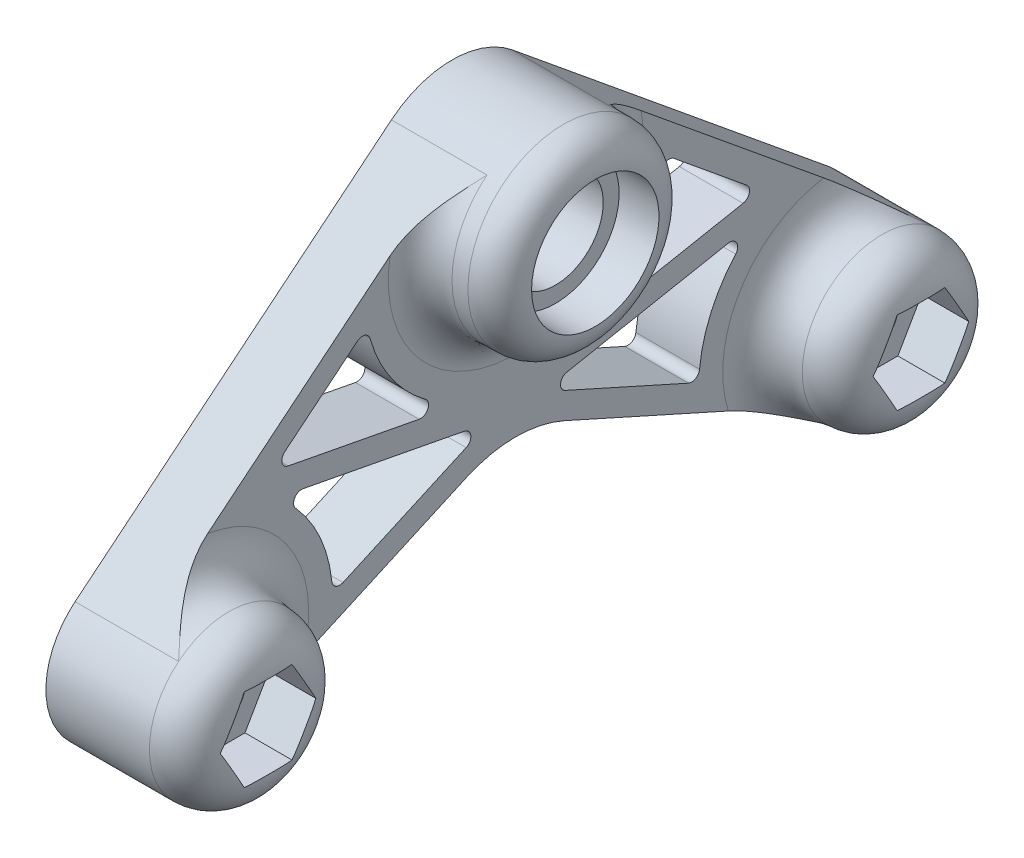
ISO-10303-21;
HEADER;
FILE_DESCRIPTION(('STEP AP214'),'2;1');
FILE_NAME('part.step','',(''),(''),'','','');
FILE_SCHEMA(('AUTOMOTIVE_DESIGN { 1 0 10303 214 1 1 1 1 }'));
ENDSEC;
DATA;
#1=APPLICATION_CONTEXT('core data for automotive mechanical design processes');
#2=APPLICATION_PROTOCOL_DEFINITION('international standard','automotive_design',2000,#1);
#3=PRODUCT_CONTEXT('',#1,'mechanical');
#4=PRODUCT('Part','Part','',(#3));
#5=PRODUCT_RELATED_PRODUCT_CATEGORY('part','',(#4));
#6=PRODUCT_DEFINITION_FORMATION('','',#4);
#7=PRODUCT_DEFINITION_CONTEXT('part definition',#1,'design');
#8=PRODUCT_DEFINITION('design','',#6,#7);
#9=PRODUCT_DEFINITION_SHAPE('','',#8);
#10=(LENGTH_UNIT() NAMED_UNIT(*) SI_UNIT(.MILLI.,.METRE.));
#11=(NAMED_UNIT(*) PLANE_ANGLE_UNIT() SI_UNIT($,.RADIAN.));
#12=(NAMED_UNIT(*) SI_UNIT($,.STERADIAN.) SOLID_ANGLE_UNIT());
#13=UNCERTAINTY_MEASURE_WITH_UNIT(LENGTH_MEASURE(1.E-05),#10,'distance_accuracy_value','');
#14=(GEOMETRIC_REPRESENTATION_CONTEXT(3) GLOBAL_UNCERTAINTY_ASSIGNED_CONTEXT((#13)) GLOBAL_UNIT_ASSIGNED_CONTEXT((#10,
#11,#12)) REPRESENTATION_CONTEXT('',''));
#15=CARTESIAN_POINT('',(0.,0.,0.));
#16=DIRECTION('',(0.,0.,1.));
#17=DIRECTION('',(1.,0.,0.));
#18=AXIS2_PLACEMENT_3D('',#15,#16,#17);
#19=CARTESIAN_POINT('',(0.,-31.,-41.));
#20=DIRECTION('',(-1.,0.,0.));
#21=DIRECTION('',(0.,0.,-1.));
#22=AXIS2_PLACEMENT_3D('',#19,#20,#21);
#23=CYLINDRICAL_SURFACE('',#22,3.00000000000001);
#24=CARTESIAN_POINT('',(10.,-31.,-41.));
#25=DIRECTION('',(1.,0.,0.));
#26=DIRECTION('',(0.,0.,-1.));
#27=AXIS2_PLACEMENT_3D('',#24,#25,#26);
#28=CIRCLE('',#27,3.00000000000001);
#29=CARTESIAN_POINT('',(10.,-31.,-44.));
#30=VERTEX_POINT('',#29);
#31=EDGE_CURVE('E613',#30,#30,#28,.T.);
#32=ORIENTED_EDGE('',*,*,#31,.F.);
#33=EDGE_LOOP('',(#32));
#34=FACE_BOUND('',#33,.T.);
#35=CARTESIAN_POINT('',(12.,-31.,-41.));
#36=DIRECTION('',(1.,0.,0.));
#37=DIRECTION('',(0.,0.,-1.));
#38=AXIS2_PLACEMENT_3D('',#35,#36,#37);
#39=CIRCLE('',#38,3.00000000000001);
#40=CARTESIAN_POINT('',(12.,-31.,-44.));
#41=VERTEX_POINT('',#40);
#42=EDGE_CURVE('E40',#41,#41,#39,.F.);
#43=ORIENTED_EDGE('',*,*,#42,.F.);
#44=EDGE_LOOP('',(#43));
#45=FACE_BOUND('',#44,.T.);
#46=ADVANCED_FACE('F35',(#34,#45),#23,.F.);
#47=CARTESIAN_POINT('',(13.,-31.,-41.));
#48=DIRECTION('',(-1.,0.,0.));
#49=DIRECTION('',(0.,0.,1.));
#50=AXIS2_PLACEMENT_3D('',#47,#48,#49);
#51=DEGENERATE_TOROIDAL_SURFACE('',#50,4.99999999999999,5.,.T.);
#52=CARTESIAN_POINT('',(13.,-31.,-41.));
#53=DIRECTION('',(-1.,0.,0.));
#54=DIRECTION('',(0.,0.,1.));
#55=AXIS2_PLACEMENT_3D('',#52,#53,#54);
#56=CIRCLE('',#55,9.99999999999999);
#57=CARTESIAN_POINT('',(13.,-23.2641179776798,-47.3368864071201));
#58=VERTEX_POINT('',#57);
#59=CARTESIAN_POINT('',(13.,-40.1231365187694,-36.9050787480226));
#60=VERTEX_POINT('',#59);
#61=EDGE_CURVE('E685',#58,#60,#56,.T.);
#62=ORIENTED_EDGE('',*,*,#61,.F.);
#63=EDGE_CURVE('E684',#60,#58,#56,.T.);
#64=ORIENTED_EDGE('',*,*,#63,.F.);
#65=EDGE_LOOP('',(#62,#64));
#66=FACE_BOUND('',#65,.T.);
#67=CARTESIAN_POINT('',(17.9959983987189,-36.2,-41.));
#68=CARTESIAN_POINT('',(17.9960045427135,-36.2,-40.7789165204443));
#69=CARTESIAN_POINT('',(17.9954935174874,-36.2,-40.557833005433));
#70=CARTESIAN_POINT('',(17.9927744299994,-36.2,-40.1156626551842));
#71=CARTESIAN_POINT('',(17.9905662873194,-36.2,-39.8945758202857));
#72=CARTESIAN_POINT('',(17.9825225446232,-36.2,-39.4520555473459));
#73=CARTESIAN_POINT('',(17.9766803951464,-36.2,-39.2306222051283));
#74=CARTESIAN_POINT('',(17.9585808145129,-36.2,-38.7880004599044));
#75=CARTESIAN_POINT('',(17.9463237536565,-36.2,-38.5668120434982));
#76=CARTESIAN_POINT('',(17.9124580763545,-36.2,-38.1287309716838));
#77=CARTESIAN_POINT('',(17.891005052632,-36.2,-37.9118270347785));
#78=CARTESIAN_POINT('',(17.8356639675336,-36.2,-37.4796268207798));
#79=CARTESIAN_POINT('',(17.8017803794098,-36.2,-37.2643299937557));
#80=CARTESIAN_POINT('',(17.7187944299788,-36.2,-36.8374109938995));
#81=CARTESIAN_POINT('',(17.6697461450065,-36.2,-36.6257785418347));
#82=CARTESIAN_POINT('',(17.5538937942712,-36.2,-36.2074957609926));
#83=CARTESIAN_POINT('',(17.487103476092,-36.2,-36.000841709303));
#84=CARTESIAN_POINT('',(17.3557354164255,-36.2,-35.6530201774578));
#85=CARTESIAN_POINT('',(17.2959861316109,-36.2,-35.5100241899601));
#86=CARTESIAN_POINT('',(17.1658989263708,-36.2,-35.2288374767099));
#87=CARTESIAN_POINT('',(17.0955572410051,-36.2,-35.0906484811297));
#88=CARTESIAN_POINT('',(16.9437567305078,-36.2,-34.8199412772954));
#89=CARTESIAN_POINT('',(16.8622647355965,-36.2,-34.6874415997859));
#90=CARTESIAN_POINT('',(16.6882458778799,-36.2,-34.429896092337));
#91=CARTESIAN_POINT('',(16.5957203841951,-36.2,-34.304849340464));
#92=CARTESIAN_POINT('',(16.3990101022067,-36.2,-34.0626327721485));
#93=CARTESIAN_POINT('',(16.2947398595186,-36.2,-33.9455321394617));
#94=CARTESIAN_POINT('',(16.0755655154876,-36.2,-33.7217457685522));
#95=CARTESIAN_POINT('',(15.9606627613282,-36.2,-33.615058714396));
#96=CARTESIAN_POINT('',(15.7210166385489,-36.2,-33.4136005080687));
#97=CARTESIAN_POINT('',(15.5962828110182,-36.2,-33.3188180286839));
#98=CARTESIAN_POINT('',(15.3378412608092,-36.2,-33.142407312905));
#99=CARTESIAN_POINT('',(15.2041352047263,-36.2,-33.0607766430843));
#100=CARTESIAN_POINT('',(14.9476999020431,-36.2,-32.9220227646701));
#101=CARTESIAN_POINT('',(14.825954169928,-36.2,-32.863076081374));
#102=CARTESIAN_POINT('',(14.5775791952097,-36.2,-32.7565855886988));
#103=CARTESIAN_POINT('',(14.45095059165,-36.2,-32.7090402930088));
#104=CARTESIAN_POINT('',(14.1938762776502,-36.2,-32.6259371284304));
#105=CARTESIAN_POINT('',(14.0634322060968,-36.2,-32.5903741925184));
#106=CARTESIAN_POINT('',(13.7997823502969,-36.2,-32.5316461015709));
#107=CARTESIAN_POINT('',(13.6665767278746,-36.2,-32.5084802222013));
#108=CARTESIAN_POINT('',(13.4105825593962,-36.2,-32.4763394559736));
#109=CARTESIAN_POINT('',(13.2879290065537,-36.2,-32.4662798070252));
#110=CARTESIAN_POINT('',(13.0421681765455,-36.2,-32.4567754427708));
#111=CARTESIAN_POINT('',(12.9190607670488,-36.2,-32.4573341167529));
#112=CARTESIAN_POINT('',(12.6734236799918,-36.2,-32.4690665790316));
#113=CARTESIAN_POINT('',(12.5508937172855,-36.2,-32.4802344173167));
#114=CARTESIAN_POINT('',(12.3072025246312,-36.2,-32.5130659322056));
#115=CARTESIAN_POINT('',(12.1860418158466,-36.2,-32.5347334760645));
#116=CARTESIAN_POINT('',(11.9486816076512,-36.2,-32.587745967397));
#117=CARTESIAN_POINT('',(11.8324316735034,-36.2,-32.6188656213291));
#118=CARTESIAN_POINT('',(11.6028690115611,-36.2,-32.6906353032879));
#119=CARTESIAN_POINT('',(11.4895573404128,-36.2,-32.7312887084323));
#120=CARTESIAN_POINT('',(11.2666949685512,-36.2,-32.8217106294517));
#121=CARTESIAN_POINT('',(11.1571425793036,-36.2,-32.8714749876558));
#122=CARTESIAN_POINT('',(10.9423687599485,-36.2,-32.9796854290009));
#123=CARTESIAN_POINT('',(10.8371489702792,-36.2,-33.038134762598));
#124=CARTESIAN_POINT('',(10.6287302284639,-36.2,-33.1649676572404));
#125=CARTESIAN_POINT('',(10.5256747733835,-36.2,-33.2335872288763));
#126=CARTESIAN_POINT('',(10.325338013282,-36.2,-33.3788160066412));
#127=CARTESIAN_POINT('',(10.2280588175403,-36.2,-33.4554281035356));
#128=CARTESIAN_POINT('',(9.94560436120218,-36.2,-33.696270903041));
#129=CARTESIAN_POINT('',(9.7697070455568,-36.2,-33.8715727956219));
#130=CARTESIAN_POINT('',(9.43203341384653,-36.2,-34.2612260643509));
#131=CARTESIAN_POINT('',(9.27262517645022,-36.2,-34.4776072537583));
#132=CARTESIAN_POINT('',(8.98677812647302,-36.2,-34.9308998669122));
#133=CARTESIAN_POINT('',(8.86033070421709,-36.2,-35.1678059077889));
#134=CARTESIAN_POINT('',(8.66304772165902,-36.2,-35.6027084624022));
#135=CARTESIAN_POINT('',(8.58609871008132,-36.2,-35.797996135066));
#136=CARTESIAN_POINT('',(8.45005335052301,-36.2,-36.1947672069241));
#137=CARTESIAN_POINT('',(8.39096658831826,-36.2,-36.3962538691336));
#138=CARTESIAN_POINT('',(8.28863865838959,-36.2,-36.8036556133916));
#139=CARTESIAN_POINT('',(8.24543627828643,-36.2,-37.0095802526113));
#140=CARTESIAN_POINT('',(8.17265466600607,-36.2,-37.4238516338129));
#141=CARTESIAN_POINT('',(8.14308131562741,-36.2,-37.6321993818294));
#142=CARTESIAN_POINT('',(8.08171629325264,-36.2,-38.1642057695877));
#143=CARTESIAN_POINT('',(8.05752899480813,-36.2,-38.4887150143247));
#144=CARTESIAN_POINT('',(8.03311594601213,-36.2,-38.9759992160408));
#145=CARTESIAN_POINT('',(8.02695616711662,-36.2,-39.1385733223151));
#146=CARTESIAN_POINT('',(8.01740919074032,-36.2,-39.4638056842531));
#147=CARTESIAN_POINT('',(8.01402190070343,-36.2,-39.6264639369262));
#148=CARTESIAN_POINT('',(8.00899624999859,-36.2,-39.9523722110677));
#149=CARTESIAN_POINT('',(8.00736407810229,-36.2,-40.1156223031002));
#150=CARTESIAN_POINT('',(8.00512013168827,-36.2,-40.4421257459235));
#151=CARTESIAN_POINT('',(8.00450833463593,-36.2,-40.6053790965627));
#152=CARTESIAN_POINT('',(8.00391217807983,-36.2,-40.9318301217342));
#153=CARTESIAN_POINT('',(8.0039276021,-36.2,-41.0950277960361));
#154=CARTESIAN_POINT('',(8.00459685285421,-36.2,-41.4214230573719));
#155=CARTESIAN_POINT('',(8.0052506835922,-36.2,-41.5846206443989));
#156=CARTESIAN_POINT('',(8.00763792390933,-36.2,-41.9149145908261));
#157=CARTESIAN_POINT('',(8.00939678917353,-36.2,-42.0820108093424));
#158=CARTESIAN_POINT('',(8.01484206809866,-36.2,-42.4161758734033));
#159=CARTESIAN_POINT('',(8.01852850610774,-36.2,-42.5832447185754));
#160=CARTESIAN_POINT('',(8.02895531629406,-36.2,-42.9174037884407));
#161=CARTESIAN_POINT('',(8.03569755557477,-36.2,-43.0844939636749));
#162=CARTESIAN_POINT('',(8.05354210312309,-36.2,-43.4184365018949));
#163=CARTESIAN_POINT('',(8.06464464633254,-36.2,-43.5852888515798));
#164=CARTESIAN_POINT('',(8.10640313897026,-36.2,-44.0825456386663));
#165=CARTESIAN_POINT('',(8.14555057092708,-36.2,-44.4124039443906));
#166=CARTESIAN_POINT('',(8.2293513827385,-36.2,-44.9027003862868));
#167=CARTESIAN_POINT('',(8.26143906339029,-36.2,-45.0652910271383));
#168=CARTESIAN_POINT('',(8.33515429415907,-36.2,-45.3882774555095));
#169=CARTESIAN_POINT('',(8.37677883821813,-36.2,-45.5486739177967));
#170=CARTESIAN_POINT('',(8.46683012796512,-36.2,-45.8535150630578));
#171=CARTESIAN_POINT('',(8.51443522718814,-36.2,-45.9982012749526));
#172=CARTESIAN_POINT('',(8.6192752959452,-36.2,-46.2840749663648));
#173=CARTESIAN_POINT('',(8.67651084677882,-36.2,-46.4252622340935));
#174=CARTESIAN_POINT('',(8.80124574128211,-36.2,-46.70337971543));
#175=CARTESIAN_POINT('',(8.86876481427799,-36.2,-46.8403011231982));
#176=CARTESIAN_POINT('',(9.01431607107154,-36.2,-47.1084556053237));
#177=CARTESIAN_POINT('',(9.09234797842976,-36.2,-47.2396888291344));
#178=CARTESIAN_POINT('',(9.25972269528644,-36.2,-47.4962607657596));
#179=CARTESIAN_POINT('',(9.34915110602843,-36.2,-47.6215438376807));
#180=CARTESIAN_POINT('',(9.53871142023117,-36.2,-47.86373201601));
#181=CARTESIAN_POINT('',(9.63884194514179,-36.2,-47.980638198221));
#182=CARTESIAN_POINT('',(9.8494081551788,-36.2,-48.2046583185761));
#183=CARTESIAN_POINT('',(9.95983748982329,-36.2,-48.311778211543));
#184=CARTESIAN_POINT('',(10.1904559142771,-36.2,-48.5149484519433));
#185=CARTESIAN_POINT('',(10.3106440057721,-36.2,-48.6109999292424));
#186=CARTESIAN_POINT('',(10.5502733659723,-36.2,-48.7837766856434));
#187=CARTESIAN_POINT('',(10.6690510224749,-36.2,-48.8614227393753));
#188=CARTESIAN_POINT('',(10.9133486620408,-36.2,-49.0052548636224));
#189=CARTESIAN_POINT('',(11.038867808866,-36.2,-49.0714423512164));
#190=CARTESIAN_POINT('',(11.2956175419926,-36.2,-49.1915081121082));
#191=CARTESIAN_POINT('',(11.4268462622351,-36.2,-49.2453903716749));
#192=CARTESIAN_POINT('',(11.693911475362,-36.2,-49.3401636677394));
#193=CARTESIAN_POINT('',(11.8297474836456,-36.2,-49.3810560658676));
#194=CARTESIAN_POINT('',(12.0891654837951,-36.2,-49.4454329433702));
#195=CARTESIAN_POINT('',(12.2123901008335,-36.2,-49.4703657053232));
#196=CARTESIAN_POINT('',(12.4605966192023,-36.2,-49.5093354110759));
#197=CARTESIAN_POINT('',(12.5855790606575,-36.2,-49.5233689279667));
#198=CARTESIAN_POINT('',(12.8362038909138,-36.2,-49.5403660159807));
#199=CARTESIAN_POINT('',(12.9618457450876,-36.2,-49.5433374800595));
#200=CARTESIAN_POINT('',(13.2129500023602,-36.2,-49.5381990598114));
#201=CARTESIAN_POINT('',(13.3384123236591,-36.2,-49.5300851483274));
#202=CARTESIAN_POINT('',(13.5829445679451,-36.2,-49.503424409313));
#203=CARTESIAN_POINT('',(13.7020635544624,-36.2,-49.4853249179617));
#204=CARTESIAN_POINT('',(13.9384057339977,-36.2,-49.439194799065));
#205=CARTESIAN_POINT('',(14.0556282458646,-36.2,-49.411160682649));
#206=CARTESIAN_POINT('',(14.2872795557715,-36.2,-49.3454528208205));
#207=CARTESIAN_POINT('',(14.401709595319,-36.2,-49.3077834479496));
#208=CARTESIAN_POINT('',(14.6271218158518,-36.2,-49.2231487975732));
#209=CARTESIAN_POINT('',(14.7381026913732,-36.2,-49.1761800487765));
#210=CARTESIAN_POINT('',(14.9572520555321,-36.2,-49.0727485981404));
#211=CARTESIAN_POINT('',(15.065368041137,-36.2,-49.0161745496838));
#212=CARTESIAN_POINT('',(15.2766981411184,-36.2,-48.8944861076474));
#213=CARTESIAN_POINT('',(15.3799104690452,-36.2,-48.8293686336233));
#214=CARTESIAN_POINT('',(15.6812702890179,-36.2,-48.6220830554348));
#215=CARTESIAN_POINT('',(15.8713147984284,-36.2,-48.4678987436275));
#216=CARTESIAN_POINT('',(16.237255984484,-36.2,-48.1223054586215));
#217=CARTESIAN_POINT('',(16.4114915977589,-36.2,-47.9291561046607));
#218=CARTESIAN_POINT('',(16.7294379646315,-36.2,-47.5191636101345));
#219=CARTESIAN_POINT('',(16.8731348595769,-36.2,-47.302309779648));
#220=CARTESIAN_POINT('',(17.0935758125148,-36.2,-46.915111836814));
#221=CARTESIAN_POINT('',(17.1777696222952,-36.2,-46.7489163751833));
#222=CARTESIAN_POINT('',(17.3310197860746,-36.2,-46.4096168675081));
#223=CARTESIAN_POINT('',(17.4000698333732,-36.2,-46.2365099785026));
#224=CARTESIAN_POINT('',(17.5239140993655,-36.2,-45.8853568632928));
#225=CARTESIAN_POINT('',(17.5787107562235,-36.2,-45.7073114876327));
#226=CARTESIAN_POINT('',(17.6754109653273,-36.2,-45.3477236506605));
#227=CARTESIAN_POINT('',(17.7173092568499,-36.2,-45.1661797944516));
#228=CARTESIAN_POINT('',(17.8179662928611,-36.2,-44.6586421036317));
#229=CARTESIAN_POINT('',(17.8644550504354,-36.2,-44.3302290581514));
#230=CARTESIAN_POINT('',(17.9320418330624,-36.2,-43.6707409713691));
#231=CARTESIAN_POINT('',(17.9531061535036,-36.2,-43.3396629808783));
#232=CARTESIAN_POINT('',(17.9738688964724,-36.2,-42.8410266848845));
#233=CARTESIAN_POINT('',(17.9789821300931,-36.2,-42.6736410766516));
#234=CARTESIAN_POINT('',(17.986720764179,-36.2,-42.3388133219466));
#235=CARTESIAN_POINT('',(17.9893462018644,-36.2,-42.1713711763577));
#236=CARTESIAN_POINT('',(17.9931109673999,-36.2,-41.8366084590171));
#237=CARTESIAN_POINT('',(17.9942514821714,-36.2,-41.669287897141));
#238=CARTESIAN_POINT('',(17.9956928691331,-36.2,-41.3346448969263));
#239=CARTESIAN_POINT('',(17.9959937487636,-36.2,-41.1673224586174));
#240=CARTESIAN_POINT('',(17.9959983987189,-36.2,-41.));
#241=B_SPLINE_CURVE_WITH_KNOTS('',3,(#67,#68,#69,#70,#71,#72,#73,#74,#75,#76,#77,#78,#79,#80,
#81,#82,#83,#84,#85,#86,#87,#88,#89,#90,#91,#92,#93,#94,#95,#96,#97,#98,#99,#100,#101,#102,#103,
#104,#105,#106,#107,#108,#109,#110,#111,#112,#113,#114,#115,#116,#117,#118,#119,#120,#121,#122,
#123,#124,#125,#126,#127,#128,#129,#130,#131,#132,#133,#134,#135,#136,#137,#138,#139,#140,#141,
#142,#143,#144,#145,#146,#147,#148,#149,#150,#151,#152,#153,#154,#155,#156,#157,#158,#159,#160,
#161,#162,#163,#164,#165,#166,#167,#168,#169,#170,#171,#172,#173,#174,#175,#176,#177,#178,#179,
#180,#181,#182,#183,#184,#185,#186,#187,#188,#189,#190,#191,#192,#193,#194,#195,#196,#197,#198,
#199,#200,#201,#202,#203,#204,#205,#206,#207,#208,#209,#210,#211,#212,#213,#214,#215,#216,#217,
#218,#219,#220,#221,#222,#223,#224,#225,#226,#227,#228,#229,#230,#231,#232,#233,#234,#235,#236,
#237,#238,#239,#240),.UNSPECIFIED.,.T.,.F.,(4,2,2,2,2,2,2,2,2,2,2,2,2,2,2,2,2,2,2,2,2,2,2,2,2,2,
2,2,2,2,2,2,2,2,2,2,2,2,2,2,2,2,2,2,2,2,2,2,2,2,2,2,2,2,2,2,2,2,2,2,2,2,2,2,2,2,2,2,2,2,2,2,2,2,
2,2,2,2,2,2,2,2,2,2,2,2,4),(0.,0.663249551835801,1.32653053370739,1.99101040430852,
2.65545192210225,3.30906946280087,3.96245202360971,4.61353102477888,5.26410699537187,
5.72865307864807,6.19336467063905,6.65949001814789,7.12555758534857,7.59526691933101,
8.06491682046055,8.53411640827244,9.00322908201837,9.4084808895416,9.81367983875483,
10.2187072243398,10.6237109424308,10.9924574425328,11.3613216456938,11.7299790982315,
12.0987724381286,12.4593863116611,12.8201281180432,13.180705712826,13.5414185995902,
13.9124315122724,14.2835790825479,15.0255078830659,15.8287471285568,16.6317763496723,
17.2605917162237,17.8897439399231,18.5204224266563,19.151372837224,20.1268072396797,
20.6148801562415,21.1029367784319,21.5927087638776,22.0824699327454,22.5720620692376,
23.0616572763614,23.5629665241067,24.0642821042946,24.5659044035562,25.0675537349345,
26.0625994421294,26.5595461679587,27.0563364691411,27.5129759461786,27.9696429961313,
28.4271974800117,28.8847399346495,29.3459476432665,29.807096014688,30.267961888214,
30.7287806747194,31.1538960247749,31.5789587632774,32.0038836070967,32.4287638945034,
32.8054584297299,33.1822713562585,33.5588153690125,33.9354962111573,34.2965313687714,
34.6576934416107,35.0186919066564,35.3798253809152,35.7454735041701,36.1112538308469,
36.84224219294,37.6195789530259,38.3972677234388,38.9554503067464,39.5138649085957,
40.0721839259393,40.6307303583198,41.624138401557,42.6188619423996,43.1212424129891,
43.6236153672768,44.1255865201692,44.6275532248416),.UNSPECIFIED.);
#242=CARTESIAN_POINT('',(17.8980705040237,-36.2,-44.0022213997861));
#243=VERTEX_POINT('',#242);
#244=CARTESIAN_POINT('',(17.8980705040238,-36.2,-37.9977786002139));
#245=VERTEX_POINT('',#244);
#246=EDGE_CURVE('E891',#243,#245,#241,.T.);
#247=ORIENTED_EDGE('',*,*,#246,.T.);
#248=CARTESIAN_POINT('',(17.8980468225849,-36.2002,-37.9978940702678));
#249=CARTESIAN_POINT('',(17.9108391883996,-36.0921718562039,-37.9355239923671));
#250=CARTESIAN_POINT('',(17.9218103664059,-35.9839968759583,-37.8730691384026));
#251=CARTESIAN_POINT('',(17.940703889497,-35.7674715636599,-37.7480581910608));
#252=CARTESIAN_POINT('',(17.9486269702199,-35.6591212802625,-37.6855021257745));
#253=CARTESIAN_POINT('',(17.9687110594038,-35.3340783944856,-37.4978385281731));
#254=CARTESIAN_POINT('',(17.9772053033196,-35.1172221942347,-37.3726365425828));
#255=CARTESIAN_POINT('',(17.9887094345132,-34.6836748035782,-37.1223278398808));
#256=CARTESIAN_POINT('',(17.991725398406,-34.466983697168,-36.9972211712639));
#257=CARTESIAN_POINT('',(17.9953702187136,-34.0335283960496,-36.7469656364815));
#258=CARTESIAN_POINT('',(17.9959983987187,-33.8167641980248,-36.6218167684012));
#259=CARTESIAN_POINT('',(17.9959983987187,-33.3832358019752,-36.3715190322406));
#260=CARTESIAN_POINT('',(17.9953702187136,-33.1664716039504,-36.2463701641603));
#261=CARTESIAN_POINT('',(17.991725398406,-32.733016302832,-35.996114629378));
#262=CARTESIAN_POINT('',(17.9887094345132,-32.5163251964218,-35.871007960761));
#263=CARTESIAN_POINT('',(17.9772053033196,-32.0827778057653,-35.620699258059));
#264=CARTESIAN_POINT('',(17.9687110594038,-31.8659216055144,-35.4954972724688));
#265=CARTESIAN_POINT('',(17.9486269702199,-31.5408787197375,-35.3078336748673));
#266=CARTESIAN_POINT('',(17.940703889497,-31.4325284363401,-35.245277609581));
#267=CARTESIAN_POINT('',(17.9218103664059,-31.2160031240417,-35.1202666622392));
#268=CARTESIAN_POINT('',(17.9108391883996,-31.1078281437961,-35.0578118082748));
#269=CARTESIAN_POINT('',(17.8980468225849,-30.9998,-34.9954417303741));
#270=B_SPLINE_CURVE_WITH_KNOTS('',3,(#248,#249,#250,#251,#252,#253,#254,#255,#256,#257,#258,
#259,#260,#261,#262,#263,#264,#265,#266,#267,#268,#269),.UNSPECIFIED.,.F.,.F.,(4,2,2,2,2,2,2,2,
2,2,4),(0.,0.376144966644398,0.752199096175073,1.50371100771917,2.25438881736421,
3.00527926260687,3.75616970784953,4.5068475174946,5.25835942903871,5.63441355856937,
6.01055852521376),.UNSPECIFIED.);
#271=CARTESIAN_POINT('',(17.898070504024,-31.,-34.9955572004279));
#272=VERTEX_POINT('',#271);
#273=EDGE_CURVE('E11',#245,#272,#270,.T.);
#274=ORIENTED_EDGE('',*,*,#273,.T.);
#275=CARTESIAN_POINT('',(17.8980468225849,-31.0002,-34.9954417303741));
#276=CARTESIAN_POINT('',(17.9108391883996,-30.892171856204,-35.0578118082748));
#277=CARTESIAN_POINT('',(17.9218103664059,-30.7839968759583,-35.1202666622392));
#278=CARTESIAN_POINT('',(17.940703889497,-30.5674715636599,-35.245277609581));
#279=CARTESIAN_POINT('',(17.9486269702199,-30.4591212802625,-35.3078336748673));
#280=CARTESIAN_POINT('',(17.9687110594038,-30.1340783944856,-35.4954972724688));
#281=CARTESIAN_POINT('',(17.9772053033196,-29.9172221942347,-35.620699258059));
#282=CARTESIAN_POINT('',(17.9887094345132,-29.4836748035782,-35.871007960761));
#283=CARTESIAN_POINT('',(17.991725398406,-29.266983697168,-35.996114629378));
#284=CARTESIAN_POINT('',(17.9953702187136,-28.8335283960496,-36.2463701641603));
#285=CARTESIAN_POINT('',(17.9959983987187,-28.6167641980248,-36.3715190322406));
#286=CARTESIAN_POINT('',(17.9959983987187,-28.1832358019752,-36.6218167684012));
#287=CARTESIAN_POINT('',(17.9953702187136,-27.9664716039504,-36.7469656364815));
#288=CARTESIAN_POINT('',(17.991725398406,-27.533016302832,-36.9972211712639));
#289=CARTESIAN_POINT('',(17.9887094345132,-27.3163251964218,-37.1223278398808));
#290=CARTESIAN_POINT('',(17.9772053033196,-26.8827778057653,-37.3726365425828));
#291=CARTESIAN_POINT('',(17.9687110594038,-26.6659216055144,-37.4978385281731));
#292=CARTESIAN_POINT('',(17.9486269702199,-26.3408787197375,-37.6855021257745));
#293=CARTESIAN_POINT('',(17.940703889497,-26.2325284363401,-37.7480581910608));
#294=CARTESIAN_POINT('',(17.9218103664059,-26.0160031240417,-37.8730691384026));
#295=CARTESIAN_POINT('',(17.9108391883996,-25.9078281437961,-37.9355239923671));
#296=CARTESIAN_POINT('',(17.8980468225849,-25.7998,-37.9978940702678));
#297=B_SPLINE_CURVE_WITH_KNOTS('',3,(#275,#276,#277,#278,#279,#280,#281,#282,#283,#284,#285,
#286,#287,#288,#289,#290,#291,#292,#293,#294,#295,#296),.UNSPECIFIED.,.F.,.F.,(4,2,2,2,2,2,2,2,
2,2,4),(0.,0.376144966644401,0.752199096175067,1.50371100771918,2.25438881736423,
3.00527926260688,3.75616970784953,4.50684751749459,5.2583594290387,5.63441355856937,
6.01055852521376),.UNSPECIFIED.);
#298=CARTESIAN_POINT('',(17.8980705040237,-25.8,-37.9977786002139));
#299=VERTEX_POINT('',#298);
#300=EDGE_CURVE('E45',#272,#299,#297,.T.);
#301=ORIENTED_EDGE('',*,*,#300,.T.);
#302=CARTESIAN_POINT('',(17.9959983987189,-25.8,-41.));
#303=CARTESIAN_POINT('',(17.9960045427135,-25.8,-41.2210834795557));
#304=CARTESIAN_POINT('',(17.9954935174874,-25.8,-41.442166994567));
#305=CARTESIAN_POINT('',(17.9927744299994,-25.8,-41.8843373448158));
#306=CARTESIAN_POINT('',(17.9905662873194,-25.8,-42.1054241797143));
#307=CARTESIAN_POINT('',(17.9825225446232,-25.8,-42.547944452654));
#308=CARTESIAN_POINT('',(17.9766803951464,-25.8,-42.7693777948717));
#309=CARTESIAN_POINT('',(17.9585808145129,-25.8,-43.2119995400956));
#310=CARTESIAN_POINT('',(17.9463237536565,-25.8,-43.4331879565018));
#311=CARTESIAN_POINT('',(17.9124580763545,-25.8,-43.8712690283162));
#312=CARTESIAN_POINT('',(17.891005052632,-25.8,-44.0881729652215));
#313=CARTESIAN_POINT('',(17.8356639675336,-25.8,-44.5203731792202));
#314=CARTESIAN_POINT('',(17.8017803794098,-25.8,-44.7356700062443));
#315=CARTESIAN_POINT('',(17.7187944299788,-25.8,-45.1625890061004));
#316=CARTESIAN_POINT('',(17.6697461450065,-25.8,-45.3742214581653));
#317=CARTESIAN_POINT('',(17.5538937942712,-25.8,-45.7925042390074));
#318=CARTESIAN_POINT('',(17.487103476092,-25.8,-45.999158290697));
#319=CARTESIAN_POINT('',(17.3557354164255,-25.8,-46.3469798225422));
#320=CARTESIAN_POINT('',(17.2959861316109,-25.8,-46.4899758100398));
#321=CARTESIAN_POINT('',(17.1658989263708,-25.8,-46.7711625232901));
#322=CARTESIAN_POINT('',(17.0955572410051,-25.8,-46.9093515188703));
#323=CARTESIAN_POINT('',(16.9437567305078,-25.8,-47.1800587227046));
#324=CARTESIAN_POINT('',(16.8622647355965,-25.8,-47.3125584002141));
#325=CARTESIAN_POINT('',(16.6882458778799,-25.8,-47.570103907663));
#326=CARTESIAN_POINT('',(16.5957203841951,-25.8,-47.695150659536));
#327=CARTESIAN_POINT('',(16.3990101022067,-25.8,-47.9373672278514));
#328=CARTESIAN_POINT('',(16.2947398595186,-25.8,-48.0544678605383));
#329=CARTESIAN_POINT('',(16.0755655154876,-25.8,-48.2782542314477));
#330=CARTESIAN_POINT('',(15.9606627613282,-25.8,-48.384941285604));
#331=CARTESIAN_POINT('',(15.7210166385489,-25.8,-48.5863994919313));
#332=CARTESIAN_POINT('',(15.5962828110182,-25.8,-48.6811819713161));
#333=CARTESIAN_POINT('',(15.3378412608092,-25.8,-48.857592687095));
#334=CARTESIAN_POINT('',(15.2041352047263,-25.8,-48.9392233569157));
#335=CARTESIAN_POINT('',(14.9476999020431,-25.8,-49.0779772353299));
#336=CARTESIAN_POINT('',(14.825954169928,-25.8,-49.136923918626));
#337=CARTESIAN_POINT('',(14.5775791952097,-25.8,-49.2434144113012));
#338=CARTESIAN_POINT('',(14.45095059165,-25.8,-49.2909597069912));
#339=CARTESIAN_POINT('',(14.1938762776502,-25.8,-49.3740628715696));
#340=CARTESIAN_POINT('',(14.0634322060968,-25.8,-49.4096258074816));
#341=CARTESIAN_POINT('',(13.7997823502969,-25.8,-49.4683538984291));
#342=CARTESIAN_POINT('',(13.6665767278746,-25.8,-49.4915197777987));
#343=CARTESIAN_POINT('',(13.4105825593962,-25.8,-49.5236605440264));
#344=CARTESIAN_POINT('',(13.2879290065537,-25.8,-49.5337201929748));
#345=CARTESIAN_POINT('',(13.0421681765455,-25.8,-49.5432245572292));
#346=CARTESIAN_POINT('',(12.9190607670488,-25.8,-49.5426658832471));
#347=CARTESIAN_POINT('',(12.6734236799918,-25.8,-49.5309334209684));
#348=CARTESIAN_POINT('',(12.5508937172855,-25.8,-49.5197655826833));
#349=CARTESIAN_POINT('',(12.3072025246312,-25.8,-49.4869340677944));
#350=CARTESIAN_POINT('',(12.1860418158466,-25.8,-49.4652665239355));
#351=CARTESIAN_POINT('',(11.9486816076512,-25.8,-49.412254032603));
#352=CARTESIAN_POINT('',(11.8324316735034,-25.8,-49.3811343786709));
#353=CARTESIAN_POINT('',(11.6028690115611,-25.8,-49.3093646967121));
#354=CARTESIAN_POINT('',(11.4895573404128,-25.8,-49.2687112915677));
#355=CARTESIAN_POINT('',(11.2666949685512,-25.8,-49.1782893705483));
#356=CARTESIAN_POINT('',(11.1571425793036,-25.8,-49.1285250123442));
#357=CARTESIAN_POINT('',(10.9423687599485,-25.8,-49.0203145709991));
#358=CARTESIAN_POINT('',(10.8371489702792,-25.8,-48.961865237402));
#359=CARTESIAN_POINT('',(10.6287302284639,-25.8,-48.8350323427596));
#360=CARTESIAN_POINT('',(10.5256747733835,-25.8,-48.7664127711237));
#361=CARTESIAN_POINT('',(10.325338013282,-25.8,-48.6211839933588));
#362=CARTESIAN_POINT('',(10.2280588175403,-25.8,-48.5445718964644));
#363=CARTESIAN_POINT('',(9.94560436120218,-25.8,-48.303729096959));
#364=CARTESIAN_POINT('',(9.76970704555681,-25.8,-48.1284272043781));
#365=CARTESIAN_POINT('',(9.43203341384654,-25.8,-47.7387739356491));
#366=CARTESIAN_POINT('',(9.27262517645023,-25.8,-47.5223927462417));
#367=CARTESIAN_POINT('',(8.98677812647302,-25.8,-47.0691001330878));
#368=CARTESIAN_POINT('',(8.86033070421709,-25.8,-46.8321940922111));
#369=CARTESIAN_POINT('',(8.66304772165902,-25.8,-46.3972915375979));
#370=CARTESIAN_POINT('',(8.58609871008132,-25.8,-46.202003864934));
#371=CARTESIAN_POINT('',(8.45005335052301,-25.8,-45.8052327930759));
#372=CARTESIAN_POINT('',(8.39096658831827,-25.8,-45.6037461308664));
#373=CARTESIAN_POINT('',(8.2886386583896,-25.8,-45.1963443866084));
#374=CARTESIAN_POINT('',(8.24543627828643,-25.8,-44.9904197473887));
#375=CARTESIAN_POINT('',(8.17265466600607,-25.8,-44.5761483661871));
#376=CARTESIAN_POINT('',(8.14308131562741,-25.8,-44.3678006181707));
#377=CARTESIAN_POINT('',(8.08171629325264,-25.8,-43.8357942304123));
#378=CARTESIAN_POINT('',(8.05752899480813,-25.8,-43.5112849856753));
#379=CARTESIAN_POINT('',(8.03311594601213,-25.8,-43.0240007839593));
#380=CARTESIAN_POINT('',(8.02695616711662,-25.8,-42.8614266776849));
#381=CARTESIAN_POINT('',(8.01740919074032,-25.8,-42.5361943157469));
#382=CARTESIAN_POINT('',(8.01402190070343,-25.8,-42.3735360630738));
#383=CARTESIAN_POINT('',(8.00899624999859,-25.8,-42.0476277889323));
#384=CARTESIAN_POINT('',(8.0073640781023,-25.8,-41.8843776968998));
#385=CARTESIAN_POINT('',(8.00512013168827,-25.8,-41.5578742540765));
#386=CARTESIAN_POINT('',(8.00450833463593,-25.8,-41.3946209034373));
#387=CARTESIAN_POINT('',(8.00391217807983,-25.8,-41.0681698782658));
#388=CARTESIAN_POINT('',(8.0039276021,-25.8,-40.9049722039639));
#389=CARTESIAN_POINT('',(8.00459685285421,-25.8,-40.5785769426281));
#390=CARTESIAN_POINT('',(8.0052506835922,-25.8,-40.4153793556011));
#391=CARTESIAN_POINT('',(8.00763792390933,-25.8,-40.0850854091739));
#392=CARTESIAN_POINT('',(8.00939678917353,-25.8,-39.9179891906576));
#393=CARTESIAN_POINT('',(8.01484206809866,-25.8,-39.5838241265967));
#394=CARTESIAN_POINT('',(8.01852850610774,-25.8,-39.4167552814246));
#395=CARTESIAN_POINT('',(8.02895531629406,-25.8,-39.0825962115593));
#396=CARTESIAN_POINT('',(8.03569755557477,-25.8,-38.9155060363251));
#397=CARTESIAN_POINT('',(8.05354210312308,-25.8,-38.5815634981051));
#398=CARTESIAN_POINT('',(8.06464464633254,-25.8,-38.4147111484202));
#399=CARTESIAN_POINT('',(8.10640313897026,-25.8,-37.9174543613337));
#400=CARTESIAN_POINT('',(8.14555057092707,-25.8,-37.5875960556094));
#401=CARTESIAN_POINT('',(8.2293513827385,-25.8,-37.0972996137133));
#402=CARTESIAN_POINT('',(8.26143906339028,-25.8,-36.9347089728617));
#403=CARTESIAN_POINT('',(8.33515429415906,-25.8,-36.6117225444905));
#404=CARTESIAN_POINT('',(8.37677883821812,-25.8,-36.4513260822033));
#405=CARTESIAN_POINT('',(8.46683012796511,-25.8,-36.1464849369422));
#406=CARTESIAN_POINT('',(8.51443522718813,-25.8,-36.0017987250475));
#407=CARTESIAN_POINT('',(8.61927529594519,-25.8,-35.7159250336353));
#408=CARTESIAN_POINT('',(8.67651084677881,-25.8,-35.5747377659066));
#409=CARTESIAN_POINT('',(8.8012457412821,-25.8,-35.29662028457));
#410=CARTESIAN_POINT('',(8.86876481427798,-25.8,-35.1596988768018));
#411=CARTESIAN_POINT('',(9.01431607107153,-25.8,-34.8915443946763));
#412=CARTESIAN_POINT('',(9.09234797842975,-25.8,-34.7603111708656));
#413=CARTESIAN_POINT('',(9.25972269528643,-25.8,-34.5037392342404));
#414=CARTESIAN_POINT('',(9.34915110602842,-25.8,-34.3784561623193));
#415=CARTESIAN_POINT('',(9.53871142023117,-25.8,-34.13626798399));
#416=CARTESIAN_POINT('',(9.63884194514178,-25.8,-34.019361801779));
#417=CARTESIAN_POINT('',(9.84940815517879,-25.8,-33.795341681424));
#418=CARTESIAN_POINT('',(9.95983748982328,-25.8,-33.688221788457));
#419=CARTESIAN_POINT('',(10.1904559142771,-25.8,-33.4850515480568));
#420=CARTESIAN_POINT('',(10.310644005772,-25.8,-33.3890000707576));
#421=CARTESIAN_POINT('',(10.5502733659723,-25.8,-33.2162233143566));
#422=CARTESIAN_POINT('',(10.6690510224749,-25.8,-33.1385772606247));
#423=CARTESIAN_POINT('',(10.9133486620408,-25.8,-32.9947451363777));
#424=CARTESIAN_POINT('',(11.038867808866,-25.8,-32.9285576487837));
#425=CARTESIAN_POINT('',(11.2956175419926,-25.8,-32.8084918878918));
#426=CARTESIAN_POINT('',(11.4268462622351,-25.8,-32.7546096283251));
#427=CARTESIAN_POINT('',(11.693911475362,-25.8,-32.6598363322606));
#428=CARTESIAN_POINT('',(11.8297474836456,-25.8,-32.6189439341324));
#429=CARTESIAN_POINT('',(12.089165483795,-25.8,-32.5545670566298));
#430=CARTESIAN_POINT('',(12.2123901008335,-25.8,-32.5296342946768));
#431=CARTESIAN_POINT('',(12.4605966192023,-25.8,-32.4906645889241));
#432=CARTESIAN_POINT('',(12.5855790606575,-25.8,-32.4766310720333));
#433=CARTESIAN_POINT('',(12.8362038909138,-25.8,-32.4596339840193));
#434=CARTESIAN_POINT('',(12.9618457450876,-25.8,-32.4566625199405));
#435=CARTESIAN_POINT('',(13.2129500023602,-25.8,-32.4618009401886));
#436=CARTESIAN_POINT('',(13.338412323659,-25.8,-32.4699148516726));
#437=CARTESIAN_POINT('',(13.5829445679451,-25.8,-32.496575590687));
#438=CARTESIAN_POINT('',(13.7020635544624,-25.8,-32.5146750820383));
#439=CARTESIAN_POINT('',(13.9384057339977,-25.8,-32.560805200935));
#440=CARTESIAN_POINT('',(14.0556282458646,-25.8,-32.588839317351));
#441=CARTESIAN_POINT('',(14.2872795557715,-25.8,-32.6545471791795));
#442=CARTESIAN_POINT('',(14.401709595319,-25.8,-32.6922165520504));
#443=CARTESIAN_POINT('',(14.6271218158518,-25.8,-32.7768512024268));
#444=CARTESIAN_POINT('',(14.7381026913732,-25.8,-32.8238199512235));
#445=CARTESIAN_POINT('',(14.9572520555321,-25.8,-32.9272514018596));
#446=CARTESIAN_POINT('',(15.0653680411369,-25.8,-32.9838254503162));
#447=CARTESIAN_POINT('',(15.2766981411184,-25.8,-33.1055138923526));
#448=CARTESIAN_POINT('',(15.3799104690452,-25.8,-33.1706313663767));
#449=CARTESIAN_POINT('',(15.6812702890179,-25.8,-33.3779169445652));
#450=CARTESIAN_POINT('',(15.8713147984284,-25.8,-33.5321012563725));
#451=CARTESIAN_POINT('',(16.237255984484,-25.8,-33.8776945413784));
#452=CARTESIAN_POINT('',(16.4114915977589,-25.8,-34.0708438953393));
#453=CARTESIAN_POINT('',(16.7294379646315,-25.8,-34.4808363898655));
#454=CARTESIAN_POINT('',(16.8731348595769,-25.8,-34.697690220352));
#455=CARTESIAN_POINT('',(17.0935758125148,-25.8,-35.084888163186));
#456=CARTESIAN_POINT('',(17.1777696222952,-25.8,-35.2510836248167));
#457=CARTESIAN_POINT('',(17.3310197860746,-25.8,-35.5903831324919));
#458=CARTESIAN_POINT('',(17.4000698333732,-25.8,-35.7634900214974));
#459=CARTESIAN_POINT('',(17.5239140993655,-25.8,-36.1146431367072));
#460=CARTESIAN_POINT('',(17.5787107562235,-25.8,-36.2926885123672));
#461=CARTESIAN_POINT('',(17.6754109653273,-25.8,-36.6522763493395));
#462=CARTESIAN_POINT('',(17.7173092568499,-25.8,-36.8338202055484));
#463=CARTESIAN_POINT('',(17.8179662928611,-25.8,-37.3413578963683));
#464=CARTESIAN_POINT('',(17.8644550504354,-25.8,-37.6697709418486));
#465=CARTESIAN_POINT('',(17.9320418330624,-25.8,-38.3292590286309));
#466=CARTESIAN_POINT('',(17.9531061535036,-25.8,-38.6603370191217));
#467=CARTESIAN_POINT('',(17.9738688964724,-25.8,-39.1589733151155));
#468=CARTESIAN_POINT('',(17.9789821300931,-25.8,-39.3263589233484));
#469=CARTESIAN_POINT('',(17.986720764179,-25.8,-39.6611866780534));
#470=CARTESIAN_POINT('',(17.9893462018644,-25.8,-39.8286288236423));
#471=CARTESIAN_POINT('',(17.9931109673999,-25.8,-40.1633915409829));
#472=CARTESIAN_POINT('',(17.9942514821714,-25.8,-40.330712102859));
#473=CARTESIAN_POINT('',(17.9956928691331,-25.8,-40.6653551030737));
#474=CARTESIAN_POINT('',(17.9959937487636,-25.8,-40.8326775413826));
#475=CARTESIAN_POINT('',(17.9959983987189,-25.8,-41.));
#476=B_SPLINE_CURVE_WITH_KNOTS('',3,(#302,#303,#304,#305,#306,#307,#308,#309,#310,#311,#312,
#313,#314,#315,#316,#317,#318,#319,#320,#321,#322,#323,#324,#325,#326,#327,#328,#329,#330,#331,
#332,#333,#334,#335,#336,#337,#338,#339,#340,#341,#342,#343,#344,#345,#346,#347,#348,#349,#350,
#351,#352,#353,#354,#355,#356,#357,#358,#359,#360,#361,#362,#363,#364,#365,#366,#367,#368,#369,
#370,#371,#372,#373,#374,#375,#376,#377,#378,#379,#380,#381,#382,#383,#384,#385,#386,#387,#388,
#389,#390,#391,#392,#393,#394,#395,#396,#397,#398,#399,#400,#401,#402,#403,#404,#405,#406,#407,
#408,#409,#410,#411,#412,#413,#414,#415,#416,#417,#418,#419,#420,#421,#422,#423,#424,#425,#426,
#427,#428,#429,#430,#431,#432,#433,#434,#435,#436,#437,#438,#439,#440,#441,#442,#443,#444,#445,
#446,#447,#448,#449,#450,#451,#452,#453,#454,#455,#456,#457,#458,#459,#460,#461,#462,#463,#464,
#465,#466,#467,#468,#469,#470,#471,#472,#473,#474,#475),.UNSPECIFIED.,.T.,.F.,(4,2,2,2,2,2,2,2,
2,2,2,2,2,2,2,2,2,2,2,2,2,2,2,2,2,2,2,2,2,2,2,2,2,2,2,2,2,2,2,2,2,2,2,2,2,2,2,2,2,2,2,2,2,2,2,2,
2,2,2,2,2,2,2,2,2,2,2,2,2,2,2,2,2,2,2,2,2,2,2,2,2,2,2,2,2,2,4),(0.,0.663249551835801,
1.32653053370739,1.99101040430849,2.65545192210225,3.30906946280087,3.96245202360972,
4.61353102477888,5.26410699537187,5.72865307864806,6.19336467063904,6.65949001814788,
7.12555758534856,7.59526691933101,8.06491682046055,8.53411640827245,9.00322908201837,
9.4084808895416,9.81367983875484,10.2187072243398,10.6237109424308,10.9924574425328,
11.3613216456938,11.7299790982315,12.0987724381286,12.4593863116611,12.8201281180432,
13.180705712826,13.5414185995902,13.9124315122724,14.2835790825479,15.0255078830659,
15.8287471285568,16.6317763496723,17.2605917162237,17.8897439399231,18.5204224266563,
19.151372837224,20.1268072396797,20.6148801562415,21.1029367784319,21.5927087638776,
22.0824699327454,22.5720620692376,23.0616572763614,23.5629665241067,24.0642821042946,
24.5659044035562,25.0675537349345,26.0625994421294,26.5595461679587,27.0563364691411,
27.5129759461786,27.9696429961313,28.4271974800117,28.8847399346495,29.3459476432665,
29.807096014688,30.267961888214,30.7287806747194,31.1538960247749,31.5789587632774,
32.0038836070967,32.4287638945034,32.8054584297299,33.1822713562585,33.5588153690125,
33.9354962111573,34.2965313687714,34.6576934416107,35.0186919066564,35.3798253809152,
35.7454735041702,36.1112538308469,36.8422421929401,37.6195789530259,38.3972677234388,
38.9554503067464,39.5138649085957,40.0721839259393,40.6307303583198,41.624138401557,
42.6188619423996,43.1212424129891,43.6236153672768,44.1255865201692,44.6275532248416),.UNSPECIFIED.);
#477=CARTESIAN_POINT('',(17.898070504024,-25.8,-44.0022213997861));
#478=VERTEX_POINT('',#477);
#479=EDGE_CURVE('E932',#299,#478,#476,.T.);
#480=ORIENTED_EDGE('',*,*,#479,.T.);
#481=CARTESIAN_POINT('',(17.8980468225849,-25.7998,-44.0021059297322));
#482=CARTESIAN_POINT('',(17.9108391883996,-25.9078281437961,-44.0644760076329));
#483=CARTESIAN_POINT('',(17.9218103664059,-26.0160031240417,-44.1269308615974));
#484=CARTESIAN_POINT('',(17.940703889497,-26.2325284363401,-44.2519418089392));
#485=CARTESIAN_POINT('',(17.9486269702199,-26.3408787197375,-44.3144978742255));
#486=CARTESIAN_POINT('',(17.9687110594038,-26.6659216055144,-44.5021614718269));
#487=CARTESIAN_POINT('',(17.9772053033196,-26.8827778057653,-44.6273634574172));
#488=CARTESIAN_POINT('',(17.9887094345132,-27.3163251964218,-44.8776721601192));
#489=CARTESIAN_POINT('',(17.991725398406,-27.533016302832,-45.0027788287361));
#490=CARTESIAN_POINT('',(17.9953702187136,-27.9664716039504,-45.2530343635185));
#491=CARTESIAN_POINT('',(17.9959983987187,-28.1832358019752,-45.3781832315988));
#492=CARTESIAN_POINT('',(17.9959983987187,-28.6167641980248,-45.6284809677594));
#493=CARTESIAN_POINT('',(17.9953702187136,-28.8335283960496,-45.7536298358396));
#494=CARTESIAN_POINT('',(17.991725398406,-29.266983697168,-46.003885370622));
#495=CARTESIAN_POINT('',(17.9887094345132,-29.4836748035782,-46.128992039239));
#496=CARTESIAN_POINT('',(17.9772053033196,-29.9172221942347,-46.379300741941));
#497=CARTESIAN_POINT('',(17.9687110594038,-30.1340783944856,-46.5045027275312));
#498=CARTESIAN_POINT('',(17.9486269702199,-30.4591212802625,-46.6921663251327));
#499=CARTESIAN_POINT('',(17.940703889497,-30.5674715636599,-46.754722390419));
#500=CARTESIAN_POINT('',(17.9218103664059,-30.7839968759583,-46.8797333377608));
#501=CARTESIAN_POINT('',(17.9108391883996,-30.8921718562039,-46.9421881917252));
#502=CARTESIAN_POINT('',(17.8980468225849,-31.0002,-47.0045582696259));
#503=B_SPLINE_CURVE_WITH_KNOTS('',3,(#481,#482,#483,#484,#485,#486,#487,#488,#489,#490,#491,
#492,#493,#494,#495,#496,#497,#498,#499,#500,#501,#502),.UNSPECIFIED.,.F.,.F.,(4,2,2,2,2,2,2,2,
2,2,4),(0.,0.376144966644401,0.752199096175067,1.50371100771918,2.25438881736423,
3.00527926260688,3.75616970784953,4.50684751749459,5.2583594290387,5.63441355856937,
6.01055852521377),.UNSPECIFIED.);
#504=CARTESIAN_POINT('',(17.898070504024,-31.,-47.0044427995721));
#505=VERTEX_POINT('',#504);
#506=EDGE_CURVE('E897',#478,#505,#503,.T.);
#507=ORIENTED_EDGE('',*,*,#506,.T.);
#508=CARTESIAN_POINT('',(17.8980468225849,-30.9998,-47.0045582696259));
#509=CARTESIAN_POINT('',(17.9108391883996,-31.1078281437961,-46.9421881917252));
#510=CARTESIAN_POINT('',(17.9218103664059,-31.2160031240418,-46.8797333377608));
#511=CARTESIAN_POINT('',(17.940703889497,-31.4325284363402,-46.754722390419));
#512=CARTESIAN_POINT('',(17.9486269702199,-31.5408787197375,-46.6921663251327));
#513=CARTESIAN_POINT('',(17.9687110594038,-31.8659216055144,-46.5045027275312));
#514=CARTESIAN_POINT('',(17.9772053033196,-32.0827778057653,-46.379300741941));
#515=CARTESIAN_POINT('',(17.9887094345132,-32.5163251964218,-46.128992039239));
#516=CARTESIAN_POINT('',(17.991725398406,-32.733016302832,-46.003885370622));
#517=CARTESIAN_POINT('',(17.9953702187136,-33.1664716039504,-45.7536298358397));
#518=CARTESIAN_POINT('',(17.9959983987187,-33.3832358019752,-45.6284809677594));
#519=CARTESIAN_POINT('',(17.9959983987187,-33.8167641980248,-45.3781832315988));
#520=CARTESIAN_POINT('',(17.9953702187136,-34.0335283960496,-45.2530343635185));
#521=CARTESIAN_POINT('',(17.991725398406,-34.466983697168,-45.0027788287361));
#522=CARTESIAN_POINT('',(17.9887094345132,-34.6836748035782,-44.8776721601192));
#523=CARTESIAN_POINT('',(17.9772053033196,-35.1172221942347,-44.6273634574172));
#524=CARTESIAN_POINT('',(17.9687110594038,-35.3340783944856,-44.5021614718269));
#525=CARTESIAN_POINT('',(17.9486269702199,-35.6591212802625,-44.3144978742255));
#526=CARTESIAN_POINT('',(17.940703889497,-35.7674715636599,-44.2519418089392));
#527=CARTESIAN_POINT('',(17.9218103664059,-35.9839968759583,-44.1269308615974));
#528=CARTESIAN_POINT('',(17.9108391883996,-36.0921718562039,-44.0644760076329));
#529=CARTESIAN_POINT('',(17.8980468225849,-36.2002,-44.0021059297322));
#530=B_SPLINE_CURVE_WITH_KNOTS('',3,(#508,#509,#510,#511,#512,#513,#514,#515,#516,#517,#518,
#519,#520,#521,#522,#523,#524,#525,#526,#527,#528,#529),.UNSPECIFIED.,.F.,.F.,(4,2,2,2,2,2,2,2,
2,2,4),(0.,0.376144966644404,0.752199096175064,1.50371100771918,2.25438881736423,
3.00527926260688,3.75616970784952,4.50684751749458,5.25835942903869,5.63441355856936,
6.01055852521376),.UNSPECIFIED.);
#531=EDGE_CURVE('E894',#505,#243,#530,.T.);
#532=ORIENTED_EDGE('',*,*,#531,.T.);
#533=EDGE_LOOP('',(#247,#274,#301,#480,#507,#532));
#534=FACE_BOUND('',#533,.T.);
#535=ADVANCED_FACE('F765',(#66,#534),#51,.T.);
#536=CARTESIAN_POINT('',(0.,-31.,41.));
#537=DIRECTION('',(-1.,0.,0.));
#538=DIRECTION('',(0.,0.,1.));
#539=AXIS2_PLACEMENT_3D('',#536,#537,#538);
#540=CYLINDRICAL_SURFACE('',#539,3.00000000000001);
#541=CARTESIAN_POINT('',(10.,-31.,41.));
#542=DIRECTION('',(-1.,0.,0.));
#543=DIRECTION('',(0.,0.,1.));
#544=AXIS2_PLACEMENT_3D('',#541,#542,#543);
#545=CIRCLE('',#544,3.00000000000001);
#546=CARTESIAN_POINT('',(10.,-31.,44.));
#547=VERTEX_POINT('',#546);
#548=EDGE_CURVE('E619',#547,#547,#545,.T.);
#549=ORIENTED_EDGE('',*,*,#548,.T.);
#550=EDGE_LOOP('',(#549));
#551=FACE_BOUND('',#550,.T.);
#552=CARTESIAN_POINT('',(12.,-31.,41.));
#553=DIRECTION('',(1.,0.,0.));
#554=DIRECTION('',(0.,0.,-1.));
#555=AXIS2_PLACEMENT_3D('',#552,#553,#554);
#556=CIRCLE('',#555,3.00000000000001);
#557=CARTESIAN_POINT('',(12.,-31.,38.));
#558=VERTEX_POINT('',#557);
#559=EDGE_CURVE('E397',#558,#558,#556,.F.);
#560=ORIENTED_EDGE('',*,*,#559,.F.);
#561=EDGE_LOOP('',(#560));
#562=FACE_BOUND('',#561,.T.);
#563=ADVANCED_FACE('F772',(#551,#562),#540,.F.);
#564=CARTESIAN_POINT('',(8.,-31.,41.));
#565=DIRECTION('',(1.,0.,0.));
#566=DIRECTION('',(0.,0.,-1.));
#567=AXIS2_PLACEMENT_3D('',#564,#565,#566);
#568=PLANE('',#567);
#569=CARTESIAN_POINT('',(8.,-18.2738212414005,-26.8916913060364));
#570=DIRECTION('',(1.,0.,0.));
#571=DIRECTION('',(0.,0.,-1.));
#572=AXIS2_PLACEMENT_3D('',#569,#570,#571);
#573=CIRCLE('',#572,1.);
#574=CARTESIAN_POINT('',(8.,-18.943620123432,-27.6342338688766));
#575=VERTEX_POINT('',#574);
#576=CARTESIAN_POINT('',(8.,-17.291622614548,-26.7038460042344));
#577=VERTEX_POINT('',#576);
#578=EDGE_CURVE('E495',#575,#577,#573,.T.);
#579=ORIENTED_EDGE('',*,*,#578,.F.);
#580=CARTESIAN_POINT('',(8.,-31.,-41.));
#581=DIRECTION('',(1.,0.,0.));
#582=DIRECTION('',(0.,0.,-1.));
#583=AXIS2_PLACEMENT_3D('',#580,#581,#582);
#584=CIRCLE('',#583,18.);
#585=CARTESIAN_POINT('',(8.,-29.192096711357,-23.0910222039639));
#586=VERTEX_POINT('',#585);
#587=EDGE_CURVE('E484',#586,#575,#584,.F.);
#588=ORIENTED_EDGE('',*,*,#587,.F.);
#589=CARTESIAN_POINT('',(8.,-29.0916576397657,-22.096078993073));
#590=DIRECTION('',(1.,0.,0.));
#591=DIRECTION('',(0.,0.,-1.));
#592=AXIS2_PLACEMENT_3D('',#589,#590,#591);
#593=CIRCLE('',#592,1.);
#594=CARTESIAN_POINT('',(8.,-30.0039712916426,-21.6865868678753));
#595=VERTEX_POINT('',#594);
#596=EDGE_CURVE('E486',#595,#586,#593,.T.);
#597=ORIENTED_EDGE('',*,*,#596,.F.);
#598=DIRECTION('',(0.,-0.409492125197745,-0.912313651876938));
#599=VECTOR('',#598,1.);
#600=CARTESIAN_POINT('',(8.,-6.7522045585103,30.116373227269));
#601=LINE('',#600,#599);
#602=CARTESIAN_POINT('',(8.,-23.0614304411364,-6.21919590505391));
#603=VERTEX_POINT('',#602);
#604=EDGE_CURVE('E489',#603,#595,#601,.T.);
#605=ORIENTED_EDGE('',*,*,#604,.F.);
#606=CARTESIAN_POINT('',(8.,-22.1491167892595,-6.62868803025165));
#607=DIRECTION('',(1.,0.,0.));
#608=DIRECTION('',(0.,0.,-1.));
#609=AXIS2_PLACEMENT_3D('',#606,#607,#608);
#610=CIRCLE('',#609,1.);
#611=CARTESIAN_POINT('',(8.,-21.166918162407,-6.44084272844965));
#612=VERTEX_POINT('',#611);
#613=EDGE_CURVE('E491',#612,#603,#610,.T.);
#614=ORIENTED_EDGE('',*,*,#613,.F.);
#615=DIRECTION('',(0.,-0.187845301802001,0.982198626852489));
#616=VECTOR('',#615,1.);
#617=CARTESIAN_POINT('',(8.,-30.2667886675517,41.1402265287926));
#618=LINE('',#617,#616);
#619=EDGE_CURVE('E493',#577,#612,#618,.T.);
#620=ORIENTED_EDGE('',*,*,#619,.F.);
#621=EDGE_LOOP('',(#579,#588,#597,#605,#614,#620));
#622=FACE_BOUND('',#621,.T.);
#623=DIRECTION('',(0.,0.633688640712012,0.773588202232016));
#624=VECTOR('',#623,1.);
#625=CARTESIAN_POINT('',(8.,9.28305842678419,-7.60426368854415));
#626=LINE('',#625,#624);
#627=CARTESIAN_POINT('',(8.,-16.1792635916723,-38.6879073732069));
#628=VERTEX_POINT('',#627);
#629=CARTESIAN_POINT('',(8.,2.57672821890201,-15.791151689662));
#630=VERTEX_POINT('',#629);
#631=EDGE_CURVE('E640',#628,#630,#626,.T.);
#632=ORIENTED_EDGE('',*,*,#631,.T.);
#633=CARTESIAN_POINT('',(8.,0.,0.));
#634=DIRECTION('',(1.,0.,0.));
#635=DIRECTION('',(0.,0.,-1.));
#636=AXIS2_PLACEMENT_3D('',#633,#634,#635);
#637=CIRCLE('',#636,16.);
#638=CARTESIAN_POINT('',(8.,2.57672821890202,15.791151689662));
#639=VERTEX_POINT('',#638);
#640=EDGE_CURVE('E868',#630,#639,#637,.F.);
#641=ORIENTED_EDGE('',*,*,#640,.T.);
#642=DIRECTION('',(0.,-0.633688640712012,0.773588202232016));
#643=VECTOR('',#642,1.);
#644=CARTESIAN_POINT('',(8.,-23.2641179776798,47.3368864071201));
#645=LINE('',#644,#643);
#646=CARTESIAN_POINT('',(8.,-16.1792635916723,38.6879073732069));
#647=VERTEX_POINT('',#646);
#648=EDGE_CURVE('E643',#639,#647,#645,.T.);
#649=ORIENTED_EDGE('',*,*,#648,.T.);
#650=CARTESIAN_POINT('',(8.,-31.,41.));
#651=DIRECTION('',(1.,0.,0.));
#652=DIRECTION('',(0.,0.,-1.));
#653=AXIS2_PLACEMENT_3D('',#650,#651,#652);
#654=CIRCLE('',#653,15.);
#655=CARTESIAN_POINT('',(8.,-35.5448753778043,26.705102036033));
#656=VERTEX_POINT('',#655);
#657=EDGE_CURVE('E692',#647,#656,#654,.F.);
#658=ORIENTED_EDGE('',*,*,#657,.T.);
#659=DIRECTION('',(0.,0.409492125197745,-0.912313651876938));
#660=VECTOR('',#659,1.);
#661=CARTESIAN_POINT('',(8.,-26.3152952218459,6.14238187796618));
#662=LINE('',#661,#660);
#663=CARTESIAN_POINT('',(8.,-26.3152952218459,6.14238187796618));
#664=VERTEX_POINT('',#663);
#665=EDGE_CURVE('E632',#656,#664,#662,.T.);
#666=ORIENTED_EDGE('',*,*,#665,.T.);
#667=CARTESIAN_POINT('',(8.,-40.,0.));
#668=DIRECTION('',(-1.,0.,0.));
#669=DIRECTION('',(0.,0.,-1.));
#670=AXIS2_PLACEMENT_3D('',#667,#668,#669);
#671=CIRCLE('',#670,15.);
#672=CARTESIAN_POINT('',(8.,-26.3152952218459,-6.14238187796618));
#673=VERTEX_POINT('',#672);
#674=EDGE_CURVE('E634',#664,#673,#671,.T.);
#675=ORIENTED_EDGE('',*,*,#674,.T.);
#676=DIRECTION('',(0.,-0.409492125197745,-0.912313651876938));
#677=VECTOR('',#676,1.);
#678=CARTESIAN_POINT('',(8.,-26.3152952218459,-6.14238187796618));
#679=LINE('',#678,#677);
#680=CARTESIAN_POINT('',(8.,-35.5448753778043,-26.705102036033));
#681=VERTEX_POINT('',#680);
#682=EDGE_CURVE('E637',#673,#681,#679,.T.);
#683=ORIENTED_EDGE('',*,*,#682,.T.);
#684=CARTESIAN_POINT('',(8.,-31.,-41.));
#685=DIRECTION('',(1.,0.,0.));
#686=DIRECTION('',(0.,0.,-1.));
#687=AXIS2_PLACEMENT_3D('',#684,#685,#686);
#688=CIRCLE('',#687,15.);
#689=EDGE_CURVE('E695',#681,#628,#688,.F.);
#690=ORIENTED_EDGE('',*,*,#689,.T.);
#691=EDGE_LOOP('',(#632,#641,#649,#658,#666,#675,#683,#690));
#692=FACE_BOUND('',#691,.T.);
#693=CARTESIAN_POINT('',(8.,-31.,41.));
#694=DIRECTION('',(1.,0.,0.));
#695=DIRECTION('',(0.,0.,-1.));
#696=AXIS2_PLACEMENT_3D('',#693,#694,#695);
#697=CIRCLE('',#696,18.);
#698=CARTESIAN_POINT('',(8.,-29.192096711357,23.0910222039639));
#699=VERTEX_POINT('',#698);
#700=CARTESIAN_POINT('',(8.,-18.943620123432,27.6342338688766));
#701=VERTEX_POINT('',#700);
#702=EDGE_CURVE('E589',#699,#701,#697,.T.);
#703=ORIENTED_EDGE('',*,*,#702,.T.);
#704=CARTESIAN_POINT('',(8.,-18.2738212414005,26.8916913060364));
#705=DIRECTION('',(1.,0.,0.));
#706=DIRECTION('',(0.,0.,-1.));
#707=AXIS2_PLACEMENT_3D('',#704,#705,#706);
#708=CIRCLE('',#707,1.);
#709=CARTESIAN_POINT('',(8.,-17.291622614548,26.7038460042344));
#710=VERTEX_POINT('',#709);
#711=EDGE_CURVE('E592',#701,#710,#708,.F.);
#712=ORIENTED_EDGE('',*,*,#711,.T.);
#713=DIRECTION('',(0.,-0.187845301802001,-0.982198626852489));
#714=VECTOR('',#713,1.);
#715=CARTESIAN_POINT('',(8.,-15.1376740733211,37.9663331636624));
#716=LINE('',#715,#714);
#717=CARTESIAN_POINT('',(8.,-21.166918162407,6.44084272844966));
#718=VERTEX_POINT('',#717);
#719=EDGE_CURVE('E577',#710,#718,#716,.T.);
#720=ORIENTED_EDGE('',*,*,#719,.T.);
#721=CARTESIAN_POINT('',(8.,-22.1491167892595,6.62868803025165));
#722=DIRECTION('',(1.,0.,0.));
#723=DIRECTION('',(0.,0.,-1.));
#724=AXIS2_PLACEMENT_3D('',#721,#722,#723);
#725=CIRCLE('',#724,1.);
#726=CARTESIAN_POINT('',(8.,-23.0614304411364,6.21919590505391));
#727=VERTEX_POINT('',#726);
#728=EDGE_CURVE('E580',#718,#727,#725,.F.);
#729=ORIENTED_EDGE('',*,*,#728,.T.);
#730=DIRECTION('',(0.,-0.409492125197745,0.912313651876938));
#731=VECTOR('',#730,1.);
#732=CARTESIAN_POINT('',(8.,-37.3861955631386,38.1335551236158));
#733=LINE('',#732,#731);
#734=CARTESIAN_POINT('',(8.,-30.0039712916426,21.6865868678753));
#735=VERTEX_POINT('',#734);
#736=EDGE_CURVE('E583',#727,#735,#733,.T.);
#737=ORIENTED_EDGE('',*,*,#736,.T.);
#738=CARTESIAN_POINT('',(8.,-29.0916576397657,22.096078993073));
#739=DIRECTION('',(1.,0.,0.));
#740=DIRECTION('',(0.,0.,-1.));
#741=AXIS2_PLACEMENT_3D('',#738,#739,#740);
#742=CIRCLE('',#741,1.);
#743=EDGE_CURVE('E586',#735,#699,#742,.F.);
#744=ORIENTED_EDGE('',*,*,#743,.T.);
#745=EDGE_LOOP('',(#703,#712,#720,#729,#737,#744));
#746=FACE_BOUND('',#745,.T.);
#747=CARTESIAN_POINT('',(8.,0.,0.));
#748=DIRECTION('',(1.,0.,0.));
#749=DIRECTION('',(0.,0.,-1.));
#750=AXIS2_PLACEMENT_3D('',#747,#748,#749);
#751=CIRCLE('',#750,19.);
#752=CARTESIAN_POINT('',(8.,-5.15564908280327,18.2871343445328));
#753=VERTEX_POINT('',#752);
#754=CARTESIAN_POINT('',(8.,-15.2398790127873,11.3466333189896));
#755=VERTEX_POINT('',#754);
#756=EDGE_CURVE('E540',#753,#755,#751,.T.);
#757=ORIENTED_EDGE('',*,*,#756,.T.);
#758=CARTESIAN_POINT('',(8.,-16.0419779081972,11.9438245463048));
#759=DIRECTION('',(1.,0.,0.));
#760=DIRECTION('',(0.,0.,-1.));
#761=AXIS2_PLACEMENT_3D('',#758,#759,#760);
#762=CIRCLE('',#761,1.);
#763=CARTESIAN_POINT('',(8.,-17.0241765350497,12.1316698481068));
#764=VERTEX_POINT('',#763);
#765=EDGE_CURVE('E543',#755,#764,#762,.F.);
#766=ORIENTED_EDGE('',*,*,#765,.T.);
#767=DIRECTION('',(0.,0.187845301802,0.982198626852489));
#768=VECTOR('',#767,1.);
#769=CARTESIAN_POINT('',(8.,-12.1910781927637,37.4027972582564));
#770=LINE('',#769,#768);
#771=CARTESIAN_POINT('',(8.,-13.8822066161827,28.5602869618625));
#772=VERTEX_POINT('',#771);
#773=EDGE_CURVE('E528',#764,#772,#770,.T.);
#774=ORIENTED_EDGE('',*,*,#773,.T.);
#775=CARTESIAN_POINT('',(8.,-12.9000079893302,28.3724416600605));
#776=DIRECTION('',(1.,0.,0.));
#777=DIRECTION('',(0.,0.,-1.));
#778=AXIS2_PLACEMENT_3D('',#775,#776,#777);
#779=CIRCLE('',#778,0.999999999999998);
#780=CARTESIAN_POINT('',(8.,-12.1264197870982,29.0061303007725));
#781=VERTEX_POINT('',#780);
#782=EDGE_CURVE('E531',#772,#781,#779,.F.);
#783=ORIENTED_EDGE('',*,*,#782,.T.);
#784=DIRECTION('',(0.,0.633688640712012,-0.773588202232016));
#785=VECTOR('',#784,1.);
#786=CARTESIAN_POINT('',(8.,-25.5848825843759,45.4358204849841));
#787=LINE('',#786,#785);
#788=CARTESIAN_POINT('',(8.,-4.65341083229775,19.8833037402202));
#789=VERTEX_POINT('',#788);
#790=EDGE_CURVE('E534',#781,#789,#787,.T.);
#791=ORIENTED_EDGE('',*,*,#790,.T.);
#792=CARTESIAN_POINT('',(8.,-5.42699903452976,19.2496150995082));
#793=DIRECTION('',(1.,0.,0.));
#794=DIRECTION('',(0.,0.,-1.));
#795=AXIS2_PLACEMENT_3D('',#792,#793,#794);
#796=CIRCLE('',#795,0.999999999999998);
#797=EDGE_CURVE('E537',#789,#753,#796,.F.);
#798=ORIENTED_EDGE('',*,*,#797,.T.);
#799=EDGE_LOOP('',(#757,#766,#774,#783,#791,#798));
#800=FACE_BOUND('',#799,.T.);
#801=CARTESIAN_POINT('',(8.,-16.0419779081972,-11.9438245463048));
#802=DIRECTION('',(1.,0.,0.));
#803=DIRECTION('',(0.,0.,-1.));
#804=AXIS2_PLACEMENT_3D('',#801,#802,#803);
#805=CIRCLE('',#804,1.);
#806=CARTESIAN_POINT('',(8.,-15.2398790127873,-11.3466333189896));
#807=VERTEX_POINT('',#806);
#808=CARTESIAN_POINT('',(8.,-17.0241765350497,-12.1316698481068));
#809=VERTEX_POINT('',#808);
#810=EDGE_CURVE('E452',#807,#809,#805,.T.);
#811=ORIENTED_EDGE('',*,*,#810,.F.);
#812=CARTESIAN_POINT('',(8.,0.,0.));
#813=DIRECTION('',(1.,0.,0.));
#814=DIRECTION('',(0.,0.,-1.));
#815=AXIS2_PLACEMENT_3D('',#812,#813,#814);
#816=CIRCLE('',#815,19.);
#817=CARTESIAN_POINT('',(8.,-5.15564908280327,-18.2871343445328));
#818=VERTEX_POINT('',#817);
#819=EDGE_CURVE('E441',#818,#807,#816,.F.);
#820=ORIENTED_EDGE('',*,*,#819,.F.);
#821=CARTESIAN_POINT('',(8.,-5.42699903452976,-19.2496150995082));
#822=DIRECTION('',(1.,0.,0.));
#823=DIRECTION('',(0.,0.,-1.));
#824=AXIS2_PLACEMENT_3D('',#821,#822,#823);
#825=CIRCLE('',#824,0.999999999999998);
#826=CARTESIAN_POINT('',(8.,-4.65341083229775,-19.8833037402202));
#827=VERTEX_POINT('',#826);
#828=EDGE_CURVE('E443',#827,#818,#825,.T.);
#829=ORIENTED_EDGE('',*,*,#828,.F.);
#830=DIRECTION('',(0.,0.633688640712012,0.773588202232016));
#831=VECTOR('',#830,1.);
#832=CARTESIAN_POINT('',(8.,14.612670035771,3.63615345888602));
#833=LINE('',#832,#831);
#834=CARTESIAN_POINT('',(8.,-12.1264197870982,-29.0061303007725));
#835=VERTEX_POINT('',#834);
#836=EDGE_CURVE('E446',#835,#827,#833,.T.);
#837=ORIENTED_EDGE('',*,*,#836,.F.);
#838=CARTESIAN_POINT('',(8.,-12.9000079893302,-28.3724416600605));
#839=DIRECTION('',(1.,0.,0.));
#840=DIRECTION('',(0.,0.,-1.));
#841=AXIS2_PLACEMENT_3D('',#838,#839,#840);
#842=CIRCLE('',#841,0.999999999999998);
#843=CARTESIAN_POINT('',(8.,-13.8822066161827,-28.5602869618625));
#844=VERTEX_POINT('',#843);
#845=EDGE_CURVE('E448',#844,#835,#842,.T.);
#846=ORIENTED_EDGE('',*,*,#845,.F.);
#847=DIRECTION('',(0.,0.187845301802,-0.982198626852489));
#848=VECTOR('',#847,1.);
#849=CARTESIAN_POINT('',(8.,-27.3201927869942,41.7037624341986));
#850=LINE('',#849,#848);
#851=EDGE_CURVE('E450',#809,#844,#850,.T.);
#852=ORIENTED_EDGE('',*,*,#851,.F.);
#853=EDGE_LOOP('',(#811,#820,#829,#837,#846,#852));
#854=FACE_BOUND('',#853,.T.);
#855=ADVANCED_FACE('F787',(#622,#692,#746,#800,#854),#568,.T.);
#856=CARTESIAN_POINT('',(0.,-31.,41.));
#857=DIRECTION('',(1.,0.,0.));
#858=DIRECTION('',(0.,0.,-1.));
#859=AXIS2_PLACEMENT_3D('',#856,#857,#858);
#860=PLANE('',#859);
#861=CARTESIAN_POINT('',(0.,-18.2738212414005,26.8916913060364));
#862=DIRECTION('',(1.,0.,0.));
#863=DIRECTION('',(0.,0.,-1.));
#864=AXIS2_PLACEMENT_3D('',#861,#862,#863);
#865=CIRCLE('',#864,1.);
#866=CARTESIAN_POINT('',(0.,-17.291622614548,26.7038460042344));
#867=VERTEX_POINT('',#866);
#868=CARTESIAN_POINT('',(0.,-18.943620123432,27.6342338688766));
#869=VERTEX_POINT('',#868);
#870=EDGE_CURVE('E546',#867,#869,#865,.T.);
#871=ORIENTED_EDGE('',*,*,#870,.T.);
#872=CARTESIAN_POINT('',(0.,-31.,41.));
#873=DIRECTION('',(-1.,0.,0.));
#874=DIRECTION('',(0.,0.,1.));
#875=AXIS2_PLACEMENT_3D('',#872,#873,#874);
#876=CIRCLE('',#875,18.);
#877=CARTESIAN_POINT('',(0.,-29.192096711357,23.0910222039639));
#878=VERTEX_POINT('',#877);
#879=EDGE_CURVE('E549',#869,#878,#876,.T.);
#880=ORIENTED_EDGE('',*,*,#879,.T.);
#881=CARTESIAN_POINT('',(0.,-29.0916576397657,22.096078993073));
#882=DIRECTION('',(1.,0.,0.));
#883=DIRECTION('',(0.,0.,1.));
#884=AXIS2_PLACEMENT_3D('',#881,#882,#883);
#885=CIRCLE('',#884,1.);
#886=CARTESIAN_POINT('',(0.,-30.0039712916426,21.6865868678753));
#887=VERTEX_POINT('',#886);
#888=EDGE_CURVE('E552',#878,#887,#885,.T.);
#889=ORIENTED_EDGE('',*,*,#888,.T.);
#890=DIRECTION('',(0.,0.409492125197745,-0.912313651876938));
#891=VECTOR('',#890,1.);
#892=CARTESIAN_POINT('',(0.,-23.0614304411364,6.21919590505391));
#893=LINE('',#892,#891);
#894=CARTESIAN_POINT('',(0.,-23.0614304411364,6.21919590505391));
#895=VERTEX_POINT('',#894);
#896=EDGE_CURVE('E555',#887,#895,#893,.T.);
#897=ORIENTED_EDGE('',*,*,#896,.T.);
#898=CARTESIAN_POINT('',(0.,-22.1491167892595,6.62868803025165));
#899=DIRECTION('',(1.,0.,0.));
#900=DIRECTION('',(0.,0.,1.));
#901=AXIS2_PLACEMENT_3D('',#898,#899,#900);
#902=CIRCLE('',#901,1.);
#903=CARTESIAN_POINT('',(0.,-21.166918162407,6.44084272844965));
#904=VERTEX_POINT('',#903);
#905=EDGE_CURVE('E558',#895,#904,#902,.T.);
#906=ORIENTED_EDGE('',*,*,#905,.T.);
#907=DIRECTION('',(0.,0.187845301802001,0.982198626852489));
#908=VECTOR('',#907,1.);
#909=CARTESIAN_POINT('',(0.,-17.291622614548,26.7038460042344));
#910=LINE('',#909,#908);
#911=EDGE_CURVE('E561',#904,#867,#910,.T.);
#912=ORIENTED_EDGE('',*,*,#911,.T.);
#913=EDGE_LOOP('',(#871,#880,#889,#897,#906,#912));
#914=FACE_BOUND('',#913,.T.);
#915=CARTESIAN_POINT('',(0.,0.,0.));
#916=DIRECTION('',(-1.,0.,0.));
#917=DIRECTION('',(0.,0.,1.));
#918=AXIS2_PLACEMENT_3D('',#915,#916,#917);
#919=CIRCLE('',#918,8.00000000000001);
#920=CARTESIAN_POINT('',(0.,0.,8.00000000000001));
#921=VERTEX_POINT('',#920);
#922=EDGE_CURVE('E610',#921,#921,#919,.T.);
#923=ORIENTED_EDGE('',*,*,#922,.F.);
#924=EDGE_LOOP('',(#923));
#925=FACE_BOUND('',#924,.T.);
#926=CARTESIAN_POINT('',(0.,-31.,41.));
#927=DIRECTION('',(1.,0.,0.));
#928=DIRECTION('',(0.,0.,-1.));
#929=AXIS2_PLACEMENT_3D('',#926,#927,#928);
#930=CIRCLE('',#929,9.99999999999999);
#931=CARTESIAN_POINT('',(0.,-23.2641179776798,47.3368864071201));
#932=VERTEX_POINT('',#931);
#933=CARTESIAN_POINT('',(0.,-40.1231365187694,36.9050787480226));
#934=VERTEX_POINT('',#933);
#935=EDGE_CURVE('E631',#932,#934,#930,.T.);
#936=ORIENTED_EDGE('',*,*,#935,.F.);
#937=DIRECTION('',(0.,-0.633688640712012,0.773588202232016));
#938=VECTOR('',#937,1.);
#939=CARTESIAN_POINT('',(0.,-23.2641179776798,47.3368864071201));
#940=LINE('',#939,#938);
#941=CARTESIAN_POINT('',(0.,9.28305842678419,7.60426368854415));
#942=VERTEX_POINT('',#941);
#943=EDGE_CURVE('E635',#942,#932,#940,.T.);
#944=ORIENTED_EDGE('',*,*,#943,.F.);
#945=CARTESIAN_POINT('',(0.,0.,0.));
#946=DIRECTION('',(1.,0.,0.));
#947=DIRECTION('',(0.,0.,1.));
#948=AXIS2_PLACEMENT_3D('',#945,#946,#947);
#949=CIRCLE('',#948,12.);
#950=CARTESIAN_POINT('',(0.,9.28305842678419,-7.60426368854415));
#951=VERTEX_POINT('',#950);
#952=EDGE_CURVE('E658',#951,#942,#949,.T.);
#953=ORIENTED_EDGE('',*,*,#952,.F.);
#954=DIRECTION('',(0.,0.633688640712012,0.773588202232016));
#955=VECTOR('',#954,1.);
#956=CARTESIAN_POINT('',(0.,9.28305842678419,-7.60426368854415));
#957=LINE('',#956,#955);
#958=CARTESIAN_POINT('',(0.,-23.2641179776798,-47.3368864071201));
#959=VERTEX_POINT('',#958);
#960=EDGE_CURVE('E656',#959,#951,#957,.T.);
#961=ORIENTED_EDGE('',*,*,#960,.F.);
#962=CARTESIAN_POINT('',(0.,-31.,-41.));
#963=DIRECTION('',(1.,0.,0.));
#964=DIRECTION('',(0.,0.,1.));
#965=AXIS2_PLACEMENT_3D('',#962,#963,#964);
#966=CIRCLE('',#965,9.99999999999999);
#967=CARTESIAN_POINT('',(0.,-40.1231365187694,-36.9050787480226));
#968=VERTEX_POINT('',#967);
#969=EDGE_CURVE('E654',#968,#959,#966,.T.);
#970=ORIENTED_EDGE('',*,*,#969,.F.);
#971=DIRECTION('',(0.,-0.409492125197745,-0.912313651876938));
#972=VECTOR('',#971,1.);
#973=CARTESIAN_POINT('',(0.,-26.3152952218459,-6.14238187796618));
#974=LINE('',#973,#972);
#975=CARTESIAN_POINT('',(0.,-26.3152952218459,-6.14238187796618));
#976=VERTEX_POINT('',#975);
#977=EDGE_CURVE('E652',#976,#968,#974,.T.);
#978=ORIENTED_EDGE('',*,*,#977,.F.);
#979=CARTESIAN_POINT('',(0.,-40.,0.));
#980=DIRECTION('',(-1.,0.,0.));
#981=DIRECTION('',(0.,0.,-1.));
#982=AXIS2_PLACEMENT_3D('',#979,#980,#981);
#983=CIRCLE('',#982,15.);
#984=CARTESIAN_POINT('',(0.,-26.3152952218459,6.14238187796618));
#985=VERTEX_POINT('',#984);
#986=EDGE_CURVE('E650',#985,#976,#983,.T.);
#987=ORIENTED_EDGE('',*,*,#986,.F.);
#988=DIRECTION('',(0.,0.409492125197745,-0.912313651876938));
#989=VECTOR('',#988,1.);
#990=CARTESIAN_POINT('',(0.,-26.3152952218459,6.14238187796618));
#991=LINE('',#990,#989);
#992=EDGE_CURVE('E648',#934,#985,#991,.T.);
#993=ORIENTED_EDGE('',*,*,#992,.F.);
#994=EDGE_LOOP('',(#936,#944,#953,#961,#970,#978,#987,#993));
#995=FACE_BOUND('',#994,.T.);
#996=CARTESIAN_POINT('',(0.,-31.,-41.));
#997=DIRECTION('',(1.,0.,0.));
#998=DIRECTION('',(0.,0.,-1.));
#999=AXIS2_PLACEMENT_3D('',#996,#997,#998);
#1000=CIRCLE('',#999,4.);
#1001=CARTESIAN_POINT('',(0.,-31.,-45.));
#1002=VERTEX_POINT('',#1001);
#1003=EDGE_CURVE('E628',#1002,#1002,#1000,.T.);
#1004=ORIENTED_EDGE('',*,*,#1003,.T.);
#1005=EDGE_LOOP('',(#1004));
#1006=FACE_BOUND('',#1005,.T.);
#1007=CARTESIAN_POINT('',(0.,-31.,41.));
#1008=DIRECTION('',(1.,0.,0.));
#1009=DIRECTION('',(0.,0.,-1.));
#1010=AXIS2_PLACEMENT_3D('',#1007,#1008,#1009);
#1011=CIRCLE('',#1010,4.00000000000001);
#1012=CARTESIAN_POINT('',(0.,-31.,37.));
#1013=VERTEX_POINT('',#1012);
#1014=EDGE_CURVE('E625',#1013,#1013,#1011,.T.);
#1015=ORIENTED_EDGE('',*,*,#1014,.T.);
#1016=EDGE_LOOP('',(#1015));
#1017=FACE_BOUND('',#1016,.T.);
#1018=CARTESIAN_POINT('',(0.,-16.0419779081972,11.9438245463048));
#1019=DIRECTION('',(1.,0.,0.));
#1020=DIRECTION('',(0.,0.,-1.));
#1021=AXIS2_PLACEMENT_3D('',#1018,#1019,#1020);
#1022=CIRCLE('',#1021,1.);
#1023=CARTESIAN_POINT('',(0.,-17.0241765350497,12.1316698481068));
#1024=VERTEX_POINT('',#1023);
#1025=CARTESIAN_POINT('',(0.,-15.2398790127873,11.3466333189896));
#1026=VERTEX_POINT('',#1025);
#1027=EDGE_CURVE('E497',#1024,#1026,#1022,.T.);
#1028=ORIENTED_EDGE('',*,*,#1027,.T.);
#1029=CARTESIAN_POINT('',(0.,0.,0.));
#1030=DIRECTION('',(-1.,0.,0.));
#1031=DIRECTION('',(0.,0.,-1.));
#1032=AXIS2_PLACEMENT_3D('',#1029,#1030,#1031);
#1033=CIRCLE('',#1032,19.);
#1034=CARTESIAN_POINT('',(0.,-5.15564908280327,18.2871343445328));
#1035=VERTEX_POINT('',#1034);
#1036=EDGE_CURVE('E500',#1026,#1035,#1033,.T.);
#1037=ORIENTED_EDGE('',*,*,#1036,.T.);
#1038=CARTESIAN_POINT('',(0.,-5.42699903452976,19.2496150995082));
#1039=DIRECTION('',(1.,0.,0.));
#1040=DIRECTION('',(0.,0.,1.));
#1041=AXIS2_PLACEMENT_3D('',#1038,#1039,#1040);
#1042=CIRCLE('',#1041,0.999999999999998);
#1043=CARTESIAN_POINT('',(0.,-4.65341083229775,19.8833037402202));
#1044=VERTEX_POINT('',#1043);
#1045=EDGE_CURVE('E503',#1035,#1044,#1042,.T.);
#1046=ORIENTED_EDGE('',*,*,#1045,.T.);
#1047=DIRECTION('',(0.,-0.633688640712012,0.773588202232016));
#1048=VECTOR('',#1047,1.);
#1049=CARTESIAN_POINT('',(0.,-12.1264197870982,29.0061303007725));
#1050=LINE('',#1049,#1048);
#1051=CARTESIAN_POINT('',(0.,-12.1264197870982,29.0061303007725));
#1052=VERTEX_POINT('',#1051);
#1053=EDGE_CURVE('E506',#1044,#1052,#1050,.T.);
#1054=ORIENTED_EDGE('',*,*,#1053,.T.);
#1055=CARTESIAN_POINT('',(0.,-12.9000079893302,28.3724416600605));
#1056=DIRECTION('',(1.,0.,0.));
#1057=DIRECTION('',(0.,0.,-1.));
#1058=AXIS2_PLACEMENT_3D('',#1055,#1056,#1057);
#1059=CIRCLE('',#1058,0.999999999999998);
#1060=CARTESIAN_POINT('',(0.,-13.8822066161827,28.5602869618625));
#1061=VERTEX_POINT('',#1060);
#1062=EDGE_CURVE('E509',#1052,#1061,#1059,.T.);
#1063=ORIENTED_EDGE('',*,*,#1062,.T.);
#1064=DIRECTION('',(0.,-0.187845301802,-0.982198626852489));
#1065=VECTOR('',#1064,1.);
#1066=CARTESIAN_POINT('',(0.,-13.8822066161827,28.5602869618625));
#1067=LINE('',#1066,#1065);
#1068=EDGE_CURVE('E512',#1061,#1024,#1067,.T.);
#1069=ORIENTED_EDGE('',*,*,#1068,.T.);
#1070=EDGE_LOOP('',(#1028,#1037,#1046,#1054,#1063,#1069));
#1071=FACE_BOUND('',#1070,.T.);
#1072=CARTESIAN_POINT('',(0.,-31.,-41.));
#1073=DIRECTION('',(1.,0.,0.));
#1074=DIRECTION('',(0.,0.,-1.));
#1075=AXIS2_PLACEMENT_3D('',#1072,#1073,#1074);
#1076=CIRCLE('',#1075,18.);
#1077=CARTESIAN_POINT('',(0.,-18.943620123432,-27.6342338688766));
#1078=VERTEX_POINT('',#1077);
#1079=CARTESIAN_POINT('',(0.,-29.192096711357,-23.0910222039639));
#1080=VERTEX_POINT('',#1079);
#1081=EDGE_CURVE('E468',#1078,#1080,#1076,.T.);
#1082=ORIENTED_EDGE('',*,*,#1081,.F.);
#1083=CARTESIAN_POINT('',(0.,-18.2738212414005,-26.8916913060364));
#1084=DIRECTION('',(-1.,0.,0.));
#1085=DIRECTION('',(0.,0.,1.));
#1086=AXIS2_PLACEMENT_3D('',#1083,#1084,#1085);
#1087=CIRCLE('',#1086,1.);
#1088=CARTESIAN_POINT('',(0.,-17.291622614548,-26.7038460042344));
#1089=VERTEX_POINT('',#1088);
#1090=EDGE_CURVE('E454',#1089,#1078,#1087,.T.);
#1091=ORIENTED_EDGE('',*,*,#1090,.F.);
#1092=DIRECTION('',(0.,0.187845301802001,-0.982198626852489));
#1093=VECTOR('',#1092,1.);
#1094=CARTESIAN_POINT('',(0.,-17.291622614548,-26.7038460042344));
#1095=LINE('',#1094,#1093);
#1096=CARTESIAN_POINT('',(0.,-21.166918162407,-6.44084272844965));
#1097=VERTEX_POINT('',#1096);
#1098=EDGE_CURVE('E456',#1097,#1089,#1095,.T.);
#1099=ORIENTED_EDGE('',*,*,#1098,.F.);
#1100=CARTESIAN_POINT('',(0.,-22.1491167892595,-6.62868803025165));
#1101=DIRECTION('',(-1.,0.,0.));
#1102=DIRECTION('',(0.,0.,-1.));
#1103=AXIS2_PLACEMENT_3D('',#1100,#1101,#1102);
#1104=CIRCLE('',#1103,1.);
#1105=CARTESIAN_POINT('',(0.,-23.0614304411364,-6.21919590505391));
#1106=VERTEX_POINT('',#1105);
#1107=EDGE_CURVE('E459',#1106,#1097,#1104,.T.);
#1108=ORIENTED_EDGE('',*,*,#1107,.F.);
#1109=DIRECTION('',(0.,0.409492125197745,0.912313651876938));
#1110=VECTOR('',#1109,1.);
#1111=CARTESIAN_POINT('',(0.,-23.0614304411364,-6.21919590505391));
#1112=LINE('',#1111,#1110);
#1113=CARTESIAN_POINT('',(0.,-30.0039712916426,-21.6865868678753));
#1114=VERTEX_POINT('',#1113);
#1115=EDGE_CURVE('E462',#1114,#1106,#1112,.T.);
#1116=ORIENTED_EDGE('',*,*,#1115,.F.);
#1117=CARTESIAN_POINT('',(0.,-29.0916576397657,-22.096078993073));
#1118=DIRECTION('',(-1.,0.,0.));
#1119=DIRECTION('',(0.,0.,-1.));
#1120=AXIS2_PLACEMENT_3D('',#1117,#1118,#1119);
#1121=CIRCLE('',#1120,1.);
#1122=EDGE_CURVE('E465',#1080,#1114,#1121,.T.);
#1123=ORIENTED_EDGE('',*,*,#1122,.F.);
#1124=EDGE_LOOP('',(#1082,#1091,#1099,#1108,#1116,#1123));
#1125=FACE_BOUND('',#1124,.T.);
#1126=CARTESIAN_POINT('',(0.,0.,0.));
#1127=DIRECTION('',(1.,0.,0.));
#1128=DIRECTION('',(0.,0.,1.));
#1129=AXIS2_PLACEMENT_3D('',#1126,#1127,#1128);
#1130=CIRCLE('',#1129,19.);
#1131=CARTESIAN_POINT('',(0.,-15.2398790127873,-11.3466333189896));
#1132=VERTEX_POINT('',#1131);
#1133=CARTESIAN_POINT('',(0.,-5.15564908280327,-18.2871343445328));
#1134=VERTEX_POINT('',#1133);
#1135=EDGE_CURVE('E425',#1132,#1134,#1130,.T.);
#1136=ORIENTED_EDGE('',*,*,#1135,.F.);
#1137=CARTESIAN_POINT('',(0.,-16.0419779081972,-11.9438245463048));
#1138=DIRECTION('',(-1.,0.,0.));
#1139=DIRECTION('',(0.,0.,1.));
#1140=AXIS2_PLACEMENT_3D('',#1137,#1138,#1139);
#1141=CIRCLE('',#1140,1.);
#1142=CARTESIAN_POINT('',(0.,-17.0241765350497,-12.1316698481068));
#1143=VERTEX_POINT('',#1142);
#1144=EDGE_CURVE('E411',#1143,#1132,#1141,.T.);
#1145=ORIENTED_EDGE('',*,*,#1144,.F.);
#1146=DIRECTION('',(0.,-0.187845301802,0.982198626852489));
#1147=VECTOR('',#1146,1.);
#1148=CARTESIAN_POINT('',(0.,-13.8822066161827,-28.5602869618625));
#1149=LINE('',#1148,#1147);
#1150=CARTESIAN_POINT('',(0.,-13.8822066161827,-28.5602869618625));
#1151=VERTEX_POINT('',#1150);
#1152=EDGE_CURVE('E413',#1151,#1143,#1149,.T.);
#1153=ORIENTED_EDGE('',*,*,#1152,.F.);
#1154=CARTESIAN_POINT('',(0.,-12.9000079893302,-28.3724416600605));
#1155=DIRECTION('',(-1.,0.,0.));
#1156=DIRECTION('',(0.,0.,1.));
#1157=AXIS2_PLACEMENT_3D('',#1154,#1155,#1156);
#1158=CIRCLE('',#1157,0.999999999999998);
#1159=CARTESIAN_POINT('',(0.,-12.1264197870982,-29.0061303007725));
#1160=VERTEX_POINT('',#1159);
#1161=EDGE_CURVE('E416',#1160,#1151,#1158,.T.);
#1162=ORIENTED_EDGE('',*,*,#1161,.F.);
#1163=DIRECTION('',(0.,-0.633688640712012,-0.773588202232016));
#1164=VECTOR('',#1163,1.);
#1165=CARTESIAN_POINT('',(0.,-12.1264197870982,-29.0061303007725));
#1166=LINE('',#1165,#1164);
#1167=CARTESIAN_POINT('',(0.,-4.65341083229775,-19.8833037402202));
#1168=VERTEX_POINT('',#1167);
#1169=EDGE_CURVE('E419',#1168,#1160,#1166,.T.);
#1170=ORIENTED_EDGE('',*,*,#1169,.F.);
#1171=CARTESIAN_POINT('',(0.,-5.42699903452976,-19.2496150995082));
#1172=DIRECTION('',(-1.,0.,0.));
#1173=DIRECTION('',(0.,0.,-1.));
#1174=AXIS2_PLACEMENT_3D('',#1171,#1172,#1173);
#1175=CIRCLE('',#1174,0.999999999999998);
#1176=EDGE_CURVE('E422',#1134,#1168,#1175,.T.);
#1177=ORIENTED_EDGE('',*,*,#1176,.F.);
#1178=EDGE_LOOP('',(#1136,#1145,#1153,#1162,#1170,#1177));
#1179=FACE_BOUND('',#1178,.T.);
#1180=ADVANCED_FACE('F803',(#914,#925,#995,#1006,#1017,#1071,#1125,#1179),#860,.F.);
#1181=CARTESIAN_POINT('',(8.,-31.,41.));
#1182=DIRECTION('',(-1.,0.,0.));
#1183=DIRECTION('',(0.,0.,1.));
#1184=AXIS2_PLACEMENT_3D('',#1181,#1182,#1183);
#1185=CYLINDRICAL_SURFACE('',#1184,9.99999999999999);
#1186=DIRECTION('',(-1.,0.,0.));
#1187=VECTOR('',#1186,1.);
#1188=CARTESIAN_POINT('',(8.,-40.1231365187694,36.9050787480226));
#1189=LINE('',#1188,#1187);
#1190=CARTESIAN_POINT('',(13.,-40.1231365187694,36.9050787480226));
#1191=VERTEX_POINT('',#1190);
#1192=EDGE_CURVE('E681',#1191,#934,#1189,.T.);
#1193=ORIENTED_EDGE('',*,*,#1192,.F.);
#1194=CARTESIAN_POINT('',(13.,-31.,41.));
#1195=DIRECTION('',(-1.,0.,0.));
#1196=DIRECTION('',(0.,0.,1.));
#1197=AXIS2_PLACEMENT_3D('',#1194,#1195,#1196);
#1198=CIRCLE('',#1197,9.99999999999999);
#1199=CARTESIAN_POINT('',(13.,-23.2641179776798,47.3368864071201));
#1200=VERTEX_POINT('',#1199);
#1201=EDGE_CURVE('E688',#1191,#1200,#1198,.T.);
#1202=ORIENTED_EDGE('',*,*,#1201,.T.);
#1203=DIRECTION('',(-1.,0.,0.));
#1204=VECTOR('',#1203,1.);
#1205=CARTESIAN_POINT('',(8.,-23.2641179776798,47.3368864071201));
#1206=LINE('',#1205,#1204);
#1207=EDGE_CURVE('E645',#1200,#932,#1206,.T.);
#1208=ORIENTED_EDGE('',*,*,#1207,.T.);
#1209=ORIENTED_EDGE('',*,*,#935,.T.);
#1210=EDGE_LOOP('',(#1193,#1202,#1208,#1209));
#1211=FACE_BOUND('',#1210,.T.);
#1212=ADVANCED_FACE('F729',(#1211),#1185,.T.);
#1213=CARTESIAN_POINT('',(8.,-26.3152952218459,6.14238187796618));
#1214=DIRECTION('',(0.,0.912313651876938,0.409492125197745));
#1215=DIRECTION('',(0.,-0.409492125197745,0.912313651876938));
#1216=AXIS2_PLACEMENT_3D('',#1213,#1214,#1215);
#1217=PLANE('',#1216);
#1218=ORIENTED_EDGE('',*,*,#992,.T.);
#1219=DIRECTION('',(-1.,0.,0.));
#1220=VECTOR('',#1219,1.);
#1221=CARTESIAN_POINT('',(8.,-26.3152952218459,6.14238187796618));
#1222=LINE('',#1221,#1220);
#1223=EDGE_CURVE('E678',#664,#985,#1222,.T.);
#1224=ORIENTED_EDGE('',*,*,#1223,.F.);
#1225=ORIENTED_EDGE('',*,*,#665,.F.);
#1226=CARTESIAN_POINT('',(8.,-35.5448753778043,26.705102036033));
#1227=CARTESIAN_POINT('',(8.00002996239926,-35.6664937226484,26.9760573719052));
#1228=CARTESIAN_POINT('',(8.01469278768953,-35.7879565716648,27.2466662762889));
#1229=CARTESIAN_POINT('',(8.07021469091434,-36.0296469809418,27.7851319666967));
#1230=CARTESIAN_POINT('',(8.11102145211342,-36.1498765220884,28.0529931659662));
#1231=CARTESIAN_POINT('',(8.26641091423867,-36.5040562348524,28.8420754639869));
#1232=CARTESIAN_POINT('',(8.41417980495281,-36.735614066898,29.357966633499));
#1233=CARTESIAN_POINT('',(8.69554811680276,-37.0864207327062,30.1395340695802));
#1234=CARTESIAN_POINT('',(8.80534043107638,-37.2091072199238,30.4128691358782));
#1235=CARTESIAN_POINT('',(9.04241229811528,-37.4516269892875,30.9531825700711));
#1236=CARTESIAN_POINT('',(9.1696911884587,-37.5714603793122,31.2201611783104));
#1237=CARTESIAN_POINT('',(9.57384989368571,-37.9270024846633,32.0122787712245));
#1238=CARTESIAN_POINT('',(9.87282431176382,-38.1584850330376,32.5280022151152));
#1239=CARTESIAN_POINT('',(10.5128801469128,-38.6139778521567,33.5428015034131));
#1240=CARTESIAN_POINT('',(10.8543182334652,-38.8379015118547,34.041684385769));
#1241=CARTESIAN_POINT('',(11.5604488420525,-39.279263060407,35.0250004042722));
#1242=CARTESIAN_POINT('',(11.9251308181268,-39.4967038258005,35.5094399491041));
#1243=CARTESIAN_POINT('',(12.5244681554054,-39.8477258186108,36.2914871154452));
#1244=CARTESIAN_POINT('',(12.756444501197,-39.9820908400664,36.5908409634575));
#1245=CARTESIAN_POINT('',(12.9923019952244,-40.1186785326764,36.8951467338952));
#1246=CARTESIAN_POINT('',(12.9961509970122,-40.120907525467,36.9001127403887));
#1247=CARTESIAN_POINT('',(13.,-40.1231365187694,36.9050787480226));
#1248=B_SPLINE_CURVE_WITH_KNOTS('',3,(#1226,#1227,#1228,#1229,#1230,#1231,#1232,#1233,#1234,
#1235,#1236,#1237,#1238,#1239,#1240,#1241,#1242,#1243,#1244,#1245,#1246,#1247),.UNSPECIFIED.,
.F.,.F.,(4,2,2,2,2,2,2,2,2,2,4),(0.,0.890035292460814,1.77829507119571,3.52501481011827,
4.48189649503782,5.43874194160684,7.35450080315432,9.28760187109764,11.2198320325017,
12.4253863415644,12.4453863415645),.UNSPECIFIED.);
#1249=EDGE_CURVE('E732',#656,#1191,#1248,.T.);
#1250=ORIENTED_EDGE('',*,*,#1249,.T.);
#1251=ORIENTED_EDGE('',*,*,#1192,.T.);
#1252=EDGE_LOOP('',(#1218,#1224,#1225,#1250,#1251));
#1253=FACE_BOUND('',#1252,.T.);
#1254=ADVANCED_FACE('F724',(#1253),#1217,.F.);
#1255=CARTESIAN_POINT('',(8.,-40.,0.));
#1256=DIRECTION('',(-1.,0.,0.));
#1257=DIRECTION('',(0.,0.,1.));
#1258=AXIS2_PLACEMENT_3D('',#1255,#1256,#1257);
#1259=CYLINDRICAL_SURFACE('',#1258,15.);
#1260=ORIENTED_EDGE('',*,*,#986,.T.);
#1261=DIRECTION('',(-1.,0.,0.));
#1262=VECTOR('',#1261,1.);
#1263=CARTESIAN_POINT('',(8.,-26.3152952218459,-6.14238187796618));
#1264=LINE('',#1263,#1262);
#1265=EDGE_CURVE('E675',#673,#976,#1264,.T.);
#1266=ORIENTED_EDGE('',*,*,#1265,.F.);
#1267=ORIENTED_EDGE('',*,*,#674,.F.);
#1268=ORIENTED_EDGE('',*,*,#1223,.T.);
#1269=EDGE_LOOP('',(#1260,#1266,#1267,#1268));
#1270=FACE_BOUND('',#1269,.T.);
#1271=ADVANCED_FACE('F720',(#1270),#1259,.F.);
#1272=CARTESIAN_POINT('',(8.,-26.3152952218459,-6.14238187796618));
#1273=DIRECTION('',(0.,0.912313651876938,-0.409492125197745));
#1274=DIRECTION('',(0.,0.409492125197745,0.912313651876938));
#1275=AXIS2_PLACEMENT_3D('',#1272,#1273,#1274);
#1276=PLANE('',#1275);
#1277=ORIENTED_EDGE('',*,*,#977,.T.);
#1278=DIRECTION('',(-1.,0.,0.));
#1279=VECTOR('',#1278,1.);
#1280=CARTESIAN_POINT('',(8.,-40.1231365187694,-36.9050787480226));
#1281=LINE('',#1280,#1279);
#1282=EDGE_CURVE('E672',#60,#968,#1281,.T.);
#1283=ORIENTED_EDGE('',*,*,#1282,.F.);
#1284=CARTESIAN_POINT('',(8.,-35.5448753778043,-26.705102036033));
#1285=CARTESIAN_POINT('',(8.00002996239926,-35.6664937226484,-26.9760573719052));
#1286=CARTESIAN_POINT('',(8.01469278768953,-35.7879565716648,-27.2466662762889));
#1287=CARTESIAN_POINT('',(8.07021469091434,-36.0296469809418,-27.7851319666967));
#1288=CARTESIAN_POINT('',(8.11102145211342,-36.1498765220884,-28.0529931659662));
#1289=CARTESIAN_POINT('',(8.26641091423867,-36.5040562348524,-28.8420754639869));
#1290=CARTESIAN_POINT('',(8.41417980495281,-36.735614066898,-29.357966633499));
#1291=CARTESIAN_POINT('',(8.69554811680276,-37.0864207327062,-30.1395340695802));
#1292=CARTESIAN_POINT('',(8.80534043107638,-37.2091072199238,-30.4128691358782));
#1293=CARTESIAN_POINT('',(9.04241229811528,-37.4516269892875,-30.9531825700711));
#1294=CARTESIAN_POINT('',(9.1696911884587,-37.5714603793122,-31.2201611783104));
#1295=CARTESIAN_POINT('',(9.57384989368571,-37.9270024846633,-32.0122787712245));
#1296=CARTESIAN_POINT('',(9.87282431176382,-38.1584850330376,-32.5280022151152));
#1297=CARTESIAN_POINT('',(10.5128801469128,-38.6139778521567,-33.5428015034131));
#1298=CARTESIAN_POINT('',(10.8543182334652,-38.8379015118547,-34.041684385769));
#1299=CARTESIAN_POINT('',(11.5604488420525,-39.279263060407,-35.0250004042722));
#1300=CARTESIAN_POINT('',(11.9251308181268,-39.4967038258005,-35.5094399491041));
#1301=CARTESIAN_POINT('',(12.5244681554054,-39.8477258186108,-36.2914871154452));
#1302=CARTESIAN_POINT('',(12.756444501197,-39.9820908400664,-36.5908409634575));
#1303=CARTESIAN_POINT('',(12.9923019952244,-40.1186785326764,-36.8951467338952));
#1304=CARTESIAN_POINT('',(12.9961509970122,-40.120907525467,-36.9001127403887));
#1305=CARTESIAN_POINT('',(13.,-40.1231365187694,-36.9050787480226));
#1306=B_SPLINE_CURVE_WITH_KNOTS('',3,(#1284,#1285,#1286,#1287,#1288,#1289,#1290,#1291,#1292,
#1293,#1294,#1295,#1296,#1297,#1298,#1299,#1300,#1301,#1302,#1303,#1304,#1305),.UNSPECIFIED.,
.F.,.F.,(4,2,2,2,2,2,2,2,2,2,4),(0.,0.890035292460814,1.77829507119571,3.52501481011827,
4.48189649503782,5.43874194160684,7.35450080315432,9.28760187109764,11.2198320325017,
12.4253863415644,12.4453863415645),.UNSPECIFIED.);
#1307=EDGE_CURVE('E697',#60,#681,#1306,.F.);
#1308=ORIENTED_EDGE('',*,*,#1307,.T.);
#1309=ORIENTED_EDGE('',*,*,#682,.F.);
#1310=ORIENTED_EDGE('',*,*,#1265,.T.);
#1311=EDGE_LOOP('',(#1277,#1283,#1308,#1309,#1310));
#1312=FACE_BOUND('',#1311,.T.);
#1313=ADVANCED_FACE('F714',(#1312),#1276,.F.);
#1314=CARTESIAN_POINT('',(8.,-31.,-41.));
#1315=DIRECTION('',(-1.,0.,0.));
#1316=DIRECTION('',(0.,0.,1.));
#1317=AXIS2_PLACEMENT_3D('',#1314,#1315,#1316);
#1318=CYLINDRICAL_SURFACE('',#1317,9.99999999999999);
#1319=ORIENTED_EDGE('',*,*,#61,.T.);
#1320=ORIENTED_EDGE('',*,*,#1282,.T.);
#1321=ORIENTED_EDGE('',*,*,#969,.T.);
#1322=DIRECTION('',(-1.,0.,0.));
#1323=VECTOR('',#1322,1.);
#1324=CARTESIAN_POINT('',(8.,-23.2641179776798,-47.3368864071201));
#1325=LINE('',#1324,#1323);
#1326=EDGE_CURVE('E669',#58,#959,#1325,.T.);
#1327=ORIENTED_EDGE('',*,*,#1326,.F.);
#1328=EDGE_LOOP('',(#1319,#1320,#1321,#1327));
#1329=FACE_BOUND('',#1328,.T.);
#1330=ADVANCED_FACE('F719',(#1329),#1318,.T.);
#1331=CARTESIAN_POINT('',(8.,9.28305842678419,-7.60426368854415));
#1332=DIRECTION('',(0.,-0.773588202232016,0.633688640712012));
#1333=DIRECTION('',(0.,-0.633688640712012,-0.773588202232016));
#1334=AXIS2_PLACEMENT_3D('',#1331,#1332,#1333);
#1335=PLANE('',#1334);
#1336=ORIENTED_EDGE('',*,*,#960,.T.);
#1337=DIRECTION('',(-1.,0.,0.));
#1338=VECTOR('',#1337,1.);
#1339=CARTESIAN_POINT('',(8.,9.28305842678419,-7.60426368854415));
#1340=LINE('',#1339,#1338);
#1341=CARTESIAN_POINT('',(12.,9.28305842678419,-7.60426368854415));
#1342=VERTEX_POINT('',#1341);
#1343=EDGE_CURVE('E666',#1342,#951,#1340,.T.);
#1344=ORIENTED_EDGE('',*,*,#1343,.F.);
#1345=CARTESIAN_POINT('',(8.,2.57672821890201,-15.791151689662));
#1346=CARTESIAN_POINT('',(8.00000520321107,2.67249152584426,-15.6742466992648));
#1347=CARTESIAN_POINT('',(8.00374609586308,2.76822986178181,-15.5573721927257));
#1348=CARTESIAN_POINT('',(8.01819010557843,2.9594636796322,-15.3239196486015));
#1349=CARTESIAN_POINT('',(8.02889074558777,3.05495923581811,-15.207341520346));
#1350=CARTESIAN_POINT('',(8.07061136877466,3.34047056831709,-14.858797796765));
#1351=CARTESIAN_POINT('',(8.11125465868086,3.52993849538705,-14.627500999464));
#1352=CARTESIAN_POINT('',(8.21381650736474,3.90366872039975,-14.1712622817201));
#1353=CARTESIAN_POINT('',(8.27542183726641,4.08796670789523,-13.946276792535));
#1354=CARTESIAN_POINT('',(8.41696060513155,4.45379775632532,-13.4996811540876));
#1355=CARTESIAN_POINT('',(8.49690468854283,4.6353291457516,-13.2780730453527));
#1356=CARTESIAN_POINT('',(8.68049258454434,5.01205103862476,-12.8181821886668));
#1357=CARTESIAN_POINT('',(8.78564843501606,5.20694314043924,-12.5802637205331));
#1358=CARTESIAN_POINT('',(9.01138122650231,5.59313192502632,-12.1088159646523));
#1359=CARTESIAN_POINT('',(9.13196259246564,5.78442755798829,-11.8752879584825));
#1360=CARTESIAN_POINT('',(9.51273301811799,6.35349527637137,-11.1805870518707));
#1361=CARTESIAN_POINT('',(9.79180664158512,6.72617449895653,-10.7256313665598));
#1362=CARTESIAN_POINT('',(10.3828140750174,7.46362212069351,-9.82537729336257));
#1363=CARTESIAN_POINT('',(10.69494925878,7.82832353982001,-9.38016067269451));
#1364=CARTESIAN_POINT('',(11.3343809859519,8.55237535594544,-8.49625979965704));
#1365=CARTESIAN_POINT('',(11.6616808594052,8.91172455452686,-8.05757701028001));
#1366=CARTESIAN_POINT('',(11.9926970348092,9.27504283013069,-7.61404888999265));
#1367=CARTESIAN_POINT('',(11.9963485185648,9.2790506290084,-7.60915628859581));
#1368=CARTESIAN_POINT('',(12.,9.28305842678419,-7.60426368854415));
#1369=B_SPLINE_CURVE_WITH_KNOTS('',3,(#1345,#1346,#1347,#1348,#1349,#1350,#1351,#1352,#1353,
#1354,#1355,#1356,#1357,#1358,#1359,#1360,#1361,#1362,#1363,#1364,#1365,#1366,#1367,#1368),
.UNSPECIFIED.,.F.,.F.,(4,2,2,2,2,2,2,2,2,2,2,4),(0.,0.453250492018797,0.90633975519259,
1.81050164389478,2.701706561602,3.59343012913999,4.56802337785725,5.54289682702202,
7.49400233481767,9.45776156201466,11.4219540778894,11.4438629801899),.UNSPECIFIED.);
#1370=EDGE_CURVE('E821',#1342,#630,#1369,.F.);
#1371=ORIENTED_EDGE('',*,*,#1370,.T.);
#1372=ORIENTED_EDGE('',*,*,#631,.F.);
#1373=CARTESIAN_POINT('',(8.,-16.1792635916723,-38.6879073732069));
#1374=CARTESIAN_POINT('',(8.00002996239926,-16.3674678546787,-38.917661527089));
#1375=CARTESIAN_POINT('',(8.01469278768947,-16.5554314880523,-39.1471219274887));
#1376=CARTESIAN_POINT('',(8.07021469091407,-16.9294471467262,-39.6037090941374));
#1377=CARTESIAN_POINT('',(8.11102145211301,-17.1155022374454,-39.8308396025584));
#1378=CARTESIAN_POINT('',(8.26641091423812,-17.6635949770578,-40.4999348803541));
#1379=CARTESIAN_POINT('',(8.41417980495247,-18.0219304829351,-40.9373801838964));
#1380=CARTESIAN_POINT('',(8.69554811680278,-18.5648034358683,-41.6001033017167));
#1381=CARTESIAN_POINT('',(8.80534043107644,-18.7546606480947,-41.8318753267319));
#1382=CARTESIAN_POINT('',(9.04241229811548,-19.1299597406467,-42.2900292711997));
#1383=CARTESIAN_POINT('',(9.169691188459,-19.3154017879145,-42.5164113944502));
#1384=CARTESIAN_POINT('',(9.57384989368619,-19.8656028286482,-43.188080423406));
#1385=CARTESIAN_POINT('',(9.87282431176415,-20.2238218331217,-43.6253835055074));
#1386=CARTESIAN_POINT('',(10.5128801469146,-20.9286965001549,-44.4858734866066));
#1387=CARTESIAN_POINT('',(10.8543182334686,-21.2752181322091,-44.9088967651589));
#1388=CARTESIAN_POINT('',(11.5604488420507,-21.9582246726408,-45.742690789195));
#1389=CARTESIAN_POINT('',(11.9251308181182,-22.2947140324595,-46.1534669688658));
#1390=CARTESIAN_POINT('',(12.5244681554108,-22.8379202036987,-46.8165968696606));
#1391=CARTESIAN_POINT('',(12.7564445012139,-23.0458499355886,-47.0704312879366));
#1392=CARTESIAN_POINT('',(12.992301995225,-23.2572192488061,-47.3284646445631));
#1393=CARTESIAN_POINT('',(12.9961509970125,-23.2606686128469,-47.3326755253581));
#1394=CARTESIAN_POINT('',(13.,-23.2641179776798,-47.3368864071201));
#1395=B_SPLINE_CURVE_WITH_KNOTS('',3,(#1373,#1374,#1375,#1376,#1377,#1378,#1379,#1380,#1381,
#1382,#1383,#1384,#1385,#1386,#1387,#1388,#1389,#1390,#1391,#1392,#1393,#1394),.UNSPECIFIED.,
.F.,.F.,(4,2,2,2,2,2,2,2,2,2,4),(0.,0.890035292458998,1.77829507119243,3.52501481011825,
4.48189649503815,5.43874194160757,7.35450080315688,9.2876018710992,11.2198320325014,
12.4253863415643,12.4453863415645),.UNSPECIFIED.);
#1396=EDGE_CURVE('E704',#628,#58,#1395,.T.);
#1397=ORIENTED_EDGE('',*,*,#1396,.T.);
#1398=ORIENTED_EDGE('',*,*,#1326,.T.);
#1399=EDGE_LOOP('',(#1336,#1344,#1371,#1372,#1397,#1398));
#1400=FACE_BOUND('',#1399,.T.);
#1401=ADVANCED_FACE('F834',(#1400),#1335,.F.);
#1402=CARTESIAN_POINT('',(8.,0.,0.));
#1403=DIRECTION('',(-1.,0.,0.));
#1404=DIRECTION('',(0.,0.,1.));
#1405=AXIS2_PLACEMENT_3D('',#1402,#1403,#1404);
#1406=CYLINDRICAL_SURFACE('',#1405,12.);
#1407=CARTESIAN_POINT('',(14.,0.,0.));
#1408=DIRECTION('',(-1.,0.,0.));
#1409=DIRECTION('',(0.,0.,1.));
#1410=AXIS2_PLACEMENT_3D('',#1407,#1408,#1409);
#1411=CIRCLE('',#1410,12.);
#1412=CARTESIAN_POINT('',(14.,0.,12.));
#1413=VERTEX_POINT('',#1412);
#1414=EDGE_CURVE('E866',#1413,#1413,#1411,.T.);
#1415=ORIENTED_EDGE('',*,*,#1414,.T.);
#1416=EDGE_LOOP('',(#1415));
#1417=FACE_BOUND('',#1416,.T.);
#1418=DIRECTION('',(-1.,0.,0.));
#1419=VECTOR('',#1418,1.);
#1420=CARTESIAN_POINT('',(8.,9.28305842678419,7.60426368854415));
#1421=LINE('',#1420,#1419);
#1422=CARTESIAN_POINT('',(12.,9.28305842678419,7.60426368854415));
#1423=VERTEX_POINT('',#1422);
#1424=EDGE_CURVE('E663',#1423,#942,#1421,.T.);
#1425=ORIENTED_EDGE('',*,*,#1424,.F.);
#1426=CARTESIAN_POINT('',(12.,0.,0.));
#1427=DIRECTION('',(1.,0.,0.));
#1428=DIRECTION('',(0.,0.,-1.));
#1429=AXIS2_PLACEMENT_3D('',#1426,#1427,#1428);
#1430=CIRCLE('',#1429,12.);
#1431=EDGE_CURVE('E822',#1423,#1342,#1430,.T.);
#1432=ORIENTED_EDGE('',*,*,#1431,.T.);
#1433=ORIENTED_EDGE('',*,*,#1343,.T.);
#1434=ORIENTED_EDGE('',*,*,#952,.T.);
#1435=EDGE_LOOP('',(#1425,#1432,#1433,#1434));
#1436=FACE_BOUND('',#1435,.T.);
#1437=ADVANCED_FACE('F810',(#1417,#1436),#1406,.T.);
#1438=CARTESIAN_POINT('',(8.,-23.2641179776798,47.3368864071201));
#1439=DIRECTION('',(0.,-0.773588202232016,-0.633688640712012));
#1440=DIRECTION('',(0.,0.633688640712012,-0.773588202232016));
#1441=AXIS2_PLACEMENT_3D('',#1438,#1439,#1440);
#1442=PLANE('',#1441);
#1443=ORIENTED_EDGE('',*,*,#943,.T.);
#1444=ORIENTED_EDGE('',*,*,#1207,.F.);
#1445=CARTESIAN_POINT('',(8.,-16.1792635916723,38.6879073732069));
#1446=CARTESIAN_POINT('',(8.00002996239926,-16.367467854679,38.9176615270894));
#1447=CARTESIAN_POINT('',(8.01469278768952,-16.5554314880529,39.1471219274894));
#1448=CARTESIAN_POINT('',(8.07021469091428,-16.9294471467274,39.6037090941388));
#1449=CARTESIAN_POINT('',(8.11102145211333,-17.1155022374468,39.8308396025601));
#1450=CARTESIAN_POINT('',(8.26641091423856,-17.6635949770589,40.4999348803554));
#1451=CARTESIAN_POINT('',(8.41417980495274,-18.0219304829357,40.937380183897));
#1452=CARTESIAN_POINT('',(8.69554811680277,-18.5648034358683,41.6001033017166));
#1453=CARTESIAN_POINT('',(8.80534043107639,-18.7546606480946,41.8318753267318));
#1454=CARTESIAN_POINT('',(9.04241229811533,-19.1299597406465,42.2900292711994));
#1455=CARTESIAN_POINT('',(9.16969118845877,-19.3154017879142,42.5164113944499));
#1456=CARTESIAN_POINT('',(9.57384989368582,-19.8656028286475,43.1880804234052));
#1457=CARTESIAN_POINT('',(9.8728243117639,-20.2238218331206,43.625383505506));
#1458=CARTESIAN_POINT('',(10.5128801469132,-20.9286965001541,44.4858734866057));
#1459=CARTESIAN_POINT('',(10.8543182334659,-21.2752181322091,44.9088967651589));
#1460=CARTESIAN_POINT('',(11.5604488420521,-21.9582246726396,45.7426907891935));
#1461=CARTESIAN_POINT('',(11.9251308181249,-22.2947140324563,46.1534669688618));
#1462=CARTESIAN_POINT('',(12.5244681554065,-22.8379202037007,46.8165968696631));
#1463=CARTESIAN_POINT('',(12.7564445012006,-23.0458499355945,47.070431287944));
#1464=CARTESIAN_POINT('',(12.9923019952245,-23.2572192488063,47.3284646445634));
#1465=CARTESIAN_POINT('',(12.9961509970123,-23.260668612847,47.3326755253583));
#1466=CARTESIAN_POINT('',(13.,-23.2641179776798,47.3368864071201));
#1467=B_SPLINE_CURVE_WITH_KNOTS('',3,(#1445,#1446,#1447,#1448,#1449,#1450,#1451,#1452,#1453,
#1454,#1455,#1456,#1457,#1458,#1459,#1460,#1461,#1462,#1463,#1464,#1465,#1466),.UNSPECIFIED.,
.F.,.F.,(4,2,2,2,2,2,2,2,2,2,4),(0.,0.890035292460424,1.77829507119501,3.52501481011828,
4.4818964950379,5.438741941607,7.35450080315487,9.28760187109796,11.2198320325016,
12.4253863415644,12.4453863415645),.UNSPECIFIED.);
#1468=EDGE_CURVE('E738',#1200,#647,#1467,.F.);
#1469=ORIENTED_EDGE('',*,*,#1468,.T.);
#1470=ORIENTED_EDGE('',*,*,#648,.F.);
#1471=CARTESIAN_POINT('',(8.,2.57672821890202,15.791151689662));
#1472=CARTESIAN_POINT('',(8.00000520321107,2.6724915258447,15.6742466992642));
#1473=CARTESIAN_POINT('',(8.00374609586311,2.76822986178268,15.5573721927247));
#1474=CARTESIAN_POINT('',(8.01819010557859,2.95946367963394,15.3239196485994));
#1475=CARTESIAN_POINT('',(8.02889074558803,3.05495923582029,15.2073415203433));
#1476=CARTESIAN_POINT('',(8.07061136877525,3.34047056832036,14.858797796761));
#1477=CARTESIAN_POINT('',(8.11125465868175,3.52993849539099,14.6275009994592));
#1478=CARTESIAN_POINT('',(8.21381650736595,3.9036687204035,14.1712622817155));
#1479=CARTESIAN_POINT('',(8.27542183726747,4.08796670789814,13.9462767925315));
#1480=CARTESIAN_POINT('',(8.41696060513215,4.4537977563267,13.4996811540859));
#1481=CARTESIAN_POINT('',(8.49690468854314,4.63532914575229,13.2780730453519));
#1482=CARTESIAN_POINT('',(8.68049258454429,5.01205103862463,12.8181821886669));
#1483=CARTESIAN_POINT('',(8.78564843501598,5.20694314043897,12.5802637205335));
#1484=CARTESIAN_POINT('',(9.01138122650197,5.59313192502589,12.1088159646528));
#1485=CARTESIAN_POINT('',(9.13196259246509,5.78442755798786,11.875287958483));
#1486=CARTESIAN_POINT('',(9.5127330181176,6.35349527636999,11.1805870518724));
#1487=CARTESIAN_POINT('',(9.7918066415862,6.7261744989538,10.7256313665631));
#1488=CARTESIAN_POINT('',(10.3828140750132,7.46362212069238,9.82537729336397));
#1489=CARTESIAN_POINT('',(10.6949492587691,7.82832353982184,9.38016067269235));
#1490=CARTESIAN_POINT('',(11.3343809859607,8.55237535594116,8.49625979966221));
#1491=CARTESIAN_POINT('',(11.6616808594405,8.91172455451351,8.05757701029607));
#1492=CARTESIAN_POINT('',(11.9926970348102,9.27504283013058,7.61404888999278));
#1493=CARTESIAN_POINT('',(11.9963485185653,9.27905062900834,7.60915628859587));
#1494=CARTESIAN_POINT('',(12.,9.28305842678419,7.60426368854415));
#1495=B_SPLINE_CURVE_WITH_KNOTS('',3,(#1471,#1472,#1473,#1474,#1475,#1476,#1477,#1478,#1479,
#1480,#1481,#1482,#1483,#1484,#1485,#1486,#1487,#1488,#1489,#1490,#1491,#1492,#1493,#1494),
.UNSPECIFIED.,.F.,.F.,(4,2,2,2,2,2,2,2,2,2,2,4),(0.,0.453250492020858,0.906339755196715,
1.81050164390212,2.70170656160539,3.59343012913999,4.56802337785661,5.54289682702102,
7.49400233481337,9.45776156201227,11.4219540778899,11.4438629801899),.UNSPECIFIED.);
#1496=EDGE_CURVE('E814',#639,#1423,#1495,.T.);
#1497=ORIENTED_EDGE('',*,*,#1496,.T.);
#1498=ORIENTED_EDGE('',*,*,#1424,.T.);
#1499=EDGE_LOOP('',(#1443,#1444,#1469,#1470,#1497,#1498));
#1500=FACE_BOUND('',#1499,.T.);
#1501=ADVANCED_FACE('F799',(#1500),#1442,.F.);
#1502=CARTESIAN_POINT('',(8.,-31.,-41.));
#1503=DIRECTION('',(-1.,0.,0.));
#1504=DIRECTION('',(0.,0.,1.));
#1505=AXIS2_PLACEMENT_3D('',#1502,#1503,#1504);
#1506=CYLINDRICAL_SURFACE('',#1505,4.);
#1507=ORIENTED_EDGE('',*,*,#1003,.F.);
#1508=EDGE_LOOP('',(#1507));
#1509=FACE_BOUND('',#1508,.T.);
#1510=CARTESIAN_POINT('',(10.,-31.,-41.));
#1511=DIRECTION('',(1.,0.,0.));
#1512=DIRECTION('',(0.,0.,-1.));
#1513=AXIS2_PLACEMENT_3D('',#1510,#1511,#1512);
#1514=CIRCLE('',#1513,4.00000000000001);
#1515=CARTESIAN_POINT('',(10.,-31.,-45.));
#1516=VERTEX_POINT('',#1515);
#1517=EDGE_CURVE('E616',#1516,#1516,#1514,.T.);
#1518=ORIENTED_EDGE('',*,*,#1517,.T.);
#1519=EDGE_LOOP('',(#1518));
#1520=FACE_BOUND('',#1519,.T.);
#1521=ADVANCED_FACE('F795',(#1509,#1520),#1506,.F.);
#1522=CARTESIAN_POINT('',(8.,-31.,41.));
#1523=DIRECTION('',(-1.,0.,0.));
#1524=DIRECTION('',(0.,0.,1.));
#1525=AXIS2_PLACEMENT_3D('',#1522,#1523,#1524);
#1526=CYLINDRICAL_SURFACE('',#1525,4.00000000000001);
#1527=ORIENTED_EDGE('',*,*,#1014,.F.);
#1528=EDGE_LOOP('',(#1527));
#1529=FACE_BOUND('',#1528,.T.);
#1530=CARTESIAN_POINT('',(10.,-31.,41.));
#1531=DIRECTION('',(-1.,0.,0.));
#1532=DIRECTION('',(0.,0.,1.));
#1533=AXIS2_PLACEMENT_3D('',#1530,#1531,#1532);
#1534=CIRCLE('',#1533,4.00000000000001);
#1535=CARTESIAN_POINT('',(10.,-31.,45.));
#1536=VERTEX_POINT('',#1535);
#1537=EDGE_CURVE('E622',#1536,#1536,#1534,.T.);
#1538=ORIENTED_EDGE('',*,*,#1537,.F.);
#1539=EDGE_LOOP('',(#1538));
#1540=FACE_BOUND('',#1539,.T.);
#1541=ADVANCED_FACE('F791',(#1529,#1540),#1526,.F.);
#1542=CARTESIAN_POINT('',(10.,-27.,41.));
#1543=DIRECTION('',(1.,0.,0.));
#1544=DIRECTION('',(0.,0.,-1.));
#1545=AXIS2_PLACEMENT_3D('',#1542,#1543,#1544);
#1546=PLANE('',#1545);
#1547=ORIENTED_EDGE('',*,*,#548,.F.);
#1548=EDGE_LOOP('',(#1547));
#1549=FACE_BOUND('',#1548,.T.);
#1550=ORIENTED_EDGE('',*,*,#1537,.T.);
#1551=EDGE_LOOP('',(#1550));
#1552=FACE_BOUND('',#1551,.T.);
#1553=ADVANCED_FACE('F783',(#1549,#1552),#1546,.F.);
#1554=CARTESIAN_POINT('',(10.,-27.,-41.));
#1555=DIRECTION('',(1.,0.,0.));
#1556=DIRECTION('',(0.,0.,1.));
#1557=AXIS2_PLACEMENT_3D('',#1554,#1555,#1556);
#1558=PLANE('',#1557);
#1559=ORIENTED_EDGE('',*,*,#31,.T.);
#1560=EDGE_LOOP('',(#1559));
#1561=FACE_BOUND('',#1560,.T.);
#1562=ORIENTED_EDGE('',*,*,#1517,.F.);
#1563=EDGE_LOOP('',(#1562));
#1564=FACE_BOUND('',#1563,.T.);
#1565=ADVANCED_FACE('F779',(#1561,#1564),#1558,.F.);
#1566=CARTESIAN_POINT('',(13.,-31.,41.));
#1567=DIRECTION('',(-1.,0.,0.));
#1568=DIRECTION('',(0.,0.,1.));
#1569=AXIS2_PLACEMENT_3D('',#1566,#1567,#1568);
#1570=DEGENERATE_TOROIDAL_SURFACE('',#1569,4.99999999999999,5.,.T.);
#1571=CARTESIAN_POINT('',(17.8980468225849,-36.2002,37.9978940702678));
#1572=CARTESIAN_POINT('',(17.9108391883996,-36.0921718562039,37.9355239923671));
#1573=CARTESIAN_POINT('',(17.9218103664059,-35.9839968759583,37.8730691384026));
#1574=CARTESIAN_POINT('',(17.940703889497,-35.7674715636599,37.7480581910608));
#1575=CARTESIAN_POINT('',(17.9486269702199,-35.6591212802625,37.6855021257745));
#1576=CARTESIAN_POINT('',(17.9687110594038,-35.3340783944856,37.4978385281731));
#1577=CARTESIAN_POINT('',(17.9772053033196,-35.1172221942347,37.3726365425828));
#1578=CARTESIAN_POINT('',(17.9887094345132,-34.6836748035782,37.1223278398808));
#1579=CARTESIAN_POINT('',(17.991725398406,-34.466983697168,36.9972211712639));
#1580=CARTESIAN_POINT('',(17.9953702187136,-34.0335283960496,36.7469656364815));
#1581=CARTESIAN_POINT('',(17.9959983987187,-33.8167641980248,36.6218167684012));
#1582=CARTESIAN_POINT('',(17.9959983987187,-33.3832358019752,36.3715190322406));
#1583=CARTESIAN_POINT('',(17.9953702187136,-33.1664716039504,36.2463701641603));
#1584=CARTESIAN_POINT('',(17.991725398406,-32.733016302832,35.996114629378));
#1585=CARTESIAN_POINT('',(17.9887094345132,-32.5163251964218,35.871007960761));
#1586=CARTESIAN_POINT('',(17.9772053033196,-32.0827778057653,35.620699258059));
#1587=CARTESIAN_POINT('',(17.9687110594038,-31.8659216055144,35.4954972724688));
#1588=CARTESIAN_POINT('',(17.9486269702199,-31.5408787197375,35.3078336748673));
#1589=CARTESIAN_POINT('',(17.940703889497,-31.4325284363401,35.245277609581));
#1590=CARTESIAN_POINT('',(17.9218103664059,-31.2160031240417,35.1202666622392));
#1591=CARTESIAN_POINT('',(17.9108391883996,-31.1078281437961,35.0578118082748));
#1592=CARTESIAN_POINT('',(17.8980468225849,-30.9998,34.9954417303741));
#1593=B_SPLINE_CURVE_WITH_KNOTS('',3,(#1571,#1572,#1573,#1574,#1575,#1576,#1577,#1578,#1579,
#1580,#1581,#1582,#1583,#1584,#1585,#1586,#1587,#1588,#1589,#1590,#1591,#1592),.UNSPECIFIED.,
.F.,.F.,(4,2,2,2,2,2,2,2,2,2,4),(0.,0.376144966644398,0.752199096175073,1.50371100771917,
2.25438881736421,3.00527926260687,3.75616970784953,4.5068475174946,5.25835942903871,
5.63441355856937,6.01055852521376),.UNSPECIFIED.);
#1594=CARTESIAN_POINT('',(17.8980705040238,-36.2,37.9977786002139));
#1595=VERTEX_POINT('',#1594);
#1596=CARTESIAN_POINT('',(17.898070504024,-31.,34.9955572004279));
#1597=VERTEX_POINT('',#1596);
#1598=EDGE_CURVE('E895',#1595,#1597,#1593,.T.);
#1599=ORIENTED_EDGE('',*,*,#1598,.F.);
#1600=CARTESIAN_POINT('',(17.9959983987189,-36.2,41.));
#1601=CARTESIAN_POINT('',(17.9960045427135,-36.2,40.7789165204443));
#1602=CARTESIAN_POINT('',(17.9954935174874,-36.2,40.557833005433));
#1603=CARTESIAN_POINT('',(17.9927744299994,-36.2,40.1156626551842));
#1604=CARTESIAN_POINT('',(17.9905662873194,-36.2,39.8945758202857));
#1605=CARTESIAN_POINT('',(17.9825225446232,-36.2,39.4520555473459));
#1606=CARTESIAN_POINT('',(17.9766803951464,-36.2,39.2306222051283));
#1607=CARTESIAN_POINT('',(17.9585808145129,-36.2,38.7880004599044));
#1608=CARTESIAN_POINT('',(17.9463237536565,-36.2,38.5668120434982));
#1609=CARTESIAN_POINT('',(17.9124580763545,-36.2,38.1287309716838));
#1610=CARTESIAN_POINT('',(17.891005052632,-36.2,37.9118270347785));
#1611=CARTESIAN_POINT('',(17.8356639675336,-36.2,37.4796268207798));
#1612=CARTESIAN_POINT('',(17.8017803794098,-36.2,37.2643299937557));
#1613=CARTESIAN_POINT('',(17.7187944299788,-36.2,36.8374109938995));
#1614=CARTESIAN_POINT('',(17.6697461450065,-36.2,36.6257785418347));
#1615=CARTESIAN_POINT('',(17.5538937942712,-36.2,36.2074957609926));
#1616=CARTESIAN_POINT('',(17.487103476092,-36.2,36.000841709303));
#1617=CARTESIAN_POINT('',(17.3557354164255,-36.2,35.6530201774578));
#1618=CARTESIAN_POINT('',(17.2959861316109,-36.2,35.5100241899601));
#1619=CARTESIAN_POINT('',(17.1658989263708,-36.2,35.2288374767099));
#1620=CARTESIAN_POINT('',(17.0955572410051,-36.2,35.0906484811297));
#1621=CARTESIAN_POINT('',(16.9437567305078,-36.2,34.8199412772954));
#1622=CARTESIAN_POINT('',(16.8622647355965,-36.2,34.6874415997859));
#1623=CARTESIAN_POINT('',(16.6882458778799,-36.2,34.429896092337));
#1624=CARTESIAN_POINT('',(16.5957203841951,-36.2,34.304849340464));
#1625=CARTESIAN_POINT('',(16.3990101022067,-36.2,34.0626327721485));
#1626=CARTESIAN_POINT('',(16.2947398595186,-36.2,33.9455321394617));
#1627=CARTESIAN_POINT('',(16.0755655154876,-36.2,33.7217457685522));
#1628=CARTESIAN_POINT('',(15.9606627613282,-36.2,33.615058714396));
#1629=CARTESIAN_POINT('',(15.7210166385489,-36.2,33.4136005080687));
#1630=CARTESIAN_POINT('',(15.5962828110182,-36.2,33.3188180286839));
#1631=CARTESIAN_POINT('',(15.3378412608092,-36.2,33.142407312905));
#1632=CARTESIAN_POINT('',(15.2041352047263,-36.2,33.0607766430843));
#1633=CARTESIAN_POINT('',(14.9476999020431,-36.2,32.9220227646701));
#1634=CARTESIAN_POINT('',(14.825954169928,-36.2,32.863076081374));
#1635=CARTESIAN_POINT('',(14.5775791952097,-36.2,32.7565855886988));
#1636=CARTESIAN_POINT('',(14.45095059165,-36.2,32.7090402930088));
#1637=CARTESIAN_POINT('',(14.1938762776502,-36.2,32.6259371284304));
#1638=CARTESIAN_POINT('',(14.0634322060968,-36.2,32.5903741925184));
#1639=CARTESIAN_POINT('',(13.7997823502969,-36.2,32.5316461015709));
#1640=CARTESIAN_POINT('',(13.6665767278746,-36.2,32.5084802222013));
#1641=CARTESIAN_POINT('',(13.4105825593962,-36.2,32.4763394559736));
#1642=CARTESIAN_POINT('',(13.2879290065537,-36.2,32.4662798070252));
#1643=CARTESIAN_POINT('',(13.0421681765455,-36.2,32.4567754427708));
#1644=CARTESIAN_POINT('',(12.9190607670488,-36.2,32.4573341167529));
#1645=CARTESIAN_POINT('',(12.6734236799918,-36.2,32.4690665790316));
#1646=CARTESIAN_POINT('',(12.5508937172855,-36.2,32.4802344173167));
#1647=CARTESIAN_POINT('',(12.3072025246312,-36.2,32.5130659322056));
#1648=CARTESIAN_POINT('',(12.1860418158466,-36.2,32.5347334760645));
#1649=CARTESIAN_POINT('',(11.9486816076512,-36.2,32.587745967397));
#1650=CARTESIAN_POINT('',(11.8324316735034,-36.2,32.6188656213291));
#1651=CARTESIAN_POINT('',(11.6028690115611,-36.2,32.6906353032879));
#1652=CARTESIAN_POINT('',(11.4895573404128,-36.2,32.7312887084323));
#1653=CARTESIAN_POINT('',(11.2666949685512,-36.2,32.8217106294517));
#1654=CARTESIAN_POINT('',(11.1571425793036,-36.2,32.8714749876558));
#1655=CARTESIAN_POINT('',(10.9423687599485,-36.2,32.9796854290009));
#1656=CARTESIAN_POINT('',(10.8371489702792,-36.2,33.038134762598));
#1657=CARTESIAN_POINT('',(10.6287302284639,-36.2,33.1649676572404));
#1658=CARTESIAN_POINT('',(10.5256747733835,-36.2,33.2335872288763));
#1659=CARTESIAN_POINT('',(10.325338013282,-36.2,33.3788160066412));
#1660=CARTESIAN_POINT('',(10.2280588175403,-36.2,33.4554281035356));
#1661=CARTESIAN_POINT('',(9.94560436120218,-36.2,33.696270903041));
#1662=CARTESIAN_POINT('',(9.7697070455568,-36.2,33.8715727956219));
#1663=CARTESIAN_POINT('',(9.43203341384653,-36.2,34.2612260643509));
#1664=CARTESIAN_POINT('',(9.27262517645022,-36.2,34.4776072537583));
#1665=CARTESIAN_POINT('',(8.98677812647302,-36.2,34.9308998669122));
#1666=CARTESIAN_POINT('',(8.86033070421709,-36.2,35.1678059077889));
#1667=CARTESIAN_POINT('',(8.66304772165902,-36.2,35.6027084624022));
#1668=CARTESIAN_POINT('',(8.58609871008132,-36.2,35.797996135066));
#1669=CARTESIAN_POINT('',(8.45005335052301,-36.2,36.1947672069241));
#1670=CARTESIAN_POINT('',(8.39096658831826,-36.2,36.3962538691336));
#1671=CARTESIAN_POINT('',(8.28863865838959,-36.2,36.8036556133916));
#1672=CARTESIAN_POINT('',(8.24543627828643,-36.2,37.0095802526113));
#1673=CARTESIAN_POINT('',(8.17265466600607,-36.2,37.4238516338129));
#1674=CARTESIAN_POINT('',(8.14308131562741,-36.2,37.6321993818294));
#1675=CARTESIAN_POINT('',(8.08171629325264,-36.2,38.1642057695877));
#1676=CARTESIAN_POINT('',(8.05752899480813,-36.2,38.4887150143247));
#1677=CARTESIAN_POINT('',(8.03311594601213,-36.2,38.9759992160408));
#1678=CARTESIAN_POINT('',(8.02695616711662,-36.2,39.1385733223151));
#1679=CARTESIAN_POINT('',(8.01740919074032,-36.2,39.4638056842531));
#1680=CARTESIAN_POINT('',(8.01402190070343,-36.2,39.6264639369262));
#1681=CARTESIAN_POINT('',(8.00899624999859,-36.2,39.9523722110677));
#1682=CARTESIAN_POINT('',(8.00736407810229,-36.2,40.1156223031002));
#1683=CARTESIAN_POINT('',(8.00512013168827,-36.2,40.4421257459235));
#1684=CARTESIAN_POINT('',(8.00450833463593,-36.2,40.6053790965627));
#1685=CARTESIAN_POINT('',(8.00391217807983,-36.2,40.9318301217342));
#1686=CARTESIAN_POINT('',(8.0039276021,-36.2,41.0950277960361));
#1687=CARTESIAN_POINT('',(8.00459685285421,-36.2,41.4214230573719));
#1688=CARTESIAN_POINT('',(8.0052506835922,-36.2,41.5846206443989));
#1689=CARTESIAN_POINT('',(8.00763792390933,-36.2,41.9149145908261));
#1690=CARTESIAN_POINT('',(8.00939678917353,-36.2,42.0820108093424));
#1691=CARTESIAN_POINT('',(8.01484206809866,-36.2,42.4161758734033));
#1692=CARTESIAN_POINT('',(8.01852850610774,-36.2,42.5832447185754));
#1693=CARTESIAN_POINT('',(8.02895531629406,-36.2,42.9174037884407));
#1694=CARTESIAN_POINT('',(8.03569755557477,-36.2,43.0844939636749));
#1695=CARTESIAN_POINT('',(8.05354210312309,-36.2,43.4184365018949));
#1696=CARTESIAN_POINT('',(8.06464464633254,-36.2,43.5852888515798));
#1697=CARTESIAN_POINT('',(8.10640313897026,-36.2,44.0825456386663));
#1698=CARTESIAN_POINT('',(8.14555057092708,-36.2,44.4124039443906));
#1699=CARTESIAN_POINT('',(8.2293513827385,-36.2,44.9027003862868));
#1700=CARTESIAN_POINT('',(8.26143906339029,-36.2,45.0652910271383));
#1701=CARTESIAN_POINT('',(8.33515429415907,-36.2,45.3882774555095));
#1702=CARTESIAN_POINT('',(8.37677883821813,-36.2,45.5486739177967));
#1703=CARTESIAN_POINT('',(8.46683012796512,-36.2,45.8535150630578));
#1704=CARTESIAN_POINT('',(8.51443522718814,-36.2,45.9982012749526));
#1705=CARTESIAN_POINT('',(8.6192752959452,-36.2,46.2840749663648));
#1706=CARTESIAN_POINT('',(8.67651084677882,-36.2,46.4252622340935));
#1707=CARTESIAN_POINT('',(8.80124574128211,-36.2,46.70337971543));
#1708=CARTESIAN_POINT('',(8.86876481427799,-36.2,46.8403011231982));
#1709=CARTESIAN_POINT('',(9.01431607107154,-36.2,47.1084556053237));
#1710=CARTESIAN_POINT('',(9.09234797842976,-36.2,47.2396888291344));
#1711=CARTESIAN_POINT('',(9.25972269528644,-36.2,47.4962607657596));
#1712=CARTESIAN_POINT('',(9.34915110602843,-36.2,47.6215438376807));
#1713=CARTESIAN_POINT('',(9.53871142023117,-36.2,47.86373201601));
#1714=CARTESIAN_POINT('',(9.63884194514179,-36.2,47.980638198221));
#1715=CARTESIAN_POINT('',(9.8494081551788,-36.2,48.2046583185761));
#1716=CARTESIAN_POINT('',(9.95983748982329,-36.2,48.311778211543));
#1717=CARTESIAN_POINT('',(10.1904559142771,-36.2,48.5149484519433));
#1718=CARTESIAN_POINT('',(10.3106440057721,-36.2,48.6109999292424));
#1719=CARTESIAN_POINT('',(10.5502733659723,-36.2,48.7837766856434));
#1720=CARTESIAN_POINT('',(10.6690510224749,-36.2,48.8614227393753));
#1721=CARTESIAN_POINT('',(10.9133486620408,-36.2,49.0052548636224));
#1722=CARTESIAN_POINT('',(11.038867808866,-36.2,49.0714423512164));
#1723=CARTESIAN_POINT('',(11.2956175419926,-36.2,49.1915081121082));
#1724=CARTESIAN_POINT('',(11.4268462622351,-36.2,49.2453903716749));
#1725=CARTESIAN_POINT('',(11.693911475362,-36.2,49.3401636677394));
#1726=CARTESIAN_POINT('',(11.8297474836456,-36.2,49.3810560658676));
#1727=CARTESIAN_POINT('',(12.0891654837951,-36.2,49.4454329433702));
#1728=CARTESIAN_POINT('',(12.2123901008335,-36.2,49.4703657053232));
#1729=CARTESIAN_POINT('',(12.4605966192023,-36.2,49.5093354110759));
#1730=CARTESIAN_POINT('',(12.5855790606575,-36.2,49.5233689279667));
#1731=CARTESIAN_POINT('',(12.8362038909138,-36.2,49.5403660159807));
#1732=CARTESIAN_POINT('',(12.9618457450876,-36.2,49.5433374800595));
#1733=CARTESIAN_POINT('',(13.2129500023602,-36.2,49.5381990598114));
#1734=CARTESIAN_POINT('',(13.3384123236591,-36.2,49.5300851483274));
#1735=CARTESIAN_POINT('',(13.5829445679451,-36.2,49.503424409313));
#1736=CARTESIAN_POINT('',(13.7020635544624,-36.2,49.4853249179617));
#1737=CARTESIAN_POINT('',(13.9384057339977,-36.2,49.439194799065));
#1738=CARTESIAN_POINT('',(14.0556282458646,-36.2,49.411160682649));
#1739=CARTESIAN_POINT('',(14.2872795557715,-36.2,49.3454528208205));
#1740=CARTESIAN_POINT('',(14.401709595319,-36.2,49.3077834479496));
#1741=CARTESIAN_POINT('',(14.6271218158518,-36.2,49.2231487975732));
#1742=CARTESIAN_POINT('',(14.7381026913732,-36.2,49.1761800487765));
#1743=CARTESIAN_POINT('',(14.9572520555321,-36.2,49.0727485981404));
#1744=CARTESIAN_POINT('',(15.065368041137,-36.2,49.0161745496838));
#1745=CARTESIAN_POINT('',(15.2766981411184,-36.2,48.8944861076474));
#1746=CARTESIAN_POINT('',(15.3799104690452,-36.2,48.8293686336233));
#1747=CARTESIAN_POINT('',(15.6812702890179,-36.2,48.6220830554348));
#1748=CARTESIAN_POINT('',(15.8713147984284,-36.2,48.4678987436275));
#1749=CARTESIAN_POINT('',(16.237255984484,-36.2,48.1223054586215));
#1750=CARTESIAN_POINT('',(16.4114915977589,-36.2,47.9291561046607));
#1751=CARTESIAN_POINT('',(16.7294379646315,-36.2,47.5191636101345));
#1752=CARTESIAN_POINT('',(16.8731348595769,-36.2,47.302309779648));
#1753=CARTESIAN_POINT('',(17.0935758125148,-36.2,46.915111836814));
#1754=CARTESIAN_POINT('',(17.1777696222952,-36.2,46.7489163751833));
#1755=CARTESIAN_POINT('',(17.3310197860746,-36.2,46.4096168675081));
#1756=CARTESIAN_POINT('',(17.4000698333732,-36.2,46.2365099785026));
#1757=CARTESIAN_POINT('',(17.5239140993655,-36.2,45.8853568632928));
#1758=CARTESIAN_POINT('',(17.5787107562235,-36.2,45.7073114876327));
#1759=CARTESIAN_POINT('',(17.6754109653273,-36.2,45.3477236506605));
#1760=CARTESIAN_POINT('',(17.7173092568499,-36.2,45.1661797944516));
#1761=CARTESIAN_POINT('',(17.8179662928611,-36.2,44.6586421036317));
#1762=CARTESIAN_POINT('',(17.8644550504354,-36.2,44.3302290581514));
#1763=CARTESIAN_POINT('',(17.9320418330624,-36.2,43.6707409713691));
#1764=CARTESIAN_POINT('',(17.9531061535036,-36.2,43.3396629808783));
#1765=CARTESIAN_POINT('',(17.9738688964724,-36.2,42.8410266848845));
#1766=CARTESIAN_POINT('',(17.9789821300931,-36.2,42.6736410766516));
#1767=CARTESIAN_POINT('',(17.986720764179,-36.2,42.3388133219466));
#1768=CARTESIAN_POINT('',(17.9893462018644,-36.2,42.1713711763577));
#1769=CARTESIAN_POINT('',(17.9931109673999,-36.2,41.8366084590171));
#1770=CARTESIAN_POINT('',(17.9942514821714,-36.2,41.669287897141));
#1771=CARTESIAN_POINT('',(17.9956928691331,-36.2,41.3346448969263));
#1772=CARTESIAN_POINT('',(17.9959937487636,-36.2,41.1673224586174));
#1773=CARTESIAN_POINT('',(17.9959983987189,-36.2,41.));
#1774=B_SPLINE_CURVE_WITH_KNOTS('',3,(#1600,#1601,#1602,#1603,#1604,#1605,#1606,#1607,#1608,
#1609,#1610,#1611,#1612,#1613,#1614,#1615,#1616,#1617,#1618,#1619,#1620,#1621,#1622,#1623,#1624,
#1625,#1626,#1627,#1628,#1629,#1630,#1631,#1632,#1633,#1634,#1635,#1636,#1637,#1638,#1639,#1640,
#1641,#1642,#1643,#1644,#1645,#1646,#1647,#1648,#1649,#1650,#1651,#1652,#1653,#1654,#1655,#1656,
#1657,#1658,#1659,#1660,#1661,#1662,#1663,#1664,#1665,#1666,#1667,#1668,#1669,#1670,#1671,#1672,
#1673,#1674,#1675,#1676,#1677,#1678,#1679,#1680,#1681,#1682,#1683,#1684,#1685,#1686,#1687,#1688,
#1689,#1690,#1691,#1692,#1693,#1694,#1695,#1696,#1697,#1698,#1699,#1700,#1701,#1702,#1703,#1704,
#1705,#1706,#1707,#1708,#1709,#1710,#1711,#1712,#1713,#1714,#1715,#1716,#1717,#1718,#1719,#1720,
#1721,#1722,#1723,#1724,#1725,#1726,#1727,#1728,#1729,#1730,#1731,#1732,#1733,#1734,#1735,#1736,
#1737,#1738,#1739,#1740,#1741,#1742,#1743,#1744,#1745,#1746,#1747,#1748,#1749,#1750,#1751,#1752,
#1753,#1754,#1755,#1756,#1757,#1758,#1759,#1760,#1761,#1762,#1763,#1764,#1765,#1766,#1767,#1768,
#1769,#1770,#1771,#1772,#1773),.UNSPECIFIED.,.T.,.F.,(4,2,2,2,2,2,2,2,2,2,2,2,2,2,2,2,2,2,2,2,2,
2,2,2,2,2,2,2,2,2,2,2,2,2,2,2,2,2,2,2,2,2,2,2,2,2,2,2,2,2,2,2,2,2,2,2,2,2,2,2,2,2,2,2,2,2,2,2,2,
2,2,2,2,2,2,2,2,2,2,2,2,2,2,2,2,2,4),(0.,0.663249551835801,1.32653053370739,1.99101040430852,
2.65545192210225,3.30906946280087,3.96245202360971,4.61353102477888,5.26410699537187,
5.72865307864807,6.19336467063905,6.65949001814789,7.12555758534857,7.59526691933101,
8.06491682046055,8.53411640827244,9.00322908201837,9.4084808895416,9.81367983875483,
10.2187072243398,10.6237109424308,10.9924574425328,11.3613216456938,11.7299790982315,
12.0987724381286,12.4593863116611,12.8201281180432,13.180705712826,13.5414185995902,
13.9124315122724,14.2835790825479,15.0255078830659,15.8287471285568,16.6317763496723,
17.2605917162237,17.8897439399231,18.5204224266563,19.151372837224,20.1268072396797,
20.6148801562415,21.1029367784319,21.5927087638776,22.0824699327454,22.5720620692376,
23.0616572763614,23.5629665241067,24.0642821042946,24.5659044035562,25.0675537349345,
26.0625994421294,26.5595461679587,27.0563364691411,27.5129759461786,27.9696429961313,
28.4271974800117,28.8847399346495,29.3459476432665,29.807096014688,30.267961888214,
30.7287806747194,31.1538960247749,31.5789587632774,32.0038836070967,32.4287638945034,
32.8054584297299,33.1822713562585,33.5588153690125,33.9354962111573,34.2965313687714,
34.6576934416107,35.0186919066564,35.3798253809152,35.7454735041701,36.1112538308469,
36.84224219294,37.6195789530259,38.3972677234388,38.9554503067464,39.5138649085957,
40.0721839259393,40.6307303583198,41.624138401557,42.6188619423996,43.1212424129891,
43.6236153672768,44.1255865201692,44.6275532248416),.UNSPECIFIED.);
#1775=CARTESIAN_POINT('',(17.898070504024,-36.2,44.0022213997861));
#1776=VERTEX_POINT('',#1775);
#1777=EDGE_CURVE('E899',#1776,#1595,#1774,.T.);
#1778=ORIENTED_EDGE('',*,*,#1777,.F.);
#1779=CARTESIAN_POINT('',(17.8980468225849,-30.9998,47.0045582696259));
#1780=CARTESIAN_POINT('',(17.9108391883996,-31.1078281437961,46.9421881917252));
#1781=CARTESIAN_POINT('',(17.9218103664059,-31.2160031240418,46.8797333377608));
#1782=CARTESIAN_POINT('',(17.940703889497,-31.4325284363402,46.754722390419));
#1783=CARTESIAN_POINT('',(17.9486269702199,-31.5408787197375,46.6921663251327));
#1784=CARTESIAN_POINT('',(17.9687110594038,-31.8659216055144,46.5045027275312));
#1785=CARTESIAN_POINT('',(17.9772053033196,-32.0827778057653,46.379300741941));
#1786=CARTESIAN_POINT('',(17.9887094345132,-32.5163251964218,46.128992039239));
#1787=CARTESIAN_POINT('',(17.991725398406,-32.733016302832,46.003885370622));
#1788=CARTESIAN_POINT('',(17.9953702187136,-33.1664716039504,45.7536298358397));
#1789=CARTESIAN_POINT('',(17.9959983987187,-33.3832358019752,45.6284809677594));
#1790=CARTESIAN_POINT('',(17.9959983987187,-33.8167641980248,45.3781832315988));
#1791=CARTESIAN_POINT('',(17.9953702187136,-34.0335283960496,45.2530343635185));
#1792=CARTESIAN_POINT('',(17.991725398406,-34.466983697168,45.0027788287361));
#1793=CARTESIAN_POINT('',(17.9887094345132,-34.6836748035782,44.8776721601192));
#1794=CARTESIAN_POINT('',(17.9772053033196,-35.1172221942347,44.6273634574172));
#1795=CARTESIAN_POINT('',(17.9687110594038,-35.3340783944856,44.5021614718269));
#1796=CARTESIAN_POINT('',(17.9486269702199,-35.6591212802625,44.3144978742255));
#1797=CARTESIAN_POINT('',(17.940703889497,-35.7674715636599,44.2519418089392));
#1798=CARTESIAN_POINT('',(17.9218103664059,-35.9839968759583,44.1269308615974));
#1799=CARTESIAN_POINT('',(17.9108391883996,-36.0921718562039,44.0644760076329));
#1800=CARTESIAN_POINT('',(17.8980468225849,-36.2002,44.0021059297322));
#1801=B_SPLINE_CURVE_WITH_KNOTS('',3,(#1779,#1780,#1781,#1782,#1783,#1784,#1785,#1786,#1787,
#1788,#1789,#1790,#1791,#1792,#1793,#1794,#1795,#1796,#1797,#1798,#1799,#1800),.UNSPECIFIED.,
.F.,.F.,(4,2,2,2,2,2,2,2,2,2,4),(0.,0.376144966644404,0.752199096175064,1.50371100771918,
2.25438881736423,3.00527926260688,3.75616970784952,4.50684751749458,5.25835942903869,
5.63441355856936,6.01055852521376),.UNSPECIFIED.);
#1802=CARTESIAN_POINT('',(17.898070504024,-31.,47.0044427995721));
#1803=VERTEX_POINT('',#1802);
#1804=EDGE_CURVE('E1471',#1803,#1776,#1801,.T.);
#1805=ORIENTED_EDGE('',*,*,#1804,.F.);
#1806=CARTESIAN_POINT('',(17.8980468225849,-25.7998,44.0021059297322));
#1807=CARTESIAN_POINT('',(17.9108391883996,-25.9078281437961,44.0644760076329));
#1808=CARTESIAN_POINT('',(17.9218103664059,-26.0160031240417,44.1269308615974));
#1809=CARTESIAN_POINT('',(17.940703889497,-26.2325284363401,44.2519418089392));
#1810=CARTESIAN_POINT('',(17.9486269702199,-26.3408787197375,44.3144978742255));
#1811=CARTESIAN_POINT('',(17.9687110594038,-26.6659216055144,44.5021614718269));
#1812=CARTESIAN_POINT('',(17.9772053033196,-26.8827778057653,44.6273634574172));
#1813=CARTESIAN_POINT('',(17.9887094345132,-27.3163251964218,44.8776721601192));
#1814=CARTESIAN_POINT('',(17.991725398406,-27.533016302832,45.0027788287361));
#1815=CARTESIAN_POINT('',(17.9953702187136,-27.9664716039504,45.2530343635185));
#1816=CARTESIAN_POINT('',(17.9959983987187,-28.1832358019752,45.3781832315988));
#1817=CARTESIAN_POINT('',(17.9959983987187,-28.6167641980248,45.6284809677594));
#1818=CARTESIAN_POINT('',(17.9953702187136,-28.8335283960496,45.7536298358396));
#1819=CARTESIAN_POINT('',(17.991725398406,-29.266983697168,46.003885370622));
#1820=CARTESIAN_POINT('',(17.9887094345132,-29.4836748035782,46.128992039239));
#1821=CARTESIAN_POINT('',(17.9772053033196,-29.9172221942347,46.379300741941));
#1822=CARTESIAN_POINT('',(17.9687110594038,-30.1340783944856,46.5045027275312));
#1823=CARTESIAN_POINT('',(17.9486269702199,-30.4591212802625,46.6921663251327));
#1824=CARTESIAN_POINT('',(17.940703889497,-30.5674715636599,46.754722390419));
#1825=CARTESIAN_POINT('',(17.9218103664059,-30.7839968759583,46.8797333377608));
#1826=CARTESIAN_POINT('',(17.9108391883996,-30.8921718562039,46.9421881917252));
#1827=CARTESIAN_POINT('',(17.8980468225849,-31.0002,47.0045582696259));
#1828=B_SPLINE_CURVE_WITH_KNOTS('',3,(#1806,#1807,#1808,#1809,#1810,#1811,#1812,#1813,#1814,
#1815,#1816,#1817,#1818,#1819,#1820,#1821,#1822,#1823,#1824,#1825,#1826,#1827),.UNSPECIFIED.,
.F.,.F.,(4,2,2,2,2,2,2,2,2,2,4),(0.,0.376144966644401,0.752199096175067,1.50371100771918,
2.25438881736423,3.00527926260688,3.75616970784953,4.50684751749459,5.2583594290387,
5.63441355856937,6.01055852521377),.UNSPECIFIED.);
#1829=CARTESIAN_POINT('',(17.8980705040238,-25.8,44.0022213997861));
#1830=VERTEX_POINT('',#1829);
#1831=EDGE_CURVE('E1466',#1830,#1803,#1828,.T.);
#1832=ORIENTED_EDGE('',*,*,#1831,.F.);
#1833=CARTESIAN_POINT('',(17.9959983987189,-25.8,41.));
#1834=CARTESIAN_POINT('',(17.9960045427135,-25.8,41.2210834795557));
#1835=CARTESIAN_POINT('',(17.9954935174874,-25.8,41.442166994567));
#1836=CARTESIAN_POINT('',(17.9927744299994,-25.8,41.8843373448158));
#1837=CARTESIAN_POINT('',(17.9905662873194,-25.8,42.1054241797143));
#1838=CARTESIAN_POINT('',(17.9825225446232,-25.8,42.547944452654));
#1839=CARTESIAN_POINT('',(17.9766803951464,-25.8,42.7693777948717));
#1840=CARTESIAN_POINT('',(17.9585808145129,-25.8,43.2119995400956));
#1841=CARTESIAN_POINT('',(17.9463237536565,-25.8,43.4331879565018));
#1842=CARTESIAN_POINT('',(17.9124580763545,-25.8,43.8712690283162));
#1843=CARTESIAN_POINT('',(17.891005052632,-25.8,44.0881729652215));
#1844=CARTESIAN_POINT('',(17.8356639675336,-25.8,44.5203731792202));
#1845=CARTESIAN_POINT('',(17.8017803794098,-25.8,44.7356700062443));
#1846=CARTESIAN_POINT('',(17.7187944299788,-25.8,45.1625890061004));
#1847=CARTESIAN_POINT('',(17.6697461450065,-25.8,45.3742214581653));
#1848=CARTESIAN_POINT('',(17.5538937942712,-25.8,45.7925042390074));
#1849=CARTESIAN_POINT('',(17.487103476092,-25.8,45.999158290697));
#1850=CARTESIAN_POINT('',(17.3557354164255,-25.8,46.3469798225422));
#1851=CARTESIAN_POINT('',(17.2959861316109,-25.8,46.4899758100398));
#1852=CARTESIAN_POINT('',(17.1658989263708,-25.8,46.7711625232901));
#1853=CARTESIAN_POINT('',(17.0955572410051,-25.8,46.9093515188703));
#1854=CARTESIAN_POINT('',(16.9437567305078,-25.8,47.1800587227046));
#1855=CARTESIAN_POINT('',(16.8622647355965,-25.8,47.3125584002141));
#1856=CARTESIAN_POINT('',(16.6882458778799,-25.8,47.570103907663));
#1857=CARTESIAN_POINT('',(16.5957203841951,-25.8,47.695150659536));
#1858=CARTESIAN_POINT('',(16.3990101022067,-25.8,47.9373672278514));
#1859=CARTESIAN_POINT('',(16.2947398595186,-25.8,48.0544678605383));
#1860=CARTESIAN_POINT('',(16.0755655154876,-25.8,48.2782542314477));
#1861=CARTESIAN_POINT('',(15.9606627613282,-25.8,48.384941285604));
#1862=CARTESIAN_POINT('',(15.7210166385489,-25.8,48.5863994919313));
#1863=CARTESIAN_POINT('',(15.5962828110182,-25.8,48.6811819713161));
#1864=CARTESIAN_POINT('',(15.3378412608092,-25.8,48.857592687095));
#1865=CARTESIAN_POINT('',(15.2041352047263,-25.8,48.9392233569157));
#1866=CARTESIAN_POINT('',(14.9476999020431,-25.8,49.0779772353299));
#1867=CARTESIAN_POINT('',(14.825954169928,-25.8,49.136923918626));
#1868=CARTESIAN_POINT('',(14.5775791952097,-25.8,49.2434144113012));
#1869=CARTESIAN_POINT('',(14.45095059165,-25.8,49.2909597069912));
#1870=CARTESIAN_POINT('',(14.1938762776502,-25.8,49.3740628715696));
#1871=CARTESIAN_POINT('',(14.0634322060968,-25.8,49.4096258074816));
#1872=CARTESIAN_POINT('',(13.7997823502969,-25.8,49.4683538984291));
#1873=CARTESIAN_POINT('',(13.6665767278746,-25.8,49.4915197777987));
#1874=CARTESIAN_POINT('',(13.4105825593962,-25.8,49.5236605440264));
#1875=CARTESIAN_POINT('',(13.2879290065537,-25.8,49.5337201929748));
#1876=CARTESIAN_POINT('',(13.0421681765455,-25.8,49.5432245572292));
#1877=CARTESIAN_POINT('',(12.9190607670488,-25.8,49.5426658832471));
#1878=CARTESIAN_POINT('',(12.6734236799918,-25.8,49.5309334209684));
#1879=CARTESIAN_POINT('',(12.5508937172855,-25.8,49.5197655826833));
#1880=CARTESIAN_POINT('',(12.3072025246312,-25.8,49.4869340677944));
#1881=CARTESIAN_POINT('',(12.1860418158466,-25.8,49.4652665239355));
#1882=CARTESIAN_POINT('',(11.9486816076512,-25.8,49.412254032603));
#1883=CARTESIAN_POINT('',(11.8324316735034,-25.8,49.3811343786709));
#1884=CARTESIAN_POINT('',(11.6028690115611,-25.8,49.3093646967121));
#1885=CARTESIAN_POINT('',(11.4895573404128,-25.8,49.2687112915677));
#1886=CARTESIAN_POINT('',(11.2666949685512,-25.8,49.1782893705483));
#1887=CARTESIAN_POINT('',(11.1571425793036,-25.8,49.1285250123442));
#1888=CARTESIAN_POINT('',(10.9423687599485,-25.8,49.0203145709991));
#1889=CARTESIAN_POINT('',(10.8371489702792,-25.8,48.961865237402));
#1890=CARTESIAN_POINT('',(10.6287302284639,-25.8,48.8350323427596));
#1891=CARTESIAN_POINT('',(10.5256747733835,-25.8,48.7664127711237));
#1892=CARTESIAN_POINT('',(10.325338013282,-25.8,48.6211839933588));
#1893=CARTESIAN_POINT('',(10.2280588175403,-25.8,48.5445718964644));
#1894=CARTESIAN_POINT('',(9.94560436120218,-25.8,48.303729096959));
#1895=CARTESIAN_POINT('',(9.76970704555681,-25.8,48.1284272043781));
#1896=CARTESIAN_POINT('',(9.43203341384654,-25.8,47.7387739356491));
#1897=CARTESIAN_POINT('',(9.27262517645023,-25.8,47.5223927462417));
#1898=CARTESIAN_POINT('',(8.98677812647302,-25.8,47.0691001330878));
#1899=CARTESIAN_POINT('',(8.86033070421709,-25.8,46.8321940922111));
#1900=CARTESIAN_POINT('',(8.66304772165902,-25.8,46.3972915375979));
#1901=CARTESIAN_POINT('',(8.58609871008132,-25.8,46.202003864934));
#1902=CARTESIAN_POINT('',(8.45005335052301,-25.8,45.8052327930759));
#1903=CARTESIAN_POINT('',(8.39096658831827,-25.8,45.6037461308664));
#1904=CARTESIAN_POINT('',(8.2886386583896,-25.8,45.1963443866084));
#1905=CARTESIAN_POINT('',(8.24543627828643,-25.8,44.9904197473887));
#1906=CARTESIAN_POINT('',(8.17265466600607,-25.8,44.5761483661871));
#1907=CARTESIAN_POINT('',(8.14308131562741,-25.8,44.3678006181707));
#1908=CARTESIAN_POINT('',(8.08171629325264,-25.8,43.8357942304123));
#1909=CARTESIAN_POINT('',(8.05752899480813,-25.8,43.5112849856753));
#1910=CARTESIAN_POINT('',(8.03311594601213,-25.8,43.0240007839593));
#1911=CARTESIAN_POINT('',(8.02695616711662,-25.8,42.8614266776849));
#1912=CARTESIAN_POINT('',(8.01740919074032,-25.8,42.5361943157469));
#1913=CARTESIAN_POINT('',(8.01402190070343,-25.8,42.3735360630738));
#1914=CARTESIAN_POINT('',(8.00899624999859,-25.8,42.0476277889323));
#1915=CARTESIAN_POINT('',(8.0073640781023,-25.8,41.8843776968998));
#1916=CARTESIAN_POINT('',(8.00512013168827,-25.8,41.5578742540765));
#1917=CARTESIAN_POINT('',(8.00450833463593,-25.8,41.3946209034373));
#1918=CARTESIAN_POINT('',(8.00391217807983,-25.8,41.0681698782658));
#1919=CARTESIAN_POINT('',(8.0039276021,-25.8,40.9049722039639));
#1920=CARTESIAN_POINT('',(8.00459685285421,-25.8,40.5785769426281));
#1921=CARTESIAN_POINT('',(8.0052506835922,-25.8,40.4153793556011));
#1922=CARTESIAN_POINT('',(8.00763792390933,-25.8,40.0850854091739));
#1923=CARTESIAN_POINT('',(8.00939678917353,-25.8,39.9179891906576));
#1924=CARTESIAN_POINT('',(8.01484206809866,-25.8,39.5838241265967));
#1925=CARTESIAN_POINT('',(8.01852850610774,-25.8,39.4167552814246));
#1926=CARTESIAN_POINT('',(8.02895531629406,-25.8,39.0825962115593));
#1927=CARTESIAN_POINT('',(8.03569755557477,-25.8,38.9155060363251));
#1928=CARTESIAN_POINT('',(8.05354210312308,-25.8,38.5815634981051));
#1929=CARTESIAN_POINT('',(8.06464464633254,-25.8,38.4147111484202));
#1930=CARTESIAN_POINT('',(8.10640313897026,-25.8,37.9174543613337));
#1931=CARTESIAN_POINT('',(8.14555057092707,-25.8,37.5875960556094));
#1932=CARTESIAN_POINT('',(8.2293513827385,-25.8,37.0972996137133));
#1933=CARTESIAN_POINT('',(8.26143906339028,-25.8,36.9347089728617));
#1934=CARTESIAN_POINT('',(8.33515429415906,-25.8,36.6117225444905));
#1935=CARTESIAN_POINT('',(8.37677883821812,-25.8,36.4513260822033));
#1936=CARTESIAN_POINT('',(8.46683012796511,-25.8,36.1464849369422));
#1937=CARTESIAN_POINT('',(8.51443522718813,-25.8,36.0017987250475));
#1938=CARTESIAN_POINT('',(8.61927529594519,-25.8,35.7159250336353));
#1939=CARTESIAN_POINT('',(8.67651084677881,-25.8,35.5747377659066));
#1940=CARTESIAN_POINT('',(8.8012457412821,-25.8,35.29662028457));
#1941=CARTESIAN_POINT('',(8.86876481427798,-25.8,35.1596988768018));
#1942=CARTESIAN_POINT('',(9.01431607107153,-25.8,34.8915443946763));
#1943=CARTESIAN_POINT('',(9.09234797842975,-25.8,34.7603111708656));
#1944=CARTESIAN_POINT('',(9.25972269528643,-25.8,34.5037392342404));
#1945=CARTESIAN_POINT('',(9.34915110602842,-25.8,34.3784561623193));
#1946=CARTESIAN_POINT('',(9.53871142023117,-25.8,34.13626798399));
#1947=CARTESIAN_POINT('',(9.63884194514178,-25.8,34.019361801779));
#1948=CARTESIAN_POINT('',(9.84940815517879,-25.8,33.795341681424));
#1949=CARTESIAN_POINT('',(9.95983748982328,-25.8,33.688221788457));
#1950=CARTESIAN_POINT('',(10.1904559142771,-25.8,33.4850515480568));
#1951=CARTESIAN_POINT('',(10.310644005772,-25.8,33.3890000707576));
#1952=CARTESIAN_POINT('',(10.5502733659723,-25.8,33.2162233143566));
#1953=CARTESIAN_POINT('',(10.6690510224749,-25.8,33.1385772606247));
#1954=CARTESIAN_POINT('',(10.9133486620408,-25.8,32.9947451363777));
#1955=CARTESIAN_POINT('',(11.038867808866,-25.8,32.9285576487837));
#1956=CARTESIAN_POINT('',(11.2956175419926,-25.8,32.8084918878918));
#1957=CARTESIAN_POINT('',(11.4268462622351,-25.8,32.7546096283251));
#1958=CARTESIAN_POINT('',(11.693911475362,-25.8,32.6598363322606));
#1959=CARTESIAN_POINT('',(11.8297474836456,-25.8,32.6189439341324));
#1960=CARTESIAN_POINT('',(12.089165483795,-25.8,32.5545670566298));
#1961=CARTESIAN_POINT('',(12.2123901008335,-25.8,32.5296342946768));
#1962=CARTESIAN_POINT('',(12.4605966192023,-25.8,32.4906645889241));
#1963=CARTESIAN_POINT('',(12.5855790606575,-25.8,32.4766310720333));
#1964=CARTESIAN_POINT('',(12.8362038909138,-25.8,32.4596339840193));
#1965=CARTESIAN_POINT('',(12.9618457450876,-25.8,32.4566625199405));
#1966=CARTESIAN_POINT('',(13.2129500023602,-25.8,32.4618009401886));
#1967=CARTESIAN_POINT('',(13.338412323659,-25.8,32.4699148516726));
#1968=CARTESIAN_POINT('',(13.5829445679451,-25.8,32.496575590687));
#1969=CARTESIAN_POINT('',(13.7020635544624,-25.8,32.5146750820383));
#1970=CARTESIAN_POINT('',(13.9384057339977,-25.8,32.560805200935));
#1971=CARTESIAN_POINT('',(14.0556282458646,-25.8,32.588839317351));
#1972=CARTESIAN_POINT('',(14.2872795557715,-25.8,32.6545471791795));
#1973=CARTESIAN_POINT('',(14.401709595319,-25.8,32.6922165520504));
#1974=CARTESIAN_POINT('',(14.6271218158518,-25.8,32.7768512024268));
#1975=CARTESIAN_POINT('',(14.7381026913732,-25.8,32.8238199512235));
#1976=CARTESIAN_POINT('',(14.9572520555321,-25.8,32.9272514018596));
#1977=CARTESIAN_POINT('',(15.0653680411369,-25.8,32.9838254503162));
#1978=CARTESIAN_POINT('',(15.2766981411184,-25.8,33.1055138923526));
#1979=CARTESIAN_POINT('',(15.3799104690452,-25.8,33.1706313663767));
#1980=CARTESIAN_POINT('',(15.6812702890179,-25.8,33.3779169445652));
#1981=CARTESIAN_POINT('',(15.8713147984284,-25.8,33.5321012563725));
#1982=CARTESIAN_POINT('',(16.237255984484,-25.8,33.8776945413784));
#1983=CARTESIAN_POINT('',(16.4114915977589,-25.8,34.0708438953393));
#1984=CARTESIAN_POINT('',(16.7294379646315,-25.8,34.4808363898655));
#1985=CARTESIAN_POINT('',(16.8731348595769,-25.8,34.697690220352));
#1986=CARTESIAN_POINT('',(17.0935758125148,-25.8,35.084888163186));
#1987=CARTESIAN_POINT('',(17.1777696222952,-25.8,35.2510836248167));
#1988=CARTESIAN_POINT('',(17.3310197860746,-25.8,35.5903831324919));
#1989=CARTESIAN_POINT('',(17.4000698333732,-25.8,35.7634900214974));
#1990=CARTESIAN_POINT('',(17.5239140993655,-25.8,36.1146431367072));
#1991=CARTESIAN_POINT('',(17.5787107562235,-25.8,36.2926885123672));
#1992=CARTESIAN_POINT('',(17.6754109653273,-25.8,36.6522763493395));
#1993=CARTESIAN_POINT('',(17.7173092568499,-25.8,36.8338202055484));
#1994=CARTESIAN_POINT('',(17.8179662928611,-25.8,37.3413578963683));
#1995=CARTESIAN_POINT('',(17.8644550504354,-25.8,37.6697709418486));
#1996=CARTESIAN_POINT('',(17.9320418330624,-25.8,38.3292590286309));
#1997=CARTESIAN_POINT('',(17.9531061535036,-25.8,38.6603370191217));
#1998=CARTESIAN_POINT('',(17.9738688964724,-25.8,39.1589733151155));
#1999=CARTESIAN_POINT('',(17.9789821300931,-25.8,39.3263589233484));
#2000=CARTESIAN_POINT('',(17.986720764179,-25.8,39.6611866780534));
#2001=CARTESIAN_POINT('',(17.9893462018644,-25.8,39.8286288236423));
#2002=CARTESIAN_POINT('',(17.9931109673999,-25.8,40.1633915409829));
#2003=CARTESIAN_POINT('',(17.9942514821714,-25.8,40.330712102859));
#2004=CARTESIAN_POINT('',(17.9956928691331,-25.8,40.6653551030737));
#2005=CARTESIAN_POINT('',(17.9959937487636,-25.8,40.8326775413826));
#2006=CARTESIAN_POINT('',(17.9959983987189,-25.8,41.));
#2007=B_SPLINE_CURVE_WITH_KNOTS('',3,(#1833,#1834,#1835,#1836,#1837,#1838,#1839,#1840,#1841,
#1842,#1843,#1844,#1845,#1846,#1847,#1848,#1849,#1850,#1851,#1852,#1853,#1854,#1855,#1856,#1857,
#1858,#1859,#1860,#1861,#1862,#1863,#1864,#1865,#1866,#1867,#1868,#1869,#1870,#1871,#1872,#1873,
#1874,#1875,#1876,#1877,#1878,#1879,#1880,#1881,#1882,#1883,#1884,#1885,#1886,#1887,#1888,#1889,
#1890,#1891,#1892,#1893,#1894,#1895,#1896,#1897,#1898,#1899,#1900,#1901,#1902,#1903,#1904,#1905,
#1906,#1907,#1908,#1909,#1910,#1911,#1912,#1913,#1914,#1915,#1916,#1917,#1918,#1919,#1920,#1921,
#1922,#1923,#1924,#1925,#1926,#1927,#1928,#1929,#1930,#1931,#1932,#1933,#1934,#1935,#1936,#1937,
#1938,#1939,#1940,#1941,#1942,#1943,#1944,#1945,#1946,#1947,#1948,#1949,#1950,#1951,#1952,#1953,
#1954,#1955,#1956,#1957,#1958,#1959,#1960,#1961,#1962,#1963,#1964,#1965,#1966,#1967,#1968,#1969,
#1970,#1971,#1972,#1973,#1974,#1975,#1976,#1977,#1978,#1979,#1980,#1981,#1982,#1983,#1984,#1985,
#1986,#1987,#1988,#1989,#1990,#1991,#1992,#1993,#1994,#1995,#1996,#1997,#1998,#1999,#2000,#2001,
#2002,#2003,#2004,#2005,#2006),.UNSPECIFIED.,.T.,.F.,(4,2,2,2,2,2,2,2,2,2,2,2,2,2,2,2,2,2,2,2,2,
2,2,2,2,2,2,2,2,2,2,2,2,2,2,2,2,2,2,2,2,2,2,2,2,2,2,2,2,2,2,2,2,2,2,2,2,2,2,2,2,2,2,2,2,2,2,2,2,
2,2,2,2,2,2,2,2,2,2,2,2,2,2,2,2,2,4),(0.,0.663249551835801,1.32653053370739,1.99101040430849,
2.65545192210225,3.30906946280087,3.96245202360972,4.61353102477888,5.26410699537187,
5.72865307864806,6.19336467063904,6.65949001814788,7.12555758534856,7.59526691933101,
8.06491682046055,8.53411640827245,9.00322908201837,9.4084808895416,9.81367983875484,
10.2187072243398,10.6237109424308,10.9924574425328,11.3613216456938,11.7299790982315,
12.0987724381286,12.4593863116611,12.8201281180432,13.180705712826,13.5414185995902,
13.9124315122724,14.2835790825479,15.0255078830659,15.8287471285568,16.6317763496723,
17.2605917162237,17.8897439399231,18.5204224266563,19.151372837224,20.1268072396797,
20.6148801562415,21.1029367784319,21.5927087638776,22.0824699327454,22.5720620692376,
23.0616572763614,23.5629665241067,24.0642821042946,24.5659044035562,25.0675537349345,
26.0625994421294,26.5595461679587,27.0563364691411,27.5129759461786,27.9696429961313,
28.4271974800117,28.8847399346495,29.3459476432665,29.807096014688,30.267961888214,
30.7287806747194,31.1538960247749,31.5789587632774,32.0038836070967,32.4287638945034,
32.8054584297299,33.1822713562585,33.5588153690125,33.9354962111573,34.2965313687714,
34.6576934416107,35.0186919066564,35.3798253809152,35.7454735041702,36.1112538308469,
36.8422421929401,37.6195789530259,38.3972677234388,38.9554503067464,39.5138649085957,
40.0721839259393,40.6307303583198,41.624138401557,42.6188619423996,43.1212424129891,
43.6236153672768,44.1255865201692,44.6275532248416),.UNSPECIFIED.);
#2008=CARTESIAN_POINT('',(17.898070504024,-25.8,37.9977786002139));
#2009=VERTEX_POINT('',#2008);
#2010=EDGE_CURVE('E1461',#2009,#1830,#2007,.T.);
#2011=ORIENTED_EDGE('',*,*,#2010,.F.);
#2012=CARTESIAN_POINT('',(17.8980468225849,-31.0002,34.9954417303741));
#2013=CARTESIAN_POINT('',(17.9108391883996,-30.892171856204,35.0578118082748));
#2014=CARTESIAN_POINT('',(17.9218103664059,-30.7839968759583,35.1202666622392));
#2015=CARTESIAN_POINT('',(17.940703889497,-30.5674715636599,35.245277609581));
#2016=CARTESIAN_POINT('',(17.9486269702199,-30.4591212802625,35.3078336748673));
#2017=CARTESIAN_POINT('',(17.9687110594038,-30.1340783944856,35.4954972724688));
#2018=CARTESIAN_POINT('',(17.9772053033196,-29.9172221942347,35.620699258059));
#2019=CARTESIAN_POINT('',(17.9887094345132,-29.4836748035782,35.871007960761));
#2020=CARTESIAN_POINT('',(17.991725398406,-29.266983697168,35.996114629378));
#2021=CARTESIAN_POINT('',(17.9953702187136,-28.8335283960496,36.2463701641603));
#2022=CARTESIAN_POINT('',(17.9959983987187,-28.6167641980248,36.3715190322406));
#2023=CARTESIAN_POINT('',(17.9959983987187,-28.1832358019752,36.6218167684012));
#2024=CARTESIAN_POINT('',(17.9953702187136,-27.9664716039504,36.7469656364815));
#2025=CARTESIAN_POINT('',(17.991725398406,-27.533016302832,36.9972211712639));
#2026=CARTESIAN_POINT('',(17.9887094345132,-27.3163251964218,37.1223278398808));
#2027=CARTESIAN_POINT('',(17.9772053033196,-26.8827778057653,37.3726365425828));
#2028=CARTESIAN_POINT('',(17.9687110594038,-26.6659216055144,37.4978385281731));
#2029=CARTESIAN_POINT('',(17.9486269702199,-26.3408787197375,37.6855021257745));
#2030=CARTESIAN_POINT('',(17.940703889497,-26.2325284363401,37.7480581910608));
#2031=CARTESIAN_POINT('',(17.9218103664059,-26.0160031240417,37.8730691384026));
#2032=CARTESIAN_POINT('',(17.9108391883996,-25.9078281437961,37.9355239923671));
#2033=CARTESIAN_POINT('',(17.8980468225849,-25.7998,37.9978940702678));
#2034=B_SPLINE_CURVE_WITH_KNOTS('',3,(#2012,#2013,#2014,#2015,#2016,#2017,#2018,#2019,#2020,
#2021,#2022,#2023,#2024,#2025,#2026,#2027,#2028,#2029,#2030,#2031,#2032,#2033),.UNSPECIFIED.,
.F.,.F.,(4,2,2,2,2,2,2,2,2,2,4),(0.,0.376144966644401,0.752199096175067,1.50371100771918,
2.25438881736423,3.00527926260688,3.75616970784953,4.50684751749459,5.2583594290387,
5.63441355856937,6.01055852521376),.UNSPECIFIED.);
#2035=EDGE_CURVE('E828',#1597,#2009,#2034,.T.);
#2036=ORIENTED_EDGE('',*,*,#2035,.F.);
#2037=EDGE_LOOP('',(#1599,#1778,#1805,#1832,#2011,#2036));
#2038=FACE_BOUND('',#2037,.T.);
#2039=EDGE_CURVE('E689',#1200,#1191,#1198,.T.);
#2040=ORIENTED_EDGE('',*,*,#2039,.F.);
#2041=ORIENTED_EDGE('',*,*,#1201,.F.);
#2042=EDGE_LOOP('',(#2040,#2041));
#2043=FACE_BOUND('',#2042,.T.);
#2044=ADVANCED_FACE('F782',(#2038,#2043),#1570,.T.);
#2045=CARTESIAN_POINT('',(13.,-31.,-41.));
#2046=DIRECTION('',(1.,0.,0.));
#2047=DIRECTION('',(0.,0.,-1.));
#2048=AXIS2_PLACEMENT_3D('',#2045,#2046,#2047);
#2049=TOROIDAL_SURFACE('',#2048,15.,5.);
#2050=ORIENTED_EDGE('',*,*,#1396,.F.);
#2051=ORIENTED_EDGE('',*,*,#689,.F.);
#2052=ORIENTED_EDGE('',*,*,#1307,.F.);
#2053=ORIENTED_EDGE('',*,*,#63,.T.);
#2054=EDGE_LOOP('',(#2050,#2051,#2052,#2053));
#2055=FACE_BOUND('',#2054,.T.);
#2056=ADVANCED_FACE('F710',(#2055),#2049,.F.);
#2057=CARTESIAN_POINT('',(13.,-31.,41.));
#2058=DIRECTION('',(1.,0.,0.));
#2059=DIRECTION('',(0.,0.,-1.));
#2060=AXIS2_PLACEMENT_3D('',#2057,#2058,#2059);
#2061=TOROIDAL_SURFACE('',#2060,15.,5.);
#2062=ORIENTED_EDGE('',*,*,#1468,.F.);
#2063=ORIENTED_EDGE('',*,*,#2039,.T.);
#2064=ORIENTED_EDGE('',*,*,#1249,.F.);
#2065=ORIENTED_EDGE('',*,*,#657,.F.);
#2066=EDGE_LOOP('',(#2062,#2063,#2064,#2065));
#2067=FACE_BOUND('',#2066,.T.);
#2068=ADVANCED_FACE('F744',(#2067),#2061,.F.);
#2069=CARTESIAN_POINT('',(0.,0.,0.));
#2070=DIRECTION('',(-1.,0.,0.));
#2071=DIRECTION('',(0.,0.,1.));
#2072=AXIS2_PLACEMENT_3D('',#2069,#2070,#2071);
#2073=CYLINDRICAL_SURFACE('',#2072,8.00000000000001);
#2074=ORIENTED_EDGE('',*,*,#922,.T.);
#2075=EDGE_LOOP('',(#2074));
#2076=FACE_BOUND('',#2075,.T.);
#2077=CARTESIAN_POINT('',(5.,0.,0.));
#2078=DIRECTION('',(-1.,0.,0.));
#2079=DIRECTION('',(0.,0.,1.));
#2080=AXIS2_PLACEMENT_3D('',#2077,#2078,#2079);
#2081=CIRCLE('',#2080,8.00000000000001);
#2082=CARTESIAN_POINT('',(5.,0.,8.00000000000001));
#2083=VERTEX_POINT('',#2082);
#2084=EDGE_CURVE('E607',#2083,#2083,#2081,.T.);
#2085=ORIENTED_EDGE('',*,*,#2084,.F.);
#2086=EDGE_LOOP('',(#2085));
#2087=FACE_BOUND('',#2086,.T.);
#2088=ADVANCED_FACE('F747',(#2076,#2087),#2073,.F.);
#2089=CARTESIAN_POINT('',(5.,0.,-8.00000000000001));
#2090=DIRECTION('',(-1.,0.,0.));
#2091=DIRECTION('',(0.,0.,1.));
#2092=AXIS2_PLACEMENT_3D('',#2089,#2090,#2091);
#2093=PLANE('',#2092);
#2094=ORIENTED_EDGE('',*,*,#2084,.T.);
#2095=EDGE_LOOP('',(#2094));
#2096=FACE_BOUND('',#2095,.T.);
#2097=CARTESIAN_POINT('',(5.,0.,0.));
#2098=DIRECTION('',(-1.,0.,0.));
#2099=DIRECTION('',(0.,0.,1.));
#2100=AXIS2_PLACEMENT_3D('',#2097,#2098,#2099);
#2101=CIRCLE('',#2100,6.);
#2102=CARTESIAN_POINT('',(5.,0.,6.));
#2103=VERTEX_POINT('',#2102);
#2104=EDGE_CURVE('E604',#2103,#2103,#2101,.T.);
#2105=ORIENTED_EDGE('',*,*,#2104,.F.);
#2106=EDGE_LOOP('',(#2105));
#2107=FACE_BOUND('',#2106,.T.);
#2108=ADVANCED_FACE('F1325',(#2096,#2107),#2093,.T.);
#2109=CARTESIAN_POINT('',(0.,0.,0.));
#2110=DIRECTION('',(-1.,0.,0.));
#2111=DIRECTION('',(0.,0.,1.));
#2112=AXIS2_PLACEMENT_3D('',#2109,#2110,#2111);
#2113=CYLINDRICAL_SURFACE('',#2112,6.);
#2114=ORIENTED_EDGE('',*,*,#2104,.T.);
#2115=EDGE_LOOP('',(#2114));
#2116=FACE_BOUND('',#2115,.T.);
#2117=CARTESIAN_POINT('',(13.,0.,0.));
#2118=DIRECTION('',(-1.,0.,0.));
#2119=DIRECTION('',(0.,0.,1.));
#2120=AXIS2_PLACEMENT_3D('',#2117,#2118,#2119);
#2121=CIRCLE('',#2120,6.);
#2122=CARTESIAN_POINT('',(13.,0.,6.));
#2123=VERTEX_POINT('',#2122);
#2124=EDGE_CURVE('E601',#2123,#2123,#2121,.T.);
#2125=ORIENTED_EDGE('',*,*,#2124,.F.);
#2126=EDGE_LOOP('',(#2125));
#2127=FACE_BOUND('',#2126,.T.);
#2128=ADVANCED_FACE('F1316',(#2116,#2127),#2113,.F.);
#2129=CARTESIAN_POINT('',(13.,0.,-6.));
#2130=DIRECTION('',(1.,0.,0.));
#2131=DIRECTION('',(0.,0.,-1.));
#2132=AXIS2_PLACEMENT_3D('',#2129,#2130,#2131);
#2133=PLANE('',#2132);
#2134=ORIENTED_EDGE('',*,*,#2124,.T.);
#2135=EDGE_LOOP('',(#2134));
#2136=FACE_BOUND('',#2135,.T.);
#2137=CARTESIAN_POINT('',(13.,0.,0.));
#2138=DIRECTION('',(-1.,0.,0.));
#2139=DIRECTION('',(0.,0.,1.));
#2140=AXIS2_PLACEMENT_3D('',#2137,#2138,#2139);
#2141=CIRCLE('',#2140,8.00000000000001);
#2142=CARTESIAN_POINT('',(13.,0.,8.00000000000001));
#2143=VERTEX_POINT('',#2142);
#2144=EDGE_CURVE('E598',#2143,#2143,#2141,.T.);
#2145=ORIENTED_EDGE('',*,*,#2144,.F.);
#2146=EDGE_LOOP('',(#2145));
#2147=FACE_BOUND('',#2146,.T.);
#2148=ADVANCED_FACE('F760',(#2136,#2147),#2133,.T.);
#2149=CARTESIAN_POINT('',(0.,0.,0.));
#2150=DIRECTION('',(-1.,0.,0.));
#2151=DIRECTION('',(0.,0.,1.));
#2152=AXIS2_PLACEMENT_3D('',#2149,#2150,#2151);
#2153=CYLINDRICAL_SURFACE('',#2152,8.);
#2154=ORIENTED_EDGE('',*,*,#2144,.T.);
#2155=EDGE_LOOP('',(#2154));
#2156=FACE_BOUND('',#2155,.T.);
#2157=CARTESIAN_POINT('',(18.,0.,0.));
#2158=DIRECTION('',(-1.,0.,0.));
#2159=DIRECTION('',(0.,0.,1.));
#2160=AXIS2_PLACEMENT_3D('',#2157,#2158,#2159);
#2161=CIRCLE('',#2160,8.);
#2162=CARTESIAN_POINT('',(18.,0.,8.));
#2163=VERTEX_POINT('',#2162);
#2164=EDGE_CURVE('E595',#2163,#2163,#2161,.T.);
#2165=ORIENTED_EDGE('',*,*,#2164,.F.);
#2166=EDGE_LOOP('',(#2165));
#2167=FACE_BOUND('',#2166,.T.);
#2168=ADVANCED_FACE('F752',(#2156,#2167),#2153,.F.);
#2169=CARTESIAN_POINT('',(14.,0.,0.));
#2170=DIRECTION('',(-1.,0.,0.));
#2171=DIRECTION('',(0.,0.,1.));
#2172=AXIS2_PLACEMENT_3D('',#2169,#2170,#2171);
#2173=TOROIDAL_SURFACE('',#2172,8.,4.);
#2174=ORIENTED_EDGE('',*,*,#2164,.T.);
#2175=EDGE_LOOP('',(#2174));
#2176=FACE_BOUND('',#2175,.T.);
#2177=ORIENTED_EDGE('',*,*,#1414,.F.);
#2178=EDGE_LOOP('',(#2177));
#2179=FACE_BOUND('',#2178,.T.);
#2180=ADVANCED_FACE('F749',(#2176,#2179),#2173,.T.);
#2181=CARTESIAN_POINT('',(12.,0.,0.));
#2182=DIRECTION('',(1.,0.,0.));
#2183=DIRECTION('',(0.,0.,-1.));
#2184=AXIS2_PLACEMENT_3D('',#2181,#2182,#2183);
#2185=TOROIDAL_SURFACE('',#2184,16.,4.);
#2186=ORIENTED_EDGE('',*,*,#1370,.F.);
#2187=ORIENTED_EDGE('',*,*,#1431,.F.);
#2188=ORIENTED_EDGE('',*,*,#1496,.F.);
#2189=ORIENTED_EDGE('',*,*,#640,.F.);
#2190=EDGE_LOOP('',(#2186,#2187,#2188,#2189));
#2191=FACE_BOUND('',#2190,.T.);
#2192=ADVANCED_FACE('F37',(#2191),#2185,.F.);
#2193=CARTESIAN_POINT('',(18.,-18.2738212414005,26.8916913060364));
#2194=DIRECTION('',(-1.,0.,0.));
#2195=DIRECTION('',(0.,0.,1.));
#2196=AXIS2_PLACEMENT_3D('',#2193,#2194,#2195);
#2197=CYLINDRICAL_SURFACE('',#2196,1.);
#2198=DIRECTION('',(-1.,0.,0.));
#2199=VECTOR('',#2198,1.);
#2200=CARTESIAN_POINT('',(18.,-18.943620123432,27.6342338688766));
#2201=LINE('',#2200,#2199);
#2202=EDGE_CURVE('E575',#701,#869,#2201,.T.);
#2203=ORIENTED_EDGE('',*,*,#2202,.T.);
#2204=ORIENTED_EDGE('',*,*,#870,.F.);
#2205=DIRECTION('',(-1.,0.,0.));
#2206=VECTOR('',#2205,1.);
#2207=CARTESIAN_POINT('',(18.,-17.291622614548,26.7038460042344));
#2208=LINE('',#2207,#2206);
#2209=EDGE_CURVE('E564',#710,#867,#2208,.T.);
#2210=ORIENTED_EDGE('',*,*,#2209,.F.);
#2211=ORIENTED_EDGE('',*,*,#711,.F.);
#2212=EDGE_LOOP('',(#2203,#2204,#2210,#2211));
#2213=FACE_BOUND('',#2212,.T.);
#2214=ADVANCED_FACE('F758',(#2213),#2197,.F.);
#2215=CARTESIAN_POINT('',(18.,-31.,41.));
#2216=DIRECTION('',(-1.,0.,0.));
#2217=DIRECTION('',(0.,0.,1.));
#2218=AXIS2_PLACEMENT_3D('',#2215,#2216,#2217);
#2219=CYLINDRICAL_SURFACE('',#2218,18.);
#2220=DIRECTION('',(-1.,0.,0.));
#2221=VECTOR('',#2220,1.);
#2222=CARTESIAN_POINT('',(18.,-29.192096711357,23.0910222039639));
#2223=LINE('',#2222,#2221);
#2224=EDGE_CURVE('E573',#699,#878,#2223,.T.);
#2225=ORIENTED_EDGE('',*,*,#2224,.T.);
#2226=ORIENTED_EDGE('',*,*,#879,.F.);
#2227=ORIENTED_EDGE('',*,*,#2202,.F.);
#2228=ORIENTED_EDGE('',*,*,#702,.F.);
#2229=EDGE_LOOP('',(#2225,#2226,#2227,#2228));
#2230=FACE_BOUND('',#2229,.T.);
#2231=ADVANCED_FACE('F1276',(#2230),#2219,.T.);
#2232=CARTESIAN_POINT('',(18.,-29.0916576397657,22.096078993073));
#2233=DIRECTION('',(-1.,0.,0.));
#2234=DIRECTION('',(0.,0.,1.));
#2235=AXIS2_PLACEMENT_3D('',#2232,#2233,#2234);
#2236=CYLINDRICAL_SURFACE('',#2235,1.);
#2237=DIRECTION('',(-1.,0.,0.));
#2238=VECTOR('',#2237,1.);
#2239=CARTESIAN_POINT('',(18.,-30.0039712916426,21.6865868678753));
#2240=LINE('',#2239,#2238);
#2241=EDGE_CURVE('E571',#735,#887,#2240,.T.);
#2242=ORIENTED_EDGE('',*,*,#2241,.T.);
#2243=ORIENTED_EDGE('',*,*,#888,.F.);
#2244=ORIENTED_EDGE('',*,*,#2224,.F.);
#2245=ORIENTED_EDGE('',*,*,#743,.F.);
#2246=EDGE_LOOP('',(#2242,#2243,#2244,#2245));
#2247=FACE_BOUND('',#2246,.T.);
#2248=ADVANCED_FACE('F1267',(#2247),#2236,.F.);
#2249=CARTESIAN_POINT('',(18.,-23.0614304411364,6.21919590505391));
#2250=DIRECTION('',(0.,0.912313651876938,0.409492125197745));
#2251=DIRECTION('',(0.,-0.409492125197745,0.912313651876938));
#2252=AXIS2_PLACEMENT_3D('',#2249,#2250,#2251);
#2253=PLANE('',#2252);
#2254=DIRECTION('',(-1.,0.,0.));
#2255=VECTOR('',#2254,1.);
#2256=CARTESIAN_POINT('',(18.,-23.0614304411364,6.21919590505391));
#2257=LINE('',#2256,#2255);
#2258=EDGE_CURVE('E569',#727,#895,#2257,.T.);
#2259=ORIENTED_EDGE('',*,*,#2258,.T.);
#2260=ORIENTED_EDGE('',*,*,#896,.F.);
#2261=ORIENTED_EDGE('',*,*,#2241,.F.);
#2262=ORIENTED_EDGE('',*,*,#736,.F.);
#2263=EDGE_LOOP('',(#2259,#2260,#2261,#2262));
#2264=FACE_BOUND('',#2263,.T.);
#2265=ADVANCED_FACE('F1258',(#2264),#2253,.T.);
#2266=CARTESIAN_POINT('',(18.,-22.1491167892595,6.62868803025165));
#2267=DIRECTION('',(-1.,0.,0.));
#2268=DIRECTION('',(0.,0.,1.));
#2269=AXIS2_PLACEMENT_3D('',#2266,#2267,#2268);
#2270=CYLINDRICAL_SURFACE('',#2269,1.);
#2271=DIRECTION('',(-1.,0.,0.));
#2272=VECTOR('',#2271,1.);
#2273=CARTESIAN_POINT('',(18.,-21.166918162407,6.44084272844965));
#2274=LINE('',#2273,#2272);
#2275=EDGE_CURVE('E567',#718,#904,#2274,.T.);
#2276=ORIENTED_EDGE('',*,*,#2275,.T.);
#2277=ORIENTED_EDGE('',*,*,#905,.F.);
#2278=ORIENTED_EDGE('',*,*,#2258,.F.);
#2279=ORIENTED_EDGE('',*,*,#728,.F.);
#2280=EDGE_LOOP('',(#2276,#2277,#2278,#2279));
#2281=FACE_BOUND('',#2280,.T.);
#2282=ADVANCED_FACE('F1249',(#2281),#2270,.F.);
#2283=CARTESIAN_POINT('',(18.,-17.291622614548,26.7038460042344));
#2284=DIRECTION('',(0.,-0.982198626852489,0.187845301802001));
#2285=DIRECTION('',(0.,-0.187845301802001,-0.982198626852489));
#2286=AXIS2_PLACEMENT_3D('',#2283,#2284,#2285);
#2287=PLANE('',#2286);
#2288=ORIENTED_EDGE('',*,*,#2209,.T.);
#2289=ORIENTED_EDGE('',*,*,#911,.F.);
#2290=ORIENTED_EDGE('',*,*,#2275,.F.);
#2291=ORIENTED_EDGE('',*,*,#719,.F.);
#2292=EDGE_LOOP('',(#2288,#2289,#2290,#2291));
#2293=FACE_BOUND('',#2292,.T.);
#2294=ADVANCED_FACE('F1240',(#2293),#2287,.T.);
#2295=CARTESIAN_POINT('',(18.,-16.0419779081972,11.9438245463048));
#2296=DIRECTION('',(-1.,0.,0.));
#2297=DIRECTION('',(0.,0.,1.));
#2298=AXIS2_PLACEMENT_3D('',#2295,#2296,#2297);
#2299=CYLINDRICAL_SURFACE('',#2298,1.);
#2300=DIRECTION('',(-1.,0.,0.));
#2301=VECTOR('',#2300,1.);
#2302=CARTESIAN_POINT('',(18.,-15.2398790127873,11.3466333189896));
#2303=LINE('',#2302,#2301);
#2304=EDGE_CURVE('E526',#755,#1026,#2303,.T.);
#2305=ORIENTED_EDGE('',*,*,#2304,.T.);
#2306=ORIENTED_EDGE('',*,*,#1027,.F.);
#2307=DIRECTION('',(-1.,0.,0.));
#2308=VECTOR('',#2307,1.);
#2309=CARTESIAN_POINT('',(18.,-17.0241765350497,12.1316698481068));
#2310=LINE('',#2309,#2308);
#2311=EDGE_CURVE('E515',#764,#1024,#2310,.T.);
#2312=ORIENTED_EDGE('',*,*,#2311,.F.);
#2313=ORIENTED_EDGE('',*,*,#765,.F.);
#2314=EDGE_LOOP('',(#2305,#2306,#2312,#2313));
#2315=FACE_BOUND('',#2314,.T.);
#2316=ADVANCED_FACE('F1231',(#2315),#2299,.F.);
#2317=CARTESIAN_POINT('',(18.,0.,0.));
#2318=DIRECTION('',(-1.,0.,0.));
#2319=DIRECTION('',(0.,0.,1.));
#2320=AXIS2_PLACEMENT_3D('',#2317,#2318,#2319);
#2321=CYLINDRICAL_SURFACE('',#2320,19.);
#2322=DIRECTION('',(-1.,0.,0.));
#2323=VECTOR('',#2322,1.);
#2324=CARTESIAN_POINT('',(18.,-5.15564908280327,18.2871343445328));
#2325=LINE('',#2324,#2323);
#2326=EDGE_CURVE('E524',#753,#1035,#2325,.T.);
#2327=ORIENTED_EDGE('',*,*,#2326,.T.);
#2328=ORIENTED_EDGE('',*,*,#1036,.F.);
#2329=ORIENTED_EDGE('',*,*,#2304,.F.);
#2330=ORIENTED_EDGE('',*,*,#756,.F.);
#2331=EDGE_LOOP('',(#2327,#2328,#2329,#2330));
#2332=FACE_BOUND('',#2331,.T.);
#2333=ADVANCED_FACE('F1222',(#2332),#2321,.T.);
#2334=CARTESIAN_POINT('',(18.,-5.42699903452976,19.2496150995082));
#2335=DIRECTION('',(-1.,0.,0.));
#2336=DIRECTION('',(0.,0.,1.));
#2337=AXIS2_PLACEMENT_3D('',#2334,#2335,#2336);
#2338=CYLINDRICAL_SURFACE('',#2337,0.999999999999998);
#2339=DIRECTION('',(-1.,0.,0.));
#2340=VECTOR('',#2339,1.);
#2341=CARTESIAN_POINT('',(18.,-4.65341083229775,19.8833037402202));
#2342=LINE('',#2341,#2340);
#2343=EDGE_CURVE('E522',#789,#1044,#2342,.T.);
#2344=ORIENTED_EDGE('',*,*,#2343,.T.);
#2345=ORIENTED_EDGE('',*,*,#1045,.F.);
#2346=ORIENTED_EDGE('',*,*,#2326,.F.);
#2347=ORIENTED_EDGE('',*,*,#797,.F.);
#2348=EDGE_LOOP('',(#2344,#2345,#2346,#2347));
#2349=FACE_BOUND('',#2348,.T.);
#2350=ADVANCED_FACE('F1213',(#2349),#2338,.F.);
#2351=CARTESIAN_POINT('',(18.,-12.1264197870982,29.0061303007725));
#2352=DIRECTION('',(0.,-0.773588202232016,-0.633688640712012));
#2353=DIRECTION('',(0.,0.633688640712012,-0.773588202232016));
#2354=AXIS2_PLACEMENT_3D('',#2351,#2352,#2353);
#2355=PLANE('',#2354);
#2356=DIRECTION('',(-1.,0.,0.));
#2357=VECTOR('',#2356,1.);
#2358=CARTESIAN_POINT('',(18.,-12.1264197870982,29.0061303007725));
#2359=LINE('',#2358,#2357);
#2360=EDGE_CURVE('E520',#781,#1052,#2359,.T.);
#2361=ORIENTED_EDGE('',*,*,#2360,.T.);
#2362=ORIENTED_EDGE('',*,*,#1053,.F.);
#2363=ORIENTED_EDGE('',*,*,#2343,.F.);
#2364=ORIENTED_EDGE('',*,*,#790,.F.);
#2365=EDGE_LOOP('',(#2361,#2362,#2363,#2364));
#2366=FACE_BOUND('',#2365,.T.);
#2367=ADVANCED_FACE('F1204',(#2366),#2355,.T.);
#2368=CARTESIAN_POINT('',(18.,-12.9000079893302,28.3724416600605));
#2369=DIRECTION('',(-1.,0.,0.));
#2370=DIRECTION('',(0.,0.,1.));
#2371=AXIS2_PLACEMENT_3D('',#2368,#2369,#2370);
#2372=CYLINDRICAL_SURFACE('',#2371,0.999999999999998);
#2373=DIRECTION('',(-1.,0.,0.));
#2374=VECTOR('',#2373,1.);
#2375=CARTESIAN_POINT('',(18.,-13.8822066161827,28.5602869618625));
#2376=LINE('',#2375,#2374);
#2377=EDGE_CURVE('E518',#772,#1061,#2376,.T.);
#2378=ORIENTED_EDGE('',*,*,#2377,.T.);
#2379=ORIENTED_EDGE('',*,*,#1062,.F.);
#2380=ORIENTED_EDGE('',*,*,#2360,.F.);
#2381=ORIENTED_EDGE('',*,*,#782,.F.);
#2382=EDGE_LOOP('',(#2378,#2379,#2380,#2381));
#2383=FACE_BOUND('',#2382,.T.);
#2384=ADVANCED_FACE('F1195',(#2383),#2372,.F.);
#2385=CARTESIAN_POINT('',(18.,-13.8822066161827,28.5602869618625));
#2386=DIRECTION('',(0.,0.982198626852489,-0.187845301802));
#2387=DIRECTION('',(0.,0.187845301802,0.982198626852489));
#2388=AXIS2_PLACEMENT_3D('',#2385,#2386,#2387);
#2389=PLANE('',#2388);
#2390=ORIENTED_EDGE('',*,*,#2311,.T.);
#2391=ORIENTED_EDGE('',*,*,#1068,.F.);
#2392=ORIENTED_EDGE('',*,*,#2377,.F.);
#2393=ORIENTED_EDGE('',*,*,#773,.F.);
#2394=EDGE_LOOP('',(#2390,#2391,#2392,#2393));
#2395=FACE_BOUND('',#2394,.T.);
#2396=ADVANCED_FACE('F1176',(#2395),#2389,.T.);
#2397=CARTESIAN_POINT('',(18.,-18.2738212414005,-26.8916913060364));
#2398=DIRECTION('',(-1.,0.,0.));
#2399=DIRECTION('',(0.,0.,1.));
#2400=AXIS2_PLACEMENT_3D('',#2397,#2398,#2399);
#2401=CYLINDRICAL_SURFACE('',#2400,1.);
#2402=ORIENTED_EDGE('',*,*,#578,.T.);
#2403=DIRECTION('',(-1.,0.,0.));
#2404=VECTOR('',#2403,1.);
#2405=CARTESIAN_POINT('',(18.,-17.291622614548,-26.7038460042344));
#2406=LINE('',#2405,#2404);
#2407=EDGE_CURVE('E482',#577,#1089,#2406,.T.);
#2408=ORIENTED_EDGE('',*,*,#2407,.T.);
#2409=ORIENTED_EDGE('',*,*,#1090,.T.);
#2410=DIRECTION('',(-1.,0.,0.));
#2411=VECTOR('',#2410,1.);
#2412=CARTESIAN_POINT('',(18.,-18.943620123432,-27.6342338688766));
#2413=LINE('',#2412,#2411);
#2414=EDGE_CURVE('E471',#575,#1078,#2413,.T.);
#2415=ORIENTED_EDGE('',*,*,#2414,.F.);
#2416=EDGE_LOOP('',(#2402,#2408,#2409,#2415));
#2417=FACE_BOUND('',#2416,.T.);
#2418=ADVANCED_FACE('F1167',(#2417),#2401,.F.);
#2419=CARTESIAN_POINT('',(18.,-17.291622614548,-26.7038460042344));
#2420=DIRECTION('',(0.,0.982198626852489,0.187845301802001));
#2421=DIRECTION('',(0.,-0.187845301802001,0.982198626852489));
#2422=AXIS2_PLACEMENT_3D('',#2419,#2420,#2421);
#2423=PLANE('',#2422);
#2424=ORIENTED_EDGE('',*,*,#619,.T.);
#2425=DIRECTION('',(-1.,0.,0.));
#2426=VECTOR('',#2425,1.);
#2427=CARTESIAN_POINT('',(18.,-21.166918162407,-6.44084272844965));
#2428=LINE('',#2427,#2426);
#2429=EDGE_CURVE('E480',#612,#1097,#2428,.T.);
#2430=ORIENTED_EDGE('',*,*,#2429,.T.);
#2431=ORIENTED_EDGE('',*,*,#1098,.T.);
#2432=ORIENTED_EDGE('',*,*,#2407,.F.);
#2433=EDGE_LOOP('',(#2424,#2430,#2431,#2432));
#2434=FACE_BOUND('',#2433,.T.);
#2435=ADVANCED_FACE('F1158',(#2434),#2423,.F.);
#2436=CARTESIAN_POINT('',(18.,-22.1491167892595,-6.62868803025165));
#2437=DIRECTION('',(-1.,0.,0.));
#2438=DIRECTION('',(0.,0.,1.));
#2439=AXIS2_PLACEMENT_3D('',#2436,#2437,#2438);
#2440=CYLINDRICAL_SURFACE('',#2439,1.);
#2441=ORIENTED_EDGE('',*,*,#613,.T.);
#2442=DIRECTION('',(-1.,0.,0.));
#2443=VECTOR('',#2442,1.);
#2444=CARTESIAN_POINT('',(18.,-23.0614304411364,-6.21919590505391));
#2445=LINE('',#2444,#2443);
#2446=EDGE_CURVE('E478',#603,#1106,#2445,.T.);
#2447=ORIENTED_EDGE('',*,*,#2446,.T.);
#2448=ORIENTED_EDGE('',*,*,#1107,.T.);
#2449=ORIENTED_EDGE('',*,*,#2429,.F.);
#2450=EDGE_LOOP('',(#2441,#2447,#2448,#2449));
#2451=FACE_BOUND('',#2450,.T.);
#2452=ADVANCED_FACE('F1149',(#2451),#2440,.F.);
#2453=CARTESIAN_POINT('',(18.,-23.0614304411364,-6.21919590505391));
#2454=DIRECTION('',(0.,-0.912313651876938,0.409492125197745));
#2455=DIRECTION('',(0.,-0.409492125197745,-0.912313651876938));
#2456=AXIS2_PLACEMENT_3D('',#2453,#2454,#2455);
#2457=PLANE('',#2456);
#2458=ORIENTED_EDGE('',*,*,#604,.T.);
#2459=DIRECTION('',(-1.,0.,0.));
#2460=VECTOR('',#2459,1.);
#2461=CARTESIAN_POINT('',(18.,-30.0039712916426,-21.6865868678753));
#2462=LINE('',#2461,#2460);
#2463=EDGE_CURVE('E476',#595,#1114,#2462,.T.);
#2464=ORIENTED_EDGE('',*,*,#2463,.T.);
#2465=ORIENTED_EDGE('',*,*,#1115,.T.);
#2466=ORIENTED_EDGE('',*,*,#2446,.F.);
#2467=EDGE_LOOP('',(#2458,#2464,#2465,#2466));
#2468=FACE_BOUND('',#2467,.T.);
#2469=ADVANCED_FACE('F1140',(#2468),#2457,.F.);
#2470=CARTESIAN_POINT('',(18.,-29.0916576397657,-22.096078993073));
#2471=DIRECTION('',(-1.,0.,0.));
#2472=DIRECTION('',(0.,0.,1.));
#2473=AXIS2_PLACEMENT_3D('',#2470,#2471,#2472);
#2474=CYLINDRICAL_SURFACE('',#2473,1.);
#2475=ORIENTED_EDGE('',*,*,#596,.T.);
#2476=DIRECTION('',(-1.,0.,0.));
#2477=VECTOR('',#2476,1.);
#2478=CARTESIAN_POINT('',(18.,-29.192096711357,-23.0910222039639));
#2479=LINE('',#2478,#2477);
#2480=EDGE_CURVE('E474',#586,#1080,#2479,.T.);
#2481=ORIENTED_EDGE('',*,*,#2480,.T.);
#2482=ORIENTED_EDGE('',*,*,#1122,.T.);
#2483=ORIENTED_EDGE('',*,*,#2463,.F.);
#2484=EDGE_LOOP('',(#2475,#2481,#2482,#2483));
#2485=FACE_BOUND('',#2484,.T.);
#2486=ADVANCED_FACE('F1131',(#2485),#2474,.F.);
#2487=CARTESIAN_POINT('',(18.,-31.,-41.));
#2488=DIRECTION('',(-1.,0.,0.));
#2489=DIRECTION('',(0.,0.,1.));
#2490=AXIS2_PLACEMENT_3D('',#2487,#2488,#2489);
#2491=CYLINDRICAL_SURFACE('',#2490,18.);
#2492=ORIENTED_EDGE('',*,*,#587,.T.);
#2493=ORIENTED_EDGE('',*,*,#2414,.T.);
#2494=ORIENTED_EDGE('',*,*,#1081,.T.);
#2495=ORIENTED_EDGE('',*,*,#2480,.F.);
#2496=EDGE_LOOP('',(#2492,#2493,#2494,#2495));
#2497=FACE_BOUND('',#2496,.T.);
#2498=ADVANCED_FACE('F1122',(#2497),#2491,.T.);
#2499=CARTESIAN_POINT('',(18.,-16.0419779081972,-11.9438245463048));
#2500=DIRECTION('',(-1.,0.,0.));
#2501=DIRECTION('',(0.,0.,1.));
#2502=AXIS2_PLACEMENT_3D('',#2499,#2500,#2501);
#2503=CYLINDRICAL_SURFACE('',#2502,1.);
#2504=ORIENTED_EDGE('',*,*,#810,.T.);
#2505=DIRECTION('',(-1.,0.,0.));
#2506=VECTOR('',#2505,1.);
#2507=CARTESIAN_POINT('',(18.,-17.0241765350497,-12.1316698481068));
#2508=LINE('',#2507,#2506);
#2509=EDGE_CURVE('E439',#809,#1143,#2508,.T.);
#2510=ORIENTED_EDGE('',*,*,#2509,.T.);
#2511=ORIENTED_EDGE('',*,*,#1144,.T.);
#2512=DIRECTION('',(-1.,0.,0.));
#2513=VECTOR('',#2512,1.);
#2514=CARTESIAN_POINT('',(18.,-15.2398790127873,-11.3466333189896));
#2515=LINE('',#2514,#2513);
#2516=EDGE_CURVE('E428',#807,#1132,#2515,.T.);
#2517=ORIENTED_EDGE('',*,*,#2516,.F.);
#2518=EDGE_LOOP('',(#2504,#2510,#2511,#2517));
#2519=FACE_BOUND('',#2518,.T.);
#2520=ADVANCED_FACE('F1113',(#2519),#2503,.F.);
#2521=CARTESIAN_POINT('',(18.,-13.8822066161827,-28.5602869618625));
#2522=DIRECTION('',(0.,-0.982198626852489,-0.187845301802));
#2523=DIRECTION('',(0.,0.187845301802,-0.982198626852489));
#2524=AXIS2_PLACEMENT_3D('',#2521,#2522,#2523);
#2525=PLANE('',#2524);
#2526=ORIENTED_EDGE('',*,*,#851,.T.);
#2527=DIRECTION('',(-1.,0.,0.));
#2528=VECTOR('',#2527,1.);
#2529=CARTESIAN_POINT('',(18.,-13.8822066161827,-28.5602869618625));
#2530=LINE('',#2529,#2528);
#2531=EDGE_CURVE('E437',#844,#1151,#2530,.T.);
#2532=ORIENTED_EDGE('',*,*,#2531,.T.);
#2533=ORIENTED_EDGE('',*,*,#1152,.T.);
#2534=ORIENTED_EDGE('',*,*,#2509,.F.);
#2535=EDGE_LOOP('',(#2526,#2532,#2533,#2534));
#2536=FACE_BOUND('',#2535,.T.);
#2537=ADVANCED_FACE('F1104',(#2536),#2525,.F.);
#2538=CARTESIAN_POINT('',(18.,-12.9000079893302,-28.3724416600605));
#2539=DIRECTION('',(-1.,0.,0.));
#2540=DIRECTION('',(0.,0.,1.));
#2541=AXIS2_PLACEMENT_3D('',#2538,#2539,#2540);
#2542=CYLINDRICAL_SURFACE('',#2541,0.999999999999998);
#2543=ORIENTED_EDGE('',*,*,#845,.T.);
#2544=DIRECTION('',(-1.,0.,0.));
#2545=VECTOR('',#2544,1.);
#2546=CARTESIAN_POINT('',(18.,-12.1264197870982,-29.0061303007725));
#2547=LINE('',#2546,#2545);
#2548=EDGE_CURVE('E435',#835,#1160,#2547,.T.);
#2549=ORIENTED_EDGE('',*,*,#2548,.T.);
#2550=ORIENTED_EDGE('',*,*,#1161,.T.);
#2551=ORIENTED_EDGE('',*,*,#2531,.F.);
#2552=EDGE_LOOP('',(#2543,#2549,#2550,#2551));
#2553=FACE_BOUND('',#2552,.T.);
#2554=ADVANCED_FACE('F1095',(#2553),#2542,.F.);
#2555=CARTESIAN_POINT('',(18.,-12.1264197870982,-29.0061303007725));
#2556=DIRECTION('',(0.,0.773588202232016,-0.633688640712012));
#2557=DIRECTION('',(0.,0.633688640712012,0.773588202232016));
#2558=AXIS2_PLACEMENT_3D('',#2555,#2556,#2557);
#2559=PLANE('',#2558);
#2560=ORIENTED_EDGE('',*,*,#836,.T.);
#2561=DIRECTION('',(-1.,0.,0.));
#2562=VECTOR('',#2561,1.);
#2563=CARTESIAN_POINT('',(18.,-4.65341083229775,-19.8833037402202));
#2564=LINE('',#2563,#2562);
#2565=EDGE_CURVE('E433',#827,#1168,#2564,.T.);
#2566=ORIENTED_EDGE('',*,*,#2565,.T.);
#2567=ORIENTED_EDGE('',*,*,#1169,.T.);
#2568=ORIENTED_EDGE('',*,*,#2548,.F.);
#2569=EDGE_LOOP('',(#2560,#2566,#2567,#2568));
#2570=FACE_BOUND('',#2569,.T.);
#2571=ADVANCED_FACE('F1086',(#2570),#2559,.F.);
#2572=CARTESIAN_POINT('',(18.,-5.42699903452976,-19.2496150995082));
#2573=DIRECTION('',(-1.,0.,0.));
#2574=DIRECTION('',(0.,0.,1.));
#2575=AXIS2_PLACEMENT_3D('',#2572,#2573,#2574);
#2576=CYLINDRICAL_SURFACE('',#2575,0.999999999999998);
#2577=ORIENTED_EDGE('',*,*,#828,.T.);
#2578=DIRECTION('',(-1.,0.,0.));
#2579=VECTOR('',#2578,1.);
#2580=CARTESIAN_POINT('',(18.,-5.15564908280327,-18.2871343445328));
#2581=LINE('',#2580,#2579);
#2582=EDGE_CURVE('E431',#818,#1134,#2581,.T.);
#2583=ORIENTED_EDGE('',*,*,#2582,.T.);
#2584=ORIENTED_EDGE('',*,*,#1176,.T.);
#2585=ORIENTED_EDGE('',*,*,#2565,.F.);
#2586=EDGE_LOOP('',(#2577,#2583,#2584,#2585));
#2587=FACE_BOUND('',#2586,.T.);
#2588=ADVANCED_FACE('F1077',(#2587),#2576,.F.);
#2589=CARTESIAN_POINT('',(18.,0.,0.));
#2590=DIRECTION('',(-1.,0.,0.));
#2591=DIRECTION('',(0.,0.,1.));
#2592=AXIS2_PLACEMENT_3D('',#2589,#2590,#2591);
#2593=CYLINDRICAL_SURFACE('',#2592,19.);
#2594=ORIENTED_EDGE('',*,*,#819,.T.);
#2595=ORIENTED_EDGE('',*,*,#2516,.T.);
#2596=ORIENTED_EDGE('',*,*,#1135,.T.);
#2597=ORIENTED_EDGE('',*,*,#2582,.F.);
#2598=EDGE_LOOP('',(#2594,#2595,#2596,#2597));
#2599=FACE_BOUND('',#2598,.T.);
#2600=ADVANCED_FACE('F1063',(#2599),#2593,.T.);
#2601=CARTESIAN_POINT('',(12.,0.,0.));
#2602=DIRECTION('',(1.,0.,0.));
#2603=DIRECTION('',(0.,0.,-1.));
#2604=AXIS2_PLACEMENT_3D('',#2601,#2602,#2603);
#2605=PLANE('',#2604);
#2606=DIRECTION('',(0.,0.866025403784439,-0.499999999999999));
#2607=VECTOR('',#2606,1.);
#2608=CARTESIAN_POINT('',(12.,-36.2,37.9977786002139));
#2609=LINE('',#2608,#2607);
#2610=CARTESIAN_POINT('',(12.,-36.2,37.9977786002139));
#2611=VERTEX_POINT('',#2610);
#2612=CARTESIAN_POINT('',(12.,-31.,34.9955572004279));
#2613=VERTEX_POINT('',#2612);
#2614=EDGE_CURVE('E376',#2611,#2613,#2609,.T.);
#2615=ORIENTED_EDGE('',*,*,#2614,.T.);
#2616=DIRECTION('',(0.,0.866025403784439,0.5));
#2617=VECTOR('',#2616,1.);
#2618=CARTESIAN_POINT('',(12.,-31.,34.9955572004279));
#2619=LINE('',#2618,#2617);
#2620=CARTESIAN_POINT('',(12.,-25.8,37.9977786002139));
#2621=VERTEX_POINT('',#2620);
#2622=EDGE_CURVE('E379',#2613,#2621,#2619,.T.);
#2623=ORIENTED_EDGE('',*,*,#2622,.T.);
#2624=DIRECTION('',(0.,0.,1.));
#2625=VECTOR('',#2624,1.);
#2626=CARTESIAN_POINT('',(12.,-25.8,37.9977786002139));
#2627=LINE('',#2626,#2625);
#2628=CARTESIAN_POINT('',(12.,-25.8,44.0022213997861));
#2629=VERTEX_POINT('',#2628);
#2630=EDGE_CURVE('E382',#2621,#2629,#2627,.T.);
#2631=ORIENTED_EDGE('',*,*,#2630,.T.);
#2632=DIRECTION('',(0.,-0.866025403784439,0.499999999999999));
#2633=VECTOR('',#2632,1.);
#2634=CARTESIAN_POINT('',(12.,-25.8,44.0022213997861));
#2635=LINE('',#2634,#2633);
#2636=CARTESIAN_POINT('',(12.,-31.,47.0044427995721));
#2637=VERTEX_POINT('',#2636);
#2638=EDGE_CURVE('E385',#2629,#2637,#2635,.T.);
#2639=ORIENTED_EDGE('',*,*,#2638,.T.);
#2640=DIRECTION('',(0.,-0.866025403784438,-0.5));
#2641=VECTOR('',#2640,1.);
#2642=CARTESIAN_POINT('',(12.,-31.,47.0044427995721));
#2643=LINE('',#2642,#2641);
#2644=CARTESIAN_POINT('',(12.,-36.2,44.0022213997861));
#2645=VERTEX_POINT('',#2644);
#2646=EDGE_CURVE('E388',#2637,#2645,#2643,.T.);
#2647=ORIENTED_EDGE('',*,*,#2646,.T.);
#2648=DIRECTION('',(0.,0.,-1.));
#2649=VECTOR('',#2648,1.);
#2650=CARTESIAN_POINT('',(12.,-36.2,44.0022213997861));
#2651=LINE('',#2650,#2649);
#2652=EDGE_CURVE('E391',#2645,#2611,#2651,.T.);
#2653=ORIENTED_EDGE('',*,*,#2652,.T.);
#2654=EDGE_LOOP('',(#2615,#2623,#2631,#2639,#2647,#2653));
#2655=FACE_BOUND('',#2654,.T.);
#2656=ORIENTED_EDGE('',*,*,#559,.T.);
#2657=EDGE_LOOP('',(#2656));
#2658=FACE_BOUND('',#2657,.T.);
#2659=ADVANCED_FACE('F921',(#2655,#2658),#2605,.T.);
#2660=CARTESIAN_POINT('',(12.,-36.2,37.9977786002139));
#2661=DIRECTION('',(0.,-0.499999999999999,-0.866025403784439));
#2662=DIRECTION('',(0.,0.866025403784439,-0.499999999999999));
#2663=AXIS2_PLACEMENT_3D('',#2660,#2661,#2662);
#2664=PLANE('',#2663);
#2665=ORIENTED_EDGE('',*,*,#1598,.T.);
#2666=DIRECTION('',(1.,0.,0.));
#2667=VECTOR('',#2666,1.);
#2668=CARTESIAN_POINT('',(12.,-31.,34.9955572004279));
#2669=LINE('',#2668,#2667);
#2670=EDGE_CURVE('E60',#2613,#1597,#2669,.T.);
#2671=ORIENTED_EDGE('',*,*,#2670,.F.);
#2672=ORIENTED_EDGE('',*,*,#2614,.F.);
#2673=DIRECTION('',(1.,0.,0.));
#2674=VECTOR('',#2673,1.);
#2675=CARTESIAN_POINT('',(12.,-36.2,37.9977786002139));
#2676=LINE('',#2675,#2674);
#2677=EDGE_CURVE('E394',#2611,#1595,#2676,.T.);
#2678=ORIENTED_EDGE('',*,*,#2677,.T.);
#2679=EDGE_LOOP('',(#2665,#2671,#2672,#2678));
#2680=FACE_BOUND('',#2679,.T.);
#2681=ADVANCED_FACE('F1047',(#2680),#2664,.F.);
#2682=CARTESIAN_POINT('',(12.,-36.2,44.0022213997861));
#2683=DIRECTION('',(0.,-1.,0.));
#2684=DIRECTION('',(0.,0.,-1.));
#2685=AXIS2_PLACEMENT_3D('',#2682,#2683,#2684);
#2686=PLANE('',#2685);
#2687=ORIENTED_EDGE('',*,*,#1777,.T.);
#2688=ORIENTED_EDGE('',*,*,#2677,.F.);
#2689=ORIENTED_EDGE('',*,*,#2652,.F.);
#2690=DIRECTION('',(1.,0.,0.));
#2691=VECTOR('',#2690,1.);
#2692=CARTESIAN_POINT('',(12.,-36.2,44.0022213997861));
#2693=LINE('',#2692,#2691);
#2694=EDGE_CURVE('E398',#2645,#1776,#2693,.T.);
#2695=ORIENTED_EDGE('',*,*,#2694,.T.);
#2696=EDGE_LOOP('',(#2687,#2688,#2689,#2695));
#2697=FACE_BOUND('',#2696,.T.);
#2698=ADVANCED_FACE('F1038',(#2697),#2686,.F.);
#2699=CARTESIAN_POINT('',(12.,-31.,47.0044427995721));
#2700=DIRECTION('',(0.,-0.5,0.866025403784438));
#2701=DIRECTION('',(0.,-0.866025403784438,-0.5));
#2702=AXIS2_PLACEMENT_3D('',#2699,#2700,#2701);
#2703=PLANE('',#2702);
#2704=ORIENTED_EDGE('',*,*,#1804,.T.);
#2705=ORIENTED_EDGE('',*,*,#2694,.F.);
#2706=ORIENTED_EDGE('',*,*,#2646,.F.);
#2707=DIRECTION('',(1.,0.,0.));
#2708=VECTOR('',#2707,1.);
#2709=CARTESIAN_POINT('',(12.,-31.,47.0044427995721));
#2710=LINE('',#2709,#2708);
#2711=EDGE_CURVE('E401',#2637,#1803,#2710,.T.);
#2712=ORIENTED_EDGE('',*,*,#2711,.T.);
#2713=EDGE_LOOP('',(#2704,#2705,#2706,#2712));
#2714=FACE_BOUND('',#2713,.T.);
#2715=ADVANCED_FACE('F1029',(#2714),#2703,.F.);
#2716=CARTESIAN_POINT('',(12.,-25.8,44.0022213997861));
#2717=DIRECTION('',(0.,0.499999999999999,0.866025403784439));
#2718=DIRECTION('',(0.,-0.866025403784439,0.499999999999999));
#2719=AXIS2_PLACEMENT_3D('',#2716,#2717,#2718);
#2720=PLANE('',#2719);
#2721=ORIENTED_EDGE('',*,*,#1831,.T.);
#2722=ORIENTED_EDGE('',*,*,#2711,.F.);
#2723=ORIENTED_EDGE('',*,*,#2638,.F.);
#2724=DIRECTION('',(1.,0.,0.));
#2725=VECTOR('',#2724,1.);
#2726=CARTESIAN_POINT('',(12.,-25.8,44.0022213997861));
#2727=LINE('',#2726,#2725);
#2728=EDGE_CURVE('E404',#2629,#1830,#2727,.T.);
#2729=ORIENTED_EDGE('',*,*,#2728,.T.);
#2730=EDGE_LOOP('',(#2721,#2722,#2723,#2729));
#2731=FACE_BOUND('',#2730,.T.);
#2732=ADVANCED_FACE('F1020',(#2731),#2720,.F.);
#2733=CARTESIAN_POINT('',(12.,-25.8,37.9977786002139));
#2734=DIRECTION('',(0.,1.,0.));
#2735=DIRECTION('',(0.,0.,1.));
#2736=AXIS2_PLACEMENT_3D('',#2733,#2734,#2735);
#2737=PLANE('',#2736);
#2738=ORIENTED_EDGE('',*,*,#2010,.T.);
#2739=ORIENTED_EDGE('',*,*,#2728,.F.);
#2740=ORIENTED_EDGE('',*,*,#2630,.F.);
#2741=DIRECTION('',(1.,0.,0.));
#2742=VECTOR('',#2741,1.);
#2743=CARTESIAN_POINT('',(12.,-25.8,37.9977786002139));
#2744=LINE('',#2743,#2742);
#2745=EDGE_CURVE('E407',#2621,#2009,#2744,.T.);
#2746=ORIENTED_EDGE('',*,*,#2745,.T.);
#2747=EDGE_LOOP('',(#2738,#2739,#2740,#2746));
#2748=FACE_BOUND('',#2747,.T.);
#2749=ADVANCED_FACE('F1013',(#2748),#2737,.F.);
#2750=CARTESIAN_POINT('',(12.,-31.,34.9955572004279));
#2751=DIRECTION('',(0.,0.5,-0.866025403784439));
#2752=DIRECTION('',(0.,0.866025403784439,0.5));
#2753=AXIS2_PLACEMENT_3D('',#2750,#2751,#2752);
#2754=PLANE('',#2753);
#2755=ORIENTED_EDGE('',*,*,#2035,.T.);
#2756=ORIENTED_EDGE('',*,*,#2745,.F.);
#2757=ORIENTED_EDGE('',*,*,#2622,.F.);
#2758=ORIENTED_EDGE('',*,*,#2670,.T.);
#2759=EDGE_LOOP('',(#2755,#2756,#2757,#2758));
#2760=FACE_BOUND('',#2759,.T.);
#2761=ADVANCED_FACE('F996',(#2760),#2754,.F.);
#2762=CARTESIAN_POINT('',(12.,0.,0.));
#2763=DIRECTION('',(1.,0.,0.));
#2764=DIRECTION('',(0.,0.,1.));
#2765=AXIS2_PLACEMENT_3D('',#2762,#2763,#2764);
#2766=PLANE('',#2765);
#2767=DIRECTION('',(0.,0.866025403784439,0.499999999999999));
#2768=VECTOR('',#2767,1.);
#2769=CARTESIAN_POINT('',(12.,-36.2,-37.9977786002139));
#2770=LINE('',#2769,#2768);
#2771=CARTESIAN_POINT('',(12.,-36.2,-37.9977786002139));
#2772=VERTEX_POINT('',#2771);
#2773=CARTESIAN_POINT('',(12.,-31.,-34.9955572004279));
#2774=VERTEX_POINT('',#2773);
#2775=EDGE_CURVE('E343',#2772,#2774,#2770,.T.);
#2776=ORIENTED_EDGE('',*,*,#2775,.F.);
#2777=DIRECTION('',(0.,0.,1.));
#2778=VECTOR('',#2777,1.);
#2779=CARTESIAN_POINT('',(12.,-36.2,-44.0022213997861));
#2780=LINE('',#2779,#2778);
#2781=CARTESIAN_POINT('',(12.,-36.2,-44.0022213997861));
#2782=VERTEX_POINT('',#2781);
#2783=EDGE_CURVE('E335',#2782,#2772,#2780,.T.);
#2784=ORIENTED_EDGE('',*,*,#2783,.F.);
#2785=DIRECTION('',(0.,-0.866025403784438,0.5));
#2786=VECTOR('',#2785,1.);
#2787=CARTESIAN_POINT('',(12.,-31.,-47.0044427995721));
#2788=LINE('',#2787,#2786);
#2789=CARTESIAN_POINT('',(12.,-31.,-47.0044427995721));
#2790=VERTEX_POINT('',#2789);
#2791=EDGE_CURVE('E342',#2790,#2782,#2788,.T.);
#2792=ORIENTED_EDGE('',*,*,#2791,.F.);
#2793=DIRECTION('',(0.,-0.866025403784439,-0.499999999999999));
#2794=VECTOR('',#2793,1.);
#2795=CARTESIAN_POINT('',(12.,-25.8,-44.0022213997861));
#2796=LINE('',#2795,#2794);
#2797=CARTESIAN_POINT('',(12.,-25.8,-44.0022213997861));
#2798=VERTEX_POINT('',#2797);
#2799=EDGE_CURVE('E359',#2798,#2790,#2796,.T.);
#2800=ORIENTED_EDGE('',*,*,#2799,.F.);
#2801=DIRECTION('',(0.,0.,-1.));
#2802=VECTOR('',#2801,1.);
#2803=CARTESIAN_POINT('',(12.,-25.8,-37.9977786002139));
#2804=LINE('',#2803,#2802);
#2805=CARTESIAN_POINT('',(12.,-25.8,-37.9977786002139));
#2806=VERTEX_POINT('',#2805);
#2807=EDGE_CURVE('E361',#2806,#2798,#2804,.T.);
#2808=ORIENTED_EDGE('',*,*,#2807,.F.);
#2809=DIRECTION('',(0.,0.866025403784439,-0.5));
#2810=VECTOR('',#2809,1.);
#2811=CARTESIAN_POINT('',(12.,-31.,-34.9955572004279));
#2812=LINE('',#2811,#2810);
#2813=EDGE_CURVE('E351',#2774,#2806,#2812,.T.);
#2814=ORIENTED_EDGE('',*,*,#2813,.F.);
#2815=EDGE_LOOP('',(#2776,#2784,#2792,#2800,#2808,#2814));
#2816=FACE_BOUND('',#2815,.T.);
#2817=ORIENTED_EDGE('',*,*,#42,.T.);
#2818=EDGE_LOOP('',(#2817));
#2819=FACE_BOUND('',#2818,.T.);
#2820=ADVANCED_FACE('F353',(#2816,#2819),#2766,.T.);
#2821=CARTESIAN_POINT('',(12.,-36.2,-37.9977786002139));
#2822=DIRECTION('',(0.,0.499999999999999,-0.866025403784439));
#2823=DIRECTION('',(0.,0.866025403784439,0.499999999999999));
#2824=AXIS2_PLACEMENT_3D('',#2821,#2822,#2823);
#2825=PLANE('',#2824);
#2826=DIRECTION('',(1.,0.,0.));
#2827=VECTOR('',#2826,1.);
#2828=CARTESIAN_POINT('',(12.,-36.2,-37.9977786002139));
#2829=LINE('',#2828,#2827);
#2830=EDGE_CURVE('E52',#2772,#245,#2829,.T.);
#2831=ORIENTED_EDGE('',*,*,#2830,.F.);
#2832=ORIENTED_EDGE('',*,*,#2775,.T.);
#2833=DIRECTION('',(1.,0.,0.));
#2834=VECTOR('',#2833,1.);
#2835=CARTESIAN_POINT('',(12.,-31.,-34.9955572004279));
#2836=LINE('',#2835,#2834);
#2837=EDGE_CURVE('E364',#2774,#272,#2836,.T.);
#2838=ORIENTED_EDGE('',*,*,#2837,.T.);
#2839=ORIENTED_EDGE('',*,*,#273,.F.);
#2840=EDGE_LOOP('',(#2831,#2832,#2838,#2839));
#2841=FACE_BOUND('',#2840,.T.);
#2842=ADVANCED_FACE('F347',(#2841),#2825,.T.);
#2843=CARTESIAN_POINT('',(12.,-31.,-34.9955572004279));
#2844=DIRECTION('',(0.,-0.5,-0.866025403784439));
#2845=DIRECTION('',(0.,0.866025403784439,-0.5));
#2846=AXIS2_PLACEMENT_3D('',#2843,#2844,#2845);
#2847=PLANE('',#2846);
#2848=ORIENTED_EDGE('',*,*,#2837,.F.);
#2849=ORIENTED_EDGE('',*,*,#2813,.T.);
#2850=DIRECTION('',(1.,0.,0.));
#2851=VECTOR('',#2850,1.);
#2852=CARTESIAN_POINT('',(12.,-25.8,-37.9977786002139));
#2853=LINE('',#2852,#2851);
#2854=EDGE_CURVE('E366',#2806,#299,#2853,.T.);
#2855=ORIENTED_EDGE('',*,*,#2854,.T.);
#2856=ORIENTED_EDGE('',*,*,#300,.F.);
#2857=EDGE_LOOP('',(#2848,#2849,#2855,#2856));
#2858=FACE_BOUND('',#2857,.T.);
#2859=ADVANCED_FACE('F920',(#2858),#2847,.T.);
#2860=CARTESIAN_POINT('',(12.,-25.8,-37.9977786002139));
#2861=DIRECTION('',(0.,-1.,0.));
#2862=DIRECTION('',(0.,0.,-1.));
#2863=AXIS2_PLACEMENT_3D('',#2860,#2861,#2862);
#2864=PLANE('',#2863);
#2865=ORIENTED_EDGE('',*,*,#2854,.F.);
#2866=ORIENTED_EDGE('',*,*,#2807,.T.);
#2867=DIRECTION('',(1.,0.,0.));
#2868=VECTOR('',#2867,1.);
#2869=CARTESIAN_POINT('',(12.,-25.8,-44.0022213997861));
#2870=LINE('',#2869,#2868);
#2871=EDGE_CURVE('E369',#2798,#478,#2870,.T.);
#2872=ORIENTED_EDGE('',*,*,#2871,.T.);
#2873=ORIENTED_EDGE('',*,*,#479,.F.);
#2874=EDGE_LOOP('',(#2865,#2866,#2872,#2873));
#2875=FACE_BOUND('',#2874,.T.);
#2876=ADVANCED_FACE('F939',(#2875),#2864,.T.);
#2877=CARTESIAN_POINT('',(12.,-25.8,-44.0022213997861));
#2878=DIRECTION('',(0.,-0.499999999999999,0.866025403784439));
#2879=DIRECTION('',(0.,-0.866025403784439,-0.499999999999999));
#2880=AXIS2_PLACEMENT_3D('',#2877,#2878,#2879);
#2881=PLANE('',#2880);
#2882=ORIENTED_EDGE('',*,*,#2871,.F.);
#2883=ORIENTED_EDGE('',*,*,#2799,.T.);
#2884=DIRECTION('',(1.,0.,0.));
#2885=VECTOR('',#2884,1.);
#2886=CARTESIAN_POINT('',(12.,-31.,-47.0044427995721));
#2887=LINE('',#2886,#2885);
#2888=EDGE_CURVE('E372',#2790,#505,#2887,.T.);
#2889=ORIENTED_EDGE('',*,*,#2888,.T.);
#2890=ORIENTED_EDGE('',*,*,#506,.F.);
#2891=EDGE_LOOP('',(#2882,#2883,#2889,#2890));
#2892=FACE_BOUND('',#2891,.T.);
#2893=ADVANCED_FACE('F943',(#2892),#2881,.T.);
#2894=CARTESIAN_POINT('',(12.,-31.,-47.0044427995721));
#2895=DIRECTION('',(0.,0.5,0.866025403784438));
#2896=DIRECTION('',(0.,-0.866025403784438,0.5));
#2897=AXIS2_PLACEMENT_3D('',#2894,#2895,#2896);
#2898=PLANE('',#2897);
#2899=ORIENTED_EDGE('',*,*,#2888,.F.);
#2900=ORIENTED_EDGE('',*,*,#2791,.T.);
#2901=DIRECTION('',(1.,0.,0.));
#2902=VECTOR('',#2901,1.);
#2903=CARTESIAN_POINT('',(12.,-36.2,-44.0022213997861));
#2904=LINE('',#2903,#2902);
#2905=EDGE_CURVE('E338',#2782,#243,#2904,.T.);
#2906=ORIENTED_EDGE('',*,*,#2905,.T.);
#2907=ORIENTED_EDGE('',*,*,#531,.F.);
#2908=EDGE_LOOP('',(#2899,#2900,#2906,#2907));
#2909=FACE_BOUND('',#2908,.T.);
#2910=ADVANCED_FACE('F914',(#2909),#2898,.T.);
#2911=CARTESIAN_POINT('',(12.,-36.2,-44.0022213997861));
#2912=DIRECTION('',(0.,1.,0.));
#2913=DIRECTION('',(0.,0.,1.));
#2914=AXIS2_PLACEMENT_3D('',#2911,#2912,#2913);
#2915=PLANE('',#2914);
#2916=ORIENTED_EDGE('',*,*,#2905,.F.);
#2917=ORIENTED_EDGE('',*,*,#2783,.T.);
#2918=ORIENTED_EDGE('',*,*,#2830,.T.);
#2919=ORIENTED_EDGE('',*,*,#246,.F.);
#2920=EDGE_LOOP('',(#2916,#2917,#2918,#2919));
#2921=FACE_BOUND('',#2920,.T.);
#2922=ADVANCED_FACE('F336',(#2921),#2915,.T.);
#2923=CLOSED_SHELL('',(#46,#535,#563,#855,#1180,#1212,#1254,#1271,#1313,#1330,#1401,#1437,#1501,
#1521,#1541,#1553,#1565,#2044,#2056,#2068,#2088,#2108,#2128,#2148,#2168,#2180,#2192,#2214,#2231,
#2248,#2265,#2282,#2294,#2316,#2333,#2350,#2367,#2384,#2396,#2418,#2435,#2452,#2469,#2486,#2498,
#2520,#2537,#2554,#2571,#2588,#2600,#2659,#2681,#2698,#2715,#2732,#2749,#2761,#2820,#2842,#2859,
#2876,#2893,#2910,#2922));
#2924=MANIFOLD_SOLID_BREP('B2',#2923);
#2925=ADVANCED_BREP_SHAPE_REPRESENTATION('',(#18,#2924),#14);
#2926=SHAPE_DEFINITION_REPRESENTATION(#9,#2925);
ENDSEC;
END-ISO-10303-21;
